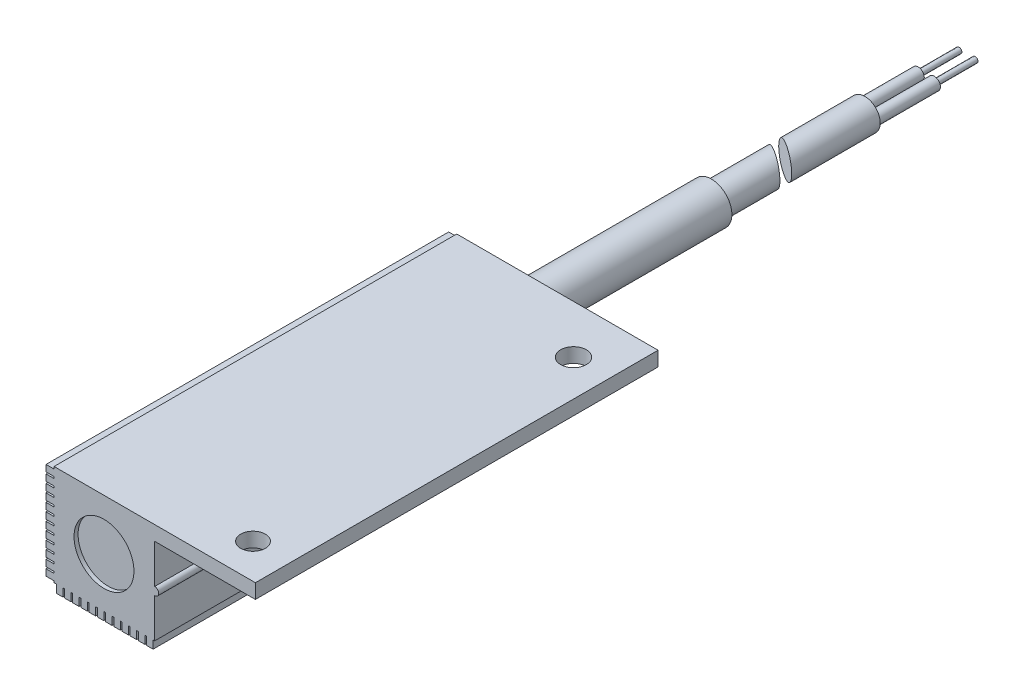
ISO-10303-21;
HEADER;
FILE_DESCRIPTION(('STEP AP214'),'2;1');
FILE_NAME('part.step','',(''),(''),'','','');
FILE_SCHEMA(('AUTOMOTIVE_DESIGN { 1 0 10303 214 1 1 1 1 }'));
ENDSEC;
DATA;
#1=APPLICATION_CONTEXT('core data for automotive mechanical design processes');
#2=APPLICATION_PROTOCOL_DEFINITION('international standard','automotive_design',2000,#1);
#3=PRODUCT_CONTEXT('',#1,'mechanical');
#4=PRODUCT('Part','Part','',(#3));
#5=PRODUCT_RELATED_PRODUCT_CATEGORY('part','',(#4));
#6=PRODUCT_DEFINITION_FORMATION('','',#4);
#7=PRODUCT_DEFINITION_CONTEXT('part definition',#1,'design');
#8=PRODUCT_DEFINITION('design','',#6,#7);
#9=PRODUCT_DEFINITION_SHAPE('','',#8);
#10=(LENGTH_UNIT() NAMED_UNIT(*) SI_UNIT(.MILLI.,.METRE.));
#11=(NAMED_UNIT(*) PLANE_ANGLE_UNIT() SI_UNIT($,.RADIAN.));
#12=(NAMED_UNIT(*) SI_UNIT($,.STERADIAN.) SOLID_ANGLE_UNIT());
#13=UNCERTAINTY_MEASURE_WITH_UNIT(LENGTH_MEASURE(1.E-05),#10,'distance_accuracy_value','');
#14=(GEOMETRIC_REPRESENTATION_CONTEXT(3) GLOBAL_UNCERTAINTY_ASSIGNED_CONTEXT((#13)) GLOBAL_UNIT_ASSIGNED_CONTEXT((#10,
#11,#12)) REPRESENTATION_CONTEXT('',''));
#15=CARTESIAN_POINT('',(0.,0.,0.));
#16=DIRECTION('',(0.,0.,1.));
#17=DIRECTION('',(1.,0.,0.));
#18=AXIS2_PLACEMENT_3D('',#15,#16,#17);
#19=CARTESIAN_POINT('',(-20.392,-6.25,-9.));
#20=DIRECTION('',(1.,0.,0.));
#21=DIRECTION('',(0.,0.,-1.));
#22=AXIS2_PLACEMENT_3D('',#19,#20,#21);
#23=PLANE('',#22);
#24=DIRECTION('',(0.,-1.,0.));
#25=VECTOR('',#24,1.);
#26=CARTESIAN_POINT('',(-20.392,-12.5,26.));
#27=LINE('',#26,#25);
#28=CARTESIAN_POINT('',(-20.392,-1.08,26.));
#29=VERTEX_POINT('',#28);
#30=CARTESIAN_POINT('',(-20.392,-1.3,26.));
#31=VERTEX_POINT('',#30);
#32=EDGE_CURVE('P0_E713',#29,#31,#27,.T.);
#33=ORIENTED_EDGE('',*,*,#32,.F.);
#34=DIRECTION('',(0.,0.,1.));
#35=VECTOR('',#34,1.);
#36=CARTESIAN_POINT('',(-20.392,-1.08,-25.4086996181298));
#37=LINE('',#36,#35);
#38=CARTESIAN_POINT('',(-20.392,-1.08,-24.));
#39=VERTEX_POINT('',#38);
#40=EDGE_CURVE('P0_E2597',#39,#29,#37,.T.);
#41=ORIENTED_EDGE('',*,*,#40,.F.);
#42=DIRECTION('',(0.,-1.,0.));
#43=VECTOR('',#42,1.);
#44=CARTESIAN_POINT('',(-20.392,-6.25,-24.));
#45=LINE('',#44,#43);
#46=CARTESIAN_POINT('',(-20.392,-1.3,-24.));
#47=VERTEX_POINT('',#46);
#48=EDGE_CURVE('P0_E44',#39,#47,#45,.T.);
#49=ORIENTED_EDGE('',*,*,#48,.T.);
#50=DIRECTION('',(0.,0.,1.));
#51=VECTOR('',#50,1.);
#52=CARTESIAN_POINT('',(-20.392,-1.3,-25.4086996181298));
#53=LINE('',#52,#51);
#54=EDGE_CURVE('P0_E2619',#47,#31,#53,.T.);
#55=ORIENTED_EDGE('',*,*,#54,.T.);
#56=EDGE_LOOP('',(#33,#41,#49,#55));
#57=FACE_BOUND('',#56,.T.);
#58=ADVANCED_FACE('P0_F40',(#57),#23,.F.);
#59=CARTESIAN_POINT('',(-20.392,-2.1,26.));
#60=VERTEX_POINT('',#59);
#61=CARTESIAN_POINT('',(-20.392,-2.32,26.));
#62=VERTEX_POINT('',#61);
#63=EDGE_CURVE('P0_E717',#60,#62,#27,.T.);
#64=ORIENTED_EDGE('',*,*,#63,.F.);
#65=DIRECTION('',(0.,0.,1.));
#66=VECTOR('',#65,1.);
#67=CARTESIAN_POINT('',(-20.392,-2.1,-25.4086996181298));
#68=LINE('',#67,#66);
#69=CARTESIAN_POINT('',(-20.392,-2.1,-24.));
#70=VERTEX_POINT('',#69);
#71=EDGE_CURVE('P0_E2611',#70,#60,#68,.T.);
#72=ORIENTED_EDGE('',*,*,#71,.F.);
#73=CARTESIAN_POINT('',(-20.392,-2.32,-24.));
#74=VERTEX_POINT('',#73);
#75=EDGE_CURVE('P0_E774',#70,#74,#45,.T.);
#76=ORIENTED_EDGE('',*,*,#75,.T.);
#77=DIRECTION('',(0.,0.,1.));
#78=VECTOR('',#77,1.);
#79=CARTESIAN_POINT('',(-20.392,-2.32,-25.4086996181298));
#80=LINE('',#79,#78);
#81=EDGE_CURVE('P0_E2640',#74,#62,#80,.T.);
#82=ORIENTED_EDGE('',*,*,#81,.T.);
#83=EDGE_LOOP('',(#64,#72,#76,#82));
#84=FACE_BOUND('',#83,.T.);
#85=ADVANCED_FACE('P0_F1537',(#84),#23,.F.);
#86=CARTESIAN_POINT('',(-20.392,-3.12,26.));
#87=VERTEX_POINT('',#86);
#88=CARTESIAN_POINT('',(-20.392,-3.34,26.));
#89=VERTEX_POINT('',#88);
#90=EDGE_CURVE('P0_E769',#87,#89,#27,.T.);
#91=ORIENTED_EDGE('',*,*,#90,.F.);
#92=DIRECTION('',(0.,0.,1.));
#93=VECTOR('',#92,1.);
#94=CARTESIAN_POINT('',(-20.392,-3.12,-25.4086996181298));
#95=LINE('',#94,#93);
#96=CARTESIAN_POINT('',(-20.392,-3.12,-24.));
#97=VERTEX_POINT('',#96);
#98=EDGE_CURVE('P0_E2633',#97,#87,#95,.T.);
#99=ORIENTED_EDGE('',*,*,#98,.F.);
#100=CARTESIAN_POINT('',(-20.392,-3.34,-24.));
#101=VERTEX_POINT('',#100);
#102=EDGE_CURVE('P0_E773',#97,#101,#45,.T.);
#103=ORIENTED_EDGE('',*,*,#102,.T.);
#104=DIRECTION('',(0.,0.,1.));
#105=VECTOR('',#104,1.);
#106=CARTESIAN_POINT('',(-20.392,-3.34,-25.4086996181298));
#107=LINE('',#106,#105);
#108=EDGE_CURVE('P0_E965',#101,#89,#107,.T.);
#109=ORIENTED_EDGE('',*,*,#108,.T.);
#110=EDGE_LOOP('',(#91,#99,#103,#109));
#111=FACE_BOUND('',#110,.T.);
#112=ADVANCED_FACE('P0_F972',(#111),#23,.F.);
#113=CARTESIAN_POINT('',(-20.392,-4.14,26.));
#114=VERTEX_POINT('',#113);
#115=CARTESIAN_POINT('',(-20.392,-4.36,26.));
#116=VERTEX_POINT('',#115);
#117=EDGE_CURVE('P0_E766',#114,#116,#27,.T.);
#118=ORIENTED_EDGE('',*,*,#117,.F.);
#119=DIRECTION('',(0.,0.,1.));
#120=VECTOR('',#119,1.);
#121=CARTESIAN_POINT('',(-20.392,-4.14,-25.4086996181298));
#122=LINE('',#121,#120);
#123=CARTESIAN_POINT('',(-20.392,-4.14,-24.));
#124=VERTEX_POINT('',#123);
#125=EDGE_CURVE('P0_E2652',#124,#114,#122,.T.);
#126=ORIENTED_EDGE('',*,*,#125,.F.);
#127=CARTESIAN_POINT('',(-20.392,-4.36,-24.));
#128=VERTEX_POINT('',#127);
#129=EDGE_CURVE('P0_E802',#124,#128,#45,.T.);
#130=ORIENTED_EDGE('',*,*,#129,.T.);
#131=DIRECTION('',(0.,0.,1.));
#132=VECTOR('',#131,1.);
#133=CARTESIAN_POINT('',(-20.392,-4.36,-25.4086996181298));
#134=LINE('',#133,#132);
#135=EDGE_CURVE('P0_E998',#128,#116,#134,.T.);
#136=ORIENTED_EDGE('',*,*,#135,.T.);
#137=EDGE_LOOP('',(#118,#126,#130,#136));
#138=FACE_BOUND('',#137,.T.);
#139=ADVANCED_FACE('P0_F2659',(#138),#23,.F.);
#140=CARTESIAN_POINT('',(-20.392,-5.16,26.));
#141=VERTEX_POINT('',#140);
#142=CARTESIAN_POINT('',(-20.392,-5.38,26.));
#143=VERTEX_POINT('',#142);
#144=EDGE_CURVE('P0_E762',#141,#143,#27,.T.);
#145=ORIENTED_EDGE('',*,*,#144,.F.);
#146=DIRECTION('',(0.,0.,1.));
#147=VECTOR('',#146,1.);
#148=CARTESIAN_POINT('',(-20.392,-5.16,-25.4086996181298));
#149=LINE('',#148,#147);
#150=CARTESIAN_POINT('',(-20.392,-5.16,-24.));
#151=VERTEX_POINT('',#150);
#152=EDGE_CURVE('P0_E989',#151,#141,#149,.T.);
#153=ORIENTED_EDGE('',*,*,#152,.F.);
#154=CARTESIAN_POINT('',(-20.392,-5.38,-24.));
#155=VERTEX_POINT('',#154);
#156=EDGE_CURVE('P0_E800',#151,#155,#45,.T.);
#157=ORIENTED_EDGE('',*,*,#156,.T.);
#158=DIRECTION('',(0.,0.,1.));
#159=VECTOR('',#158,1.);
#160=CARTESIAN_POINT('',(-20.392,-5.38,-25.4086996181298));
#161=LINE('',#160,#159);
#162=EDGE_CURVE('P0_E1020',#155,#143,#161,.T.);
#163=ORIENTED_EDGE('',*,*,#162,.T.);
#164=EDGE_LOOP('',(#145,#153,#157,#163));
#165=FACE_BOUND('',#164,.T.);
#166=ADVANCED_FACE('P0_F2666',(#165),#23,.F.);
#167=CARTESIAN_POINT('',(-20.392,-6.18,26.));
#168=VERTEX_POINT('',#167);
#169=CARTESIAN_POINT('',(-20.392,-6.4,26.));
#170=VERTEX_POINT('',#169);
#171=EDGE_CURVE('P0_E758',#168,#170,#27,.T.);
#172=ORIENTED_EDGE('',*,*,#171,.F.);
#173=DIRECTION('',(0.,0.,1.));
#174=VECTOR('',#173,1.);
#175=CARTESIAN_POINT('',(-20.392,-6.18,-25.4086996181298));
#176=LINE('',#175,#174);
#177=CARTESIAN_POINT('',(-20.392,-6.18,-24.));
#178=VERTEX_POINT('',#177);
#179=EDGE_CURVE('P0_E1011',#178,#168,#176,.T.);
#180=ORIENTED_EDGE('',*,*,#179,.F.);
#181=CARTESIAN_POINT('',(-20.392,-6.4,-24.));
#182=VERTEX_POINT('',#181);
#183=EDGE_CURVE('P0_E798',#178,#182,#45,.T.);
#184=ORIENTED_EDGE('',*,*,#183,.T.);
#185=DIRECTION('',(0.,0.,1.));
#186=VECTOR('',#185,1.);
#187=CARTESIAN_POINT('',(-20.392,-6.4,-25.4086996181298));
#188=LINE('',#187,#186);
#189=EDGE_CURVE('P0_E1042',#182,#170,#188,.T.);
#190=ORIENTED_EDGE('',*,*,#189,.T.);
#191=EDGE_LOOP('',(#172,#180,#184,#190));
#192=FACE_BOUND('',#191,.T.);
#193=ADVANCED_FACE('P0_F2673',(#192),#23,.F.);
#194=CARTESIAN_POINT('',(-20.392,-7.2,26.));
#195=VERTEX_POINT('',#194);
#196=CARTESIAN_POINT('',(-20.392,-7.42,26.));
#197=VERTEX_POINT('',#196);
#198=EDGE_CURVE('P0_E754',#195,#197,#27,.T.);
#199=ORIENTED_EDGE('',*,*,#198,.F.);
#200=DIRECTION('',(0.,0.,1.));
#201=VECTOR('',#200,1.);
#202=CARTESIAN_POINT('',(-20.392,-7.2,-25.4086996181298));
#203=LINE('',#202,#201);
#204=CARTESIAN_POINT('',(-20.392,-7.2,-24.));
#205=VERTEX_POINT('',#204);
#206=EDGE_CURVE('P0_E1033',#205,#195,#203,.T.);
#207=ORIENTED_EDGE('',*,*,#206,.F.);
#208=CARTESIAN_POINT('',(-20.392,-7.42,-24.));
#209=VERTEX_POINT('',#208);
#210=EDGE_CURVE('P0_E796',#205,#209,#45,.T.);
#211=ORIENTED_EDGE('',*,*,#210,.T.);
#212=DIRECTION('',(0.,0.,1.));
#213=VECTOR('',#212,1.);
#214=CARTESIAN_POINT('',(-20.392,-7.42,-25.4086996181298));
#215=LINE('',#214,#213);
#216=EDGE_CURVE('P0_E1064',#209,#197,#215,.T.);
#217=ORIENTED_EDGE('',*,*,#216,.T.);
#218=EDGE_LOOP('',(#199,#207,#211,#217));
#219=FACE_BOUND('',#218,.T.);
#220=ADVANCED_FACE('P0_F2680',(#219),#23,.F.);
#221=CARTESIAN_POINT('',(-20.392,-8.22,26.));
#222=VERTEX_POINT('',#221);
#223=CARTESIAN_POINT('',(-20.392,-8.44,26.));
#224=VERTEX_POINT('',#223);
#225=EDGE_CURVE('P0_E750',#222,#224,#27,.T.);
#226=ORIENTED_EDGE('',*,*,#225,.F.);
#227=DIRECTION('',(0.,0.,1.));
#228=VECTOR('',#227,1.);
#229=CARTESIAN_POINT('',(-20.392,-8.22,-25.4086996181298));
#230=LINE('',#229,#228);
#231=CARTESIAN_POINT('',(-20.392,-8.22,-24.));
#232=VERTEX_POINT('',#231);
#233=EDGE_CURVE('P0_E1055',#232,#222,#230,.T.);
#234=ORIENTED_EDGE('',*,*,#233,.F.);
#235=CARTESIAN_POINT('',(-20.392,-8.44,-24.));
#236=VERTEX_POINT('',#235);
#237=EDGE_CURVE('P0_E794',#232,#236,#45,.T.);
#238=ORIENTED_EDGE('',*,*,#237,.T.);
#239=DIRECTION('',(0.,0.,1.));
#240=VECTOR('',#239,1.);
#241=CARTESIAN_POINT('',(-20.392,-8.44,-25.4086996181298));
#242=LINE('',#241,#240);
#243=EDGE_CURVE('P0_E1086',#236,#224,#242,.T.);
#244=ORIENTED_EDGE('',*,*,#243,.T.);
#245=EDGE_LOOP('',(#226,#234,#238,#244));
#246=FACE_BOUND('',#245,.T.);
#247=ADVANCED_FACE('P0_F2687',(#246),#23,.F.);
#248=CARTESIAN_POINT('',(-20.392,-9.24,26.));
#249=VERTEX_POINT('',#248);
#250=CARTESIAN_POINT('',(-20.392,-9.46,26.));
#251=VERTEX_POINT('',#250);
#252=EDGE_CURVE('P0_E746',#249,#251,#27,.T.);
#253=ORIENTED_EDGE('',*,*,#252,.F.);
#254=DIRECTION('',(0.,0.,1.));
#255=VECTOR('',#254,1.);
#256=CARTESIAN_POINT('',(-20.392,-9.24,-25.4086996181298));
#257=LINE('',#256,#255);
#258=CARTESIAN_POINT('',(-20.392,-9.24,-24.));
#259=VERTEX_POINT('',#258);
#260=EDGE_CURVE('P0_E1077',#259,#249,#257,.T.);
#261=ORIENTED_EDGE('',*,*,#260,.F.);
#262=CARTESIAN_POINT('',(-20.392,-9.46,-24.));
#263=VERTEX_POINT('',#262);
#264=EDGE_CURVE('P0_E792',#259,#263,#45,.T.);
#265=ORIENTED_EDGE('',*,*,#264,.T.);
#266=DIRECTION('',(0.,0.,1.));
#267=VECTOR('',#266,1.);
#268=CARTESIAN_POINT('',(-20.392,-9.46,-25.4086996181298));
#269=LINE('',#268,#267);
#270=EDGE_CURVE('P0_E1108',#263,#251,#269,.T.);
#271=ORIENTED_EDGE('',*,*,#270,.T.);
#272=EDGE_LOOP('',(#253,#261,#265,#271));
#273=FACE_BOUND('',#272,.T.);
#274=ADVANCED_FACE('P0_F1570',(#273),#23,.F.);
#275=CARTESIAN_POINT('',(-20.392,-10.26,26.));
#276=VERTEX_POINT('',#275);
#277=CARTESIAN_POINT('',(-20.392,-10.48,26.));
#278=VERTEX_POINT('',#277);
#279=EDGE_CURVE('P0_E742',#276,#278,#27,.T.);
#280=ORIENTED_EDGE('',*,*,#279,.F.);
#281=DIRECTION('',(0.,0.,1.));
#282=VECTOR('',#281,1.);
#283=CARTESIAN_POINT('',(-20.392,-10.26,-25.4086996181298));
#284=LINE('',#283,#282);
#285=CARTESIAN_POINT('',(-20.392,-10.26,-24.));
#286=VERTEX_POINT('',#285);
#287=EDGE_CURVE('P0_E1099',#286,#276,#284,.T.);
#288=ORIENTED_EDGE('',*,*,#287,.F.);
#289=CARTESIAN_POINT('',(-20.392,-10.48,-24.));
#290=VERTEX_POINT('',#289);
#291=EDGE_CURVE('P0_E790',#286,#290,#45,.T.);
#292=ORIENTED_EDGE('',*,*,#291,.T.);
#293=DIRECTION('',(0.,0.,1.));
#294=VECTOR('',#293,1.);
#295=CARTESIAN_POINT('',(-20.392,-10.48,-25.4086996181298));
#296=LINE('',#295,#294);
#297=EDGE_CURVE('P0_E1130',#290,#278,#296,.T.);
#298=ORIENTED_EDGE('',*,*,#297,.T.);
#299=EDGE_LOOP('',(#280,#288,#292,#298));
#300=FACE_BOUND('',#299,.T.);
#301=ADVANCED_FACE('P0_F1563',(#300),#23,.F.);
#302=CARTESIAN_POINT('',(-20.392,-11.28,26.));
#303=VERTEX_POINT('',#302);
#304=CARTESIAN_POINT('',(-20.392,-11.5,26.));
#305=VERTEX_POINT('',#304);
#306=EDGE_CURVE('P0_E737',#303,#305,#27,.T.);
#307=ORIENTED_EDGE('',*,*,#306,.F.);
#308=DIRECTION('',(0.,0.,1.));
#309=VECTOR('',#308,1.);
#310=CARTESIAN_POINT('',(-20.392,-11.28,-25.4086996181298));
#311=LINE('',#310,#309);
#312=CARTESIAN_POINT('',(-20.392,-11.28,-24.));
#313=VERTEX_POINT('',#312);
#314=EDGE_CURVE('P0_E1121',#313,#303,#311,.T.);
#315=ORIENTED_EDGE('',*,*,#314,.F.);
#316=CARTESIAN_POINT('',(-20.392,-11.5,-24.));
#317=VERTEX_POINT('',#316);
#318=EDGE_CURVE('P0_E788',#313,#317,#45,.T.);
#319=ORIENTED_EDGE('',*,*,#318,.T.);
#320=DIRECTION('',(0.,0.,1.));
#321=VECTOR('',#320,1.);
#322=CARTESIAN_POINT('',(-20.392,-11.5,-25.4086996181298));
#323=LINE('',#322,#321);
#324=EDGE_CURVE('P0_E1441',#317,#305,#323,.T.);
#325=ORIENTED_EDGE('',*,*,#324,.T.);
#326=EDGE_LOOP('',(#307,#315,#319,#325));
#327=FACE_BOUND('',#326,.T.);
#328=ADVANCED_FACE('P0_F1554',(#327),#23,.F.);
#329=CARTESIAN_POINT('',(-7.892,-8.05,-9.));
#330=DIRECTION('',(1.,0.,0.));
#331=DIRECTION('',(0.,0.,-1.));
#332=AXIS2_PLACEMENT_3D('',#329,#330,#331);
#333=PLANE('',#332);
#334=DIRECTION('',(0.,0.,1.));
#335=VECTOR('',#334,1.);
#336=CARTESIAN_POINT('',(-7.892,-6.65194947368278,-25.4086996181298));
#337=LINE('',#336,#335);
#338=CARTESIAN_POINT('',(-7.892,-6.65194947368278,-24.));
#339=VERTEX_POINT('',#338);
#340=CARTESIAN_POINT('',(-7.892,-6.65194947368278,26.));
#341=VERTEX_POINT('',#340);
#342=EDGE_CURVE('P0_E1148',#339,#341,#337,.T.);
#343=ORIENTED_EDGE('',*,*,#342,.F.);
#344=DIRECTION('',(0.,-1.,0.));
#345=VECTOR('',#344,1.);
#346=CARTESIAN_POINT('',(-7.892,-6.25,-24.));
#347=LINE('',#346,#345);
#348=CARTESIAN_POINT('',(-7.892,-1.8,-24.));
#349=VERTEX_POINT('',#348);
#350=EDGE_CURVE('P0_E898',#339,#349,#347,.F.);
#351=ORIENTED_EDGE('',*,*,#350,.T.);
#352=DIRECTION('',(0.,0.,-1.));
#353=VECTOR('',#352,1.);
#354=CARTESIAN_POINT('',(-7.892,-1.8,-9.));
#355=LINE('',#354,#353);
#356=CARTESIAN_POINT('',(-7.892,-1.8,26.));
#357=VERTEX_POINT('',#356);
#358=EDGE_CURVE('P0_E861',#349,#357,#355,.F.);
#359=ORIENTED_EDGE('',*,*,#358,.T.);
#360=DIRECTION('',(0.,1.,0.));
#361=VECTOR('',#360,1.);
#362=CARTESIAN_POINT('',(-7.892,-1.8,26.));
#363=LINE('',#362,#361);
#364=EDGE_CURVE('P0_E892',#341,#357,#363,.T.);
#365=ORIENTED_EDGE('',*,*,#364,.F.);
#366=EDGE_LOOP('',(#343,#351,#359,#365));
#367=FACE_BOUND('',#366,.T.);
#368=ADVANCED_FACE('P0_F1509',(#367),#333,.T.);
#369=CARTESIAN_POINT('',(-7.892,-12.5,-9.));
#370=DIRECTION('',(0.,1.,0.));
#371=DIRECTION('',(0.,0.,1.));
#372=AXIS2_PLACEMENT_3D('',#369,#370,#371);
#373=PLANE('',#372);
#374=DIRECTION('',(1.,0.,0.));
#375=VECTOR('',#374,1.);
#376=CARTESIAN_POINT('',(-7.892,-12.5,26.));
#377=LINE('',#376,#375);
#378=CARTESIAN_POINT('',(-19.312,-12.5,26.));
#379=VERTEX_POINT('',#378);
#380=CARTESIAN_POINT('',(-19.092,-12.5,26.));
#381=VERTEX_POINT('',#380);
#382=EDGE_CURVE('P0_E893',#379,#381,#377,.T.);
#383=ORIENTED_EDGE('',*,*,#382,.F.);
#384=DIRECTION('',(0.,0.,1.));
#385=VECTOR('',#384,1.);
#386=CARTESIAN_POINT('',(-19.312,-12.5,-25.4086996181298));
#387=LINE('',#386,#385);
#388=CARTESIAN_POINT('',(-19.312,-12.5,-24.));
#389=VERTEX_POINT('',#388);
#390=EDGE_CURVE('P0_E1167',#389,#379,#387,.T.);
#391=ORIENTED_EDGE('',*,*,#390,.F.);
#392=DIRECTION('',(1.,0.,0.));
#393=VECTOR('',#392,1.);
#394=CARTESIAN_POINT('',(-7.892,-12.5,-24.));
#395=LINE('',#394,#393);
#396=CARTESIAN_POINT('',(-19.092,-12.5,-24.));
#397=VERTEX_POINT('',#396);
#398=EDGE_CURVE('P0_E899',#389,#397,#395,.T.);
#399=ORIENTED_EDGE('',*,*,#398,.T.);
#400=DIRECTION('',(0.,0.,1.));
#401=VECTOR('',#400,1.);
#402=CARTESIAN_POINT('',(-19.092,-12.5,-25.4086996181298));
#403=LINE('',#402,#401);
#404=EDGE_CURVE('P0_E1196',#397,#381,#403,.T.);
#405=ORIENTED_EDGE('',*,*,#404,.T.);
#406=EDGE_LOOP('',(#383,#391,#399,#405));
#407=FACE_BOUND('',#406,.T.);
#408=ADVANCED_FACE('P0_F1568',(#407),#373,.F.);
#409=CARTESIAN_POINT('',(-18.292,-12.5,26.));
#410=VERTEX_POINT('',#409);
#411=CARTESIAN_POINT('',(-18.072,-12.5,26.));
#412=VERTEX_POINT('',#411);
#413=EDGE_CURVE('P0_E1605',#410,#412,#377,.T.);
#414=ORIENTED_EDGE('',*,*,#413,.F.);
#415=DIRECTION('',(0.,0.,1.));
#416=VECTOR('',#415,1.);
#417=CARTESIAN_POINT('',(-18.292,-12.5,-25.4086996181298));
#418=LINE('',#417,#416);
#419=CARTESIAN_POINT('',(-18.292,-12.5,-24.));
#420=VERTEX_POINT('',#419);
#421=EDGE_CURVE('P0_E1192',#420,#410,#418,.T.);
#422=ORIENTED_EDGE('',*,*,#421,.F.);
#423=CARTESIAN_POINT('',(-18.072,-12.5,-24.));
#424=VERTEX_POINT('',#423);
#425=EDGE_CURVE('P0_E1613',#420,#424,#395,.T.);
#426=ORIENTED_EDGE('',*,*,#425,.T.);
#427=DIRECTION('',(0.,0.,1.));
#428=VECTOR('',#427,1.);
#429=CARTESIAN_POINT('',(-18.072,-12.5,-25.4086996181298));
#430=LINE('',#429,#428);
#431=EDGE_CURVE('P0_E1221',#424,#412,#430,.T.);
#432=ORIENTED_EDGE('',*,*,#431,.T.);
#433=EDGE_LOOP('',(#414,#422,#426,#432));
#434=FACE_BOUND('',#433,.T.);
#435=ADVANCED_FACE('P0_F1626',(#434),#373,.F.);
#436=CARTESIAN_POINT('',(-17.272,-12.5,26.));
#437=VERTEX_POINT('',#436);
#438=CARTESIAN_POINT('',(-17.052,-12.5,26.));
#439=VERTEX_POINT('',#438);
#440=EDGE_CURVE('P0_E1628',#437,#439,#377,.T.);
#441=ORIENTED_EDGE('',*,*,#440,.F.);
#442=DIRECTION('',(0.,0.,1.));
#443=VECTOR('',#442,1.);
#444=CARTESIAN_POINT('',(-17.272,-12.5,-25.4086996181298));
#445=LINE('',#444,#443);
#446=CARTESIAN_POINT('',(-17.272,-12.5,-24.));
#447=VERTEX_POINT('',#446);
#448=EDGE_CURVE('P0_E1217',#447,#437,#445,.T.);
#449=ORIENTED_EDGE('',*,*,#448,.F.);
#450=CARTESIAN_POINT('',(-17.052,-12.5,-24.));
#451=VERTEX_POINT('',#450);
#452=EDGE_CURVE('P0_E1634',#447,#451,#395,.T.);
#453=ORIENTED_EDGE('',*,*,#452,.T.);
#454=DIRECTION('',(0.,0.,1.));
#455=VECTOR('',#454,1.);
#456=CARTESIAN_POINT('',(-17.052,-12.5,-25.4086996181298));
#457=LINE('',#456,#455);
#458=EDGE_CURVE('P0_E1246',#451,#439,#457,.T.);
#459=ORIENTED_EDGE('',*,*,#458,.T.);
#460=EDGE_LOOP('',(#441,#449,#453,#459));
#461=FACE_BOUND('',#460,.T.);
#462=ADVANCED_FACE('P0_F1763',(#461),#373,.F.);
#463=CARTESIAN_POINT('',(-16.252,-12.5,26.));
#464=VERTEX_POINT('',#463);
#465=CARTESIAN_POINT('',(-16.032,-12.5,26.));
#466=VERTEX_POINT('',#465);
#467=EDGE_CURVE('P0_E1630',#464,#466,#377,.T.);
#468=ORIENTED_EDGE('',*,*,#467,.F.);
#469=DIRECTION('',(0.,0.,1.));
#470=VECTOR('',#469,1.);
#471=CARTESIAN_POINT('',(-16.252,-12.5,-25.4086996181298));
#472=LINE('',#471,#470);
#473=CARTESIAN_POINT('',(-16.252,-12.5,-24.));
#474=VERTEX_POINT('',#473);
#475=EDGE_CURVE('P0_E1242',#474,#464,#472,.T.);
#476=ORIENTED_EDGE('',*,*,#475,.F.);
#477=CARTESIAN_POINT('',(-16.032,-12.5,-24.));
#478=VERTEX_POINT('',#477);
#479=EDGE_CURVE('P0_E1635',#474,#478,#395,.T.);
#480=ORIENTED_EDGE('',*,*,#479,.T.);
#481=DIRECTION('',(0.,0.,1.));
#482=VECTOR('',#481,1.);
#483=CARTESIAN_POINT('',(-16.032,-12.5,-25.4086996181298));
#484=LINE('',#483,#482);
#485=EDGE_CURVE('P0_E1271',#478,#466,#484,.T.);
#486=ORIENTED_EDGE('',*,*,#485,.T.);
#487=EDGE_LOOP('',(#468,#476,#480,#486));
#488=FACE_BOUND('',#487,.T.);
#489=ADVANCED_FACE('P0_F1769',(#488),#373,.F.);
#490=CARTESIAN_POINT('',(-15.232,-12.5,26.));
#491=VERTEX_POINT('',#490);
#492=CARTESIAN_POINT('',(-15.012,-12.5,26.));
#493=VERTEX_POINT('',#492);
#494=EDGE_CURVE('P0_E1647',#491,#493,#377,.T.);
#495=ORIENTED_EDGE('',*,*,#494,.F.);
#496=DIRECTION('',(0.,0.,1.));
#497=VECTOR('',#496,1.);
#498=CARTESIAN_POINT('',(-15.232,-12.5,-25.4086996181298));
#499=LINE('',#498,#497);
#500=CARTESIAN_POINT('',(-15.232,-12.5,-24.));
#501=VERTEX_POINT('',#500);
#502=EDGE_CURVE('P0_E1267',#501,#491,#499,.T.);
#503=ORIENTED_EDGE('',*,*,#502,.F.);
#504=CARTESIAN_POINT('',(-15.012,-12.5,-24.));
#505=VERTEX_POINT('',#504);
#506=EDGE_CURVE('P0_E1639',#501,#505,#395,.T.);
#507=ORIENTED_EDGE('',*,*,#506,.T.);
#508=DIRECTION('',(0.,0.,1.));
#509=VECTOR('',#508,1.);
#510=CARTESIAN_POINT('',(-15.012,-12.5,-25.4086996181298));
#511=LINE('',#510,#509);
#512=EDGE_CURVE('P0_E1296',#505,#493,#511,.T.);
#513=ORIENTED_EDGE('',*,*,#512,.T.);
#514=EDGE_LOOP('',(#495,#503,#507,#513));
#515=FACE_BOUND('',#514,.T.);
#516=ADVANCED_FACE('P0_F1775',(#515),#373,.F.);
#517=CARTESIAN_POINT('',(-14.212,-12.5,26.));
#518=VERTEX_POINT('',#517);
#519=CARTESIAN_POINT('',(-13.992,-12.5,26.));
#520=VERTEX_POINT('',#519);
#521=EDGE_CURVE('P0_E1650',#518,#520,#377,.T.);
#522=ORIENTED_EDGE('',*,*,#521,.F.);
#523=DIRECTION('',(0.,0.,1.));
#524=VECTOR('',#523,1.);
#525=CARTESIAN_POINT('',(-14.212,-12.5,-25.4086996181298));
#526=LINE('',#525,#524);
#527=CARTESIAN_POINT('',(-14.212,-12.5,-24.));
#528=VERTEX_POINT('',#527);
#529=EDGE_CURVE('P0_E1292',#528,#518,#526,.T.);
#530=ORIENTED_EDGE('',*,*,#529,.F.);
#531=CARTESIAN_POINT('',(-13.992,-12.5,-24.));
#532=VERTEX_POINT('',#531);
#533=EDGE_CURVE('P0_E1644',#528,#532,#395,.T.);
#534=ORIENTED_EDGE('',*,*,#533,.T.);
#535=DIRECTION('',(0.,0.,1.));
#536=VECTOR('',#535,1.);
#537=CARTESIAN_POINT('',(-13.992,-12.5,-25.4086996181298));
#538=LINE('',#537,#536);
#539=EDGE_CURVE('P0_E1321',#532,#520,#538,.T.);
#540=ORIENTED_EDGE('',*,*,#539,.T.);
#541=EDGE_LOOP('',(#522,#530,#534,#540));
#542=FACE_BOUND('',#541,.T.);
#543=ADVANCED_FACE('P0_F1781',(#542),#373,.F.);
#544=CARTESIAN_POINT('',(-13.192,-12.5,26.));
#545=VERTEX_POINT('',#544);
#546=CARTESIAN_POINT('',(-12.972,-12.5,26.));
#547=VERTEX_POINT('',#546);
#548=EDGE_CURVE('P0_E1654',#545,#547,#377,.T.);
#549=ORIENTED_EDGE('',*,*,#548,.F.);
#550=DIRECTION('',(0.,0.,1.));
#551=VECTOR('',#550,1.);
#552=CARTESIAN_POINT('',(-13.192,-12.5,-25.4086996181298));
#553=LINE('',#552,#551);
#554=CARTESIAN_POINT('',(-13.192,-12.5,-24.));
#555=VERTEX_POINT('',#554);
#556=EDGE_CURVE('P0_E1317',#555,#545,#553,.T.);
#557=ORIENTED_EDGE('',*,*,#556,.F.);
#558=CARTESIAN_POINT('',(-12.972,-12.5,-24.));
#559=VERTEX_POINT('',#558);
#560=EDGE_CURVE('P0_E1652',#555,#559,#395,.T.);
#561=ORIENTED_EDGE('',*,*,#560,.T.);
#562=DIRECTION('',(0.,0.,1.));
#563=VECTOR('',#562,1.);
#564=CARTESIAN_POINT('',(-12.972,-12.5,-25.4086996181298));
#565=LINE('',#564,#563);
#566=EDGE_CURVE('P0_E1346',#559,#547,#565,.T.);
#567=ORIENTED_EDGE('',*,*,#566,.T.);
#568=EDGE_LOOP('',(#549,#557,#561,#567));
#569=FACE_BOUND('',#568,.T.);
#570=ADVANCED_FACE('P0_F1788',(#569),#373,.F.);
#571=CARTESIAN_POINT('',(-12.172,-12.5,26.));
#572=VERTEX_POINT('',#571);
#573=CARTESIAN_POINT('',(-11.952,-12.5,26.));
#574=VERTEX_POINT('',#573);
#575=EDGE_CURVE('P0_E1658',#572,#574,#377,.T.);
#576=ORIENTED_EDGE('',*,*,#575,.F.);
#577=DIRECTION('',(0.,0.,1.));
#578=VECTOR('',#577,1.);
#579=CARTESIAN_POINT('',(-12.172,-12.5,-25.4086996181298));
#580=LINE('',#579,#578);
#581=CARTESIAN_POINT('',(-12.172,-12.5,-24.));
#582=VERTEX_POINT('',#581);
#583=EDGE_CURVE('P0_E1342',#582,#572,#580,.T.);
#584=ORIENTED_EDGE('',*,*,#583,.F.);
#585=CARTESIAN_POINT('',(-11.952,-12.5,-24.));
#586=VERTEX_POINT('',#585);
#587=EDGE_CURVE('P0_E1656',#582,#586,#395,.T.);
#588=ORIENTED_EDGE('',*,*,#587,.T.);
#589=DIRECTION('',(0.,0.,1.));
#590=VECTOR('',#589,1.);
#591=CARTESIAN_POINT('',(-11.952,-12.5,-25.4086996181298));
#592=LINE('',#591,#590);
#593=EDGE_CURVE('P0_E1371',#586,#574,#592,.T.);
#594=ORIENTED_EDGE('',*,*,#593,.T.);
#595=EDGE_LOOP('',(#576,#584,#588,#594));
#596=FACE_BOUND('',#595,.T.);
#597=ADVANCED_FACE('P0_F1795',(#596),#373,.F.);
#598=CARTESIAN_POINT('',(-11.152,-12.5,26.));
#599=VERTEX_POINT('',#598);
#600=CARTESIAN_POINT('',(-10.932,-12.5,26.));
#601=VERTEX_POINT('',#600);
#602=EDGE_CURVE('P0_E1662',#599,#601,#377,.T.);
#603=ORIENTED_EDGE('',*,*,#602,.F.);
#604=DIRECTION('',(0.,0.,1.));
#605=VECTOR('',#604,1.);
#606=CARTESIAN_POINT('',(-11.152,-12.5,-25.4086996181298));
#607=LINE('',#606,#605);
#608=CARTESIAN_POINT('',(-11.152,-12.5,-24.));
#609=VERTEX_POINT('',#608);
#610=EDGE_CURVE('P0_E1367',#609,#599,#607,.T.);
#611=ORIENTED_EDGE('',*,*,#610,.F.);
#612=CARTESIAN_POINT('',(-10.932,-12.5,-24.));
#613=VERTEX_POINT('',#612);
#614=EDGE_CURVE('P0_E1660',#609,#613,#395,.T.);
#615=ORIENTED_EDGE('',*,*,#614,.T.);
#616=DIRECTION('',(0.,0.,1.));
#617=VECTOR('',#616,1.);
#618=CARTESIAN_POINT('',(-10.932,-12.5,-25.4086996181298));
#619=LINE('',#618,#617);
#620=EDGE_CURVE('P0_E1396',#613,#601,#619,.T.);
#621=ORIENTED_EDGE('',*,*,#620,.T.);
#622=EDGE_LOOP('',(#603,#611,#615,#621));
#623=FACE_BOUND('',#622,.T.);
#624=ADVANCED_FACE('P0_F1802',(#623),#373,.F.);
#625=CARTESIAN_POINT('',(-10.132,-12.5,26.));
#626=VERTEX_POINT('',#625);
#627=CARTESIAN_POINT('',(-9.912,-12.5,26.));
#628=VERTEX_POINT('',#627);
#629=EDGE_CURVE('P0_E1666',#626,#628,#377,.T.);
#630=ORIENTED_EDGE('',*,*,#629,.F.);
#631=DIRECTION('',(0.,0.,1.));
#632=VECTOR('',#631,1.);
#633=CARTESIAN_POINT('',(-10.132,-12.5,-25.4086996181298));
#634=LINE('',#633,#632);
#635=CARTESIAN_POINT('',(-10.132,-12.5,-24.));
#636=VERTEX_POINT('',#635);
#637=EDGE_CURVE('P0_E1392',#636,#626,#634,.T.);
#638=ORIENTED_EDGE('',*,*,#637,.F.);
#639=CARTESIAN_POINT('',(-9.912,-12.5,-24.));
#640=VERTEX_POINT('',#639);
#641=EDGE_CURVE('P0_E1664',#636,#640,#395,.T.);
#642=ORIENTED_EDGE('',*,*,#641,.T.);
#643=DIRECTION('',(0.,0.,1.));
#644=VECTOR('',#643,1.);
#645=CARTESIAN_POINT('',(-9.912,-12.5,-25.4086996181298));
#646=LINE('',#645,#644);
#647=EDGE_CURVE('P0_E1421',#640,#628,#646,.T.);
#648=ORIENTED_EDGE('',*,*,#647,.T.);
#649=EDGE_LOOP('',(#630,#638,#642,#648));
#650=FACE_BOUND('',#649,.T.);
#651=ADVANCED_FACE('P0_F1561',(#650),#373,.F.);
#652=CARTESIAN_POINT('',(-9.112,-12.5,26.));
#653=VERTEX_POINT('',#652);
#654=CARTESIAN_POINT('',(-8.892,-12.5,26.));
#655=VERTEX_POINT('',#654);
#656=EDGE_CURVE('P0_E715',#653,#655,#377,.T.);
#657=ORIENTED_EDGE('',*,*,#656,.F.);
#658=DIRECTION('',(0.,0.,1.));
#659=VECTOR('',#658,1.);
#660=CARTESIAN_POINT('',(-9.112,-12.5,-25.4086996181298));
#661=LINE('',#660,#659);
#662=CARTESIAN_POINT('',(-9.112,-12.5,-24.));
#663=VERTEX_POINT('',#662);
#664=EDGE_CURVE('P0_E1417',#663,#653,#661,.T.);
#665=ORIENTED_EDGE('',*,*,#664,.F.);
#666=CARTESIAN_POINT('',(-8.892,-12.5,-24.));
#667=VERTEX_POINT('',#666);
#668=EDGE_CURVE('P0_E902',#663,#667,#395,.T.);
#669=ORIENTED_EDGE('',*,*,#668,.T.);
#670=DIRECTION('',(0.,0.,1.));
#671=VECTOR('',#670,1.);
#672=CARTESIAN_POINT('',(-8.892,-12.5,-25.4086996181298));
#673=LINE('',#672,#671);
#674=EDGE_CURVE('P0_E907',#667,#655,#673,.T.);
#675=ORIENTED_EDGE('',*,*,#674,.T.);
#676=EDGE_LOOP('',(#657,#665,#669,#675));
#677=FACE_BOUND('',#676,.T.);
#678=ADVANCED_FACE('P0_F1553',(#677),#373,.F.);
#679=DIRECTION('',(0.,0.,1.));
#680=VECTOR('',#679,1.);
#681=CARTESIAN_POINT('',(-20.392,-12.3,-25.4086996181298));
#682=LINE('',#681,#680);
#683=CARTESIAN_POINT('',(-20.392,-12.3,-24.));
#684=VERTEX_POINT('',#683);
#685=CARTESIAN_POINT('',(-20.392,-12.3,26.));
#686=VERTEX_POINT('',#685);
#687=EDGE_CURVE('P0_E1429',#684,#686,#682,.T.);
#688=ORIENTED_EDGE('',*,*,#687,.F.);
#689=CARTESIAN_POINT('',(-20.392,-12.5,-24.));
#690=VERTEX_POINT('',#689);
#691=EDGE_CURVE('P0_E721',#684,#690,#45,.T.);
#692=ORIENTED_EDGE('',*,*,#691,.T.);
#693=DIRECTION('',(0.,0.,-1.));
#694=VECTOR('',#693,1.);
#695=CARTESIAN_POINT('',(-20.392,-12.5,-9.));
#696=LINE('',#695,#694);
#697=CARTESIAN_POINT('',(-20.392,-12.5,26.));
#698=VERTEX_POINT('',#697);
#699=EDGE_CURVE('P0_E852',#698,#690,#696,.T.);
#700=ORIENTED_EDGE('',*,*,#699,.F.);
#701=EDGE_CURVE('P0_E723',#686,#698,#27,.T.);
#702=ORIENTED_EDGE('',*,*,#701,.F.);
#703=EDGE_LOOP('',(#688,#692,#700,#702));
#704=FACE_BOUND('',#703,.T.);
#705=ADVANCED_FACE('P0_F1547',(#704),#23,.F.);
#706=DIRECTION('',(0.,0.,1.));
#707=VECTOR('',#706,1.);
#708=CARTESIAN_POINT('',(-8.092,-12.5,-25.4086996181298));
#709=LINE('',#708,#707);
#710=CARTESIAN_POINT('',(-8.092,-12.5,-24.));
#711=VERTEX_POINT('',#710);
#712=CARTESIAN_POINT('',(-8.092,-12.5,26.));
#713=VERTEX_POINT('',#712);
#714=EDGE_CURVE('P0_E903',#711,#713,#709,.T.);
#715=ORIENTED_EDGE('',*,*,#714,.F.);
#716=CARTESIAN_POINT('',(-7.892,-12.5,-24.));
#717=VERTEX_POINT('',#716);
#718=EDGE_CURVE('P0_E900',#711,#717,#395,.T.);
#719=ORIENTED_EDGE('',*,*,#718,.T.);
#720=DIRECTION('',(0.,0.,-1.));
#721=VECTOR('',#720,1.);
#722=CARTESIAN_POINT('',(-7.892,-12.5,-9.));
#723=LINE('',#722,#721);
#724=CARTESIAN_POINT('',(-7.892,-12.5,26.));
#725=VERTEX_POINT('',#724);
#726=EDGE_CURVE('P0_E865',#725,#717,#723,.T.);
#727=ORIENTED_EDGE('',*,*,#726,.F.);
#728=EDGE_CURVE('P0_E712',#713,#725,#377,.T.);
#729=ORIENTED_EDGE('',*,*,#728,.F.);
#730=EDGE_LOOP('',(#715,#719,#727,#729));
#731=FACE_BOUND('',#730,.T.);
#732=ADVANCED_FACE('P0_F1490',(#731),#373,.F.);
#733=CARTESIAN_POINT('',(-13.488409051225,-6.22300000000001,-56.7025));
#734=DIRECTION('',(0.499999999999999,0.,-0.866025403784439));
#735=DIRECTION('',(-0.866025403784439,0.,-0.499999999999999));
#736=AXIS2_PLACEMENT_3D('',#733,#734,#735);
#737=PLANE('',#736);
#738=CARTESIAN_POINT('',(-14.169,-6.223,-57.0954393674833));
#739=DIRECTION('',(0.499999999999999,0.,-0.866025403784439));
#740=DIRECTION('',(0.866025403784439,0.,0.499999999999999));
#741=AXIS2_PLACEMENT_3D('',#738,#739,#740);
#742=ELLIPSE('',#741,2.19970452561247,1.905);
#743=CARTESIAN_POINT('',(-12.264,-6.223,-55.995587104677));
#744=VERTEX_POINT('',#743);
#745=EDGE_CURVE('P0_E886',#744,#744,#742,.F.);
#746=ORIENTED_EDGE('',*,*,#745,.F.);
#747=EDGE_LOOP('',(#746));
#748=FACE_BOUND('',#747,.T.);
#749=ADVANCED_FACE('P0_F42',(#748),#737,.T.);
#750=CARTESIAN_POINT('',(-14.169,-6.223,-58.925));
#751=DIRECTION('',(0.,0.,1.));
#752=DIRECTION('',(1.,0.,0.));
#753=AXIS2_PLACEMENT_3D('',#750,#751,#752);
#754=CYLINDRICAL_SURFACE('',#753,1.905);
#755=CARTESIAN_POINT('',(-14.169,-6.223,-49.4));
#756=DIRECTION('',(0.,0.,1.));
#757=DIRECTION('',(1.,0.,0.));
#758=AXIS2_PLACEMENT_3D('',#755,#756,#757);
#759=CIRCLE('',#758,1.905);
#760=CARTESIAN_POINT('',(-12.264,-6.223,-49.4));
#761=VERTEX_POINT('',#760);
#762=EDGE_CURVE('P0_E883',#761,#761,#759,.T.);
#763=ORIENTED_EDGE('',*,*,#762,.F.);
#764=EDGE_LOOP('',(#763));
#765=FACE_BOUND('',#764,.T.);
#766=ORIENTED_EDGE('',*,*,#745,.T.);
#767=EDGE_LOOP('',(#766));
#768=FACE_BOUND('',#767,.T.);
#769=ADVANCED_FACE('P0_F1721',(#765,#768),#754,.T.);
#770=CARTESIAN_POINT('',(-14.169,-4.953,-49.4));
#771=DIRECTION('',(0.,0.,-1.));
#772=DIRECTION('',(-1.,0.,0.));
#773=AXIS2_PLACEMENT_3D('',#770,#771,#772);
#774=PLANE('',#773);
#775=CARTESIAN_POINT('',(-14.169,-6.223,-49.4));
#776=DIRECTION('',(0.,0.,1.));
#777=DIRECTION('',(1.,0.,0.));
#778=AXIS2_PLACEMENT_3D('',#775,#776,#777);
#779=CIRCLE('',#778,2.54);
#780=CARTESIAN_POINT('',(-11.629,-6.223,-49.4));
#781=VERTEX_POINT('',#780);
#782=EDGE_CURVE('P0_E864',#781,#781,#779,.T.);
#783=ORIENTED_EDGE('',*,*,#782,.F.);
#784=EDGE_LOOP('',(#783));
#785=FACE_BOUND('',#784,.T.);
#786=ORIENTED_EDGE('',*,*,#762,.T.);
#787=EDGE_LOOP('',(#786));
#788=FACE_BOUND('',#787,.T.);
#789=ADVANCED_FACE('P0_F1720',(#785,#788),#774,.T.);
#790=CARTESIAN_POINT('',(4.608,-1.8,-9.));
#791=DIRECTION('',(0.,-1.,0.));
#792=DIRECTION('',(0.,0.,-1.));
#793=AXIS2_PLACEMENT_3D('',#790,#791,#792);
#794=PLANE('',#793);
#795=CARTESIAN_POINT('',(0.,-1.8,21.6872607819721));
#796=DIRECTION('',(0.,-1.,0.));
#797=DIRECTION('',(0.,0.,-1.));
#798=AXIS2_PLACEMENT_3D('',#795,#796,#797);
#799=CIRCLE('',#798,1.53153173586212);
#800=CARTESIAN_POINT('',(0.,-1.8,20.15572904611));
#801=VERTEX_POINT('',#800);
#802=EDGE_CURVE('P0_E916',#801,#801,#799,.T.);
#803=ORIENTED_EDGE('',*,*,#802,.F.);
#804=EDGE_LOOP('',(#803));
#805=FACE_BOUND('',#804,.T.);
#806=ORIENTED_EDGE('',*,*,#358,.F.);
#807=DIRECTION('',(1.,0.,0.));
#808=VECTOR('',#807,1.);
#809=CARTESIAN_POINT('',(-7.892,-1.8,-24.));
#810=LINE('',#809,#808);
#811=CARTESIAN_POINT('',(4.608,-1.8,-24.));
#812=VERTEX_POINT('',#811);
#813=EDGE_CURVE('P0_E848',#349,#812,#810,.T.);
#814=ORIENTED_EDGE('',*,*,#813,.T.);
#815=DIRECTION('',(0.,0.,-1.));
#816=VECTOR('',#815,1.);
#817=CARTESIAN_POINT('',(4.608,-1.8,-9.));
#818=LINE('',#817,#816);
#819=CARTESIAN_POINT('',(4.608,-1.8,26.));
#820=VERTEX_POINT('',#819);
#821=EDGE_CURVE('P0_E856',#820,#812,#818,.T.);
#822=ORIENTED_EDGE('',*,*,#821,.F.);
#823=DIRECTION('',(1.,0.,0.));
#824=VECTOR('',#823,1.);
#825=CARTESIAN_POINT('',(4.608,-1.8,26.));
#826=LINE('',#825,#824);
#827=EDGE_CURVE('P0_E1502',#357,#820,#826,.T.);
#828=ORIENTED_EDGE('',*,*,#827,.F.);
#829=EDGE_LOOP('',(#806,#814,#822,#828));
#830=FACE_BOUND('',#829,.T.);
#831=CARTESIAN_POINT('',(0.108,-1.8,-18.));
#832=DIRECTION('',(0.,1.,0.));
#833=DIRECTION('',(-1.,0.,0.));
#834=AXIS2_PLACEMENT_3D('',#831,#832,#833);
#835=CIRCLE('',#834,1.6);
#836=CARTESIAN_POINT('',(-1.492,-1.8,-18.));
#837=VERTEX_POINT('',#836);
#838=EDGE_CURVE('P0_E860',#837,#837,#835,.T.);
#839=ORIENTED_EDGE('',*,*,#838,.T.);
#840=EDGE_LOOP('',(#839));
#841=FACE_BOUND('',#840,.T.);
#842=ADVANCED_FACE('P0_F1510',(#805,#830,#841),#794,.T.);
#843=CARTESIAN_POINT('',(-20.112,-12.5,-24.));
#844=VERTEX_POINT('',#843);
#845=EDGE_CURVE('P0_E895',#690,#844,#395,.T.);
#846=ORIENTED_EDGE('',*,*,#845,.T.);
#847=DIRECTION('',(0.,0.,1.));
#848=VECTOR('',#847,1.);
#849=CARTESIAN_POINT('',(-20.112,-12.5,-25.4086996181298));
#850=LINE('',#849,#848);
#851=CARTESIAN_POINT('',(-20.112,-12.5,26.));
#852=VERTEX_POINT('',#851);
#853=EDGE_CURVE('P0_E1171',#844,#852,#850,.T.);
#854=ORIENTED_EDGE('',*,*,#853,.T.);
#855=EDGE_CURVE('P0_E890',#698,#852,#377,.T.);
#856=ORIENTED_EDGE('',*,*,#855,.F.);
#857=ORIENTED_EDGE('',*,*,#699,.T.);
#858=EDGE_LOOP('',(#846,#854,#856,#857));
#859=FACE_BOUND('',#858,.T.);
#860=ADVANCED_FACE('P0_F1560',(#859),#373,.F.);
#861=DIRECTION('',(0.,0.,1.));
#862=VECTOR('',#861,1.);
#863=CARTESIAN_POINT('',(-7.892,-7.64805052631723,-25.4086996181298));
#864=LINE('',#863,#862);
#865=CARTESIAN_POINT('',(-7.892,-7.64805052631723,26.));
#866=VERTEX_POINT('',#865);
#867=CARTESIAN_POINT('',(-7.892,-7.64805052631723,-24.));
#868=VERTEX_POINT('',#867);
#869=EDGE_CURVE('P0_E1145',#866,#868,#864,.F.);
#870=ORIENTED_EDGE('',*,*,#869,.F.);
#871=EDGE_CURVE('P0_E1503',#725,#866,#363,.T.);
#872=ORIENTED_EDGE('',*,*,#871,.F.);
#873=ORIENTED_EDGE('',*,*,#726,.T.);
#874=EDGE_CURVE('P0_E876',#717,#868,#347,.F.);
#875=ORIENTED_EDGE('',*,*,#874,.T.);
#876=EDGE_LOOP('',(#870,#872,#873,#875));
#877=FACE_BOUND('',#876,.T.);
#878=ADVANCED_FACE('P0_F1532',(#877),#333,.T.);
#879=CARTESIAN_POINT('',(-14.169,-6.223,-36.7));
#880=DIRECTION('',(0.,0.,1.));
#881=DIRECTION('',(1.,0.,0.));
#882=AXIS2_PLACEMENT_3D('',#879,#880,#881);
#883=CYLINDRICAL_SURFACE('',#882,2.54);
#884=ORIENTED_EDGE('',*,*,#782,.T.);
#885=EDGE_LOOP('',(#884));
#886=FACE_BOUND('',#885,.T.);
#887=CARTESIAN_POINT('',(-14.169,-6.223,-24.));
#888=DIRECTION('',(0.,0.,1.));
#889=DIRECTION('',(1.,0.,0.));
#890=AXIS2_PLACEMENT_3D('',#887,#888,#889);
#891=CIRCLE('',#890,2.54);
#892=CARTESIAN_POINT('',(-11.629,-6.223,-24.));
#893=VERTEX_POINT('',#892);
#894=EDGE_CURVE('P0_E873',#893,#893,#891,.F.);
#895=ORIENTED_EDGE('',*,*,#894,.T.);
#896=EDGE_LOOP('',(#895));
#897=FACE_BOUND('',#896,.T.);
#898=ADVANCED_FACE('P0_F1524',(#886,#897),#883,.T.);
#899=CARTESIAN_POINT('',(0.108,-0.899999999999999,-18.));
#900=DIRECTION('',(0.,1.,0.));
#901=DIRECTION('',(-1.,0.,0.));
#902=AXIS2_PLACEMENT_3D('',#899,#900,#901);
#903=CYLINDRICAL_SURFACE('',#902,1.6);
#904=ORIENTED_EDGE('',*,*,#838,.F.);
#905=EDGE_LOOP('',(#904));
#906=FACE_BOUND('',#905,.T.);
#907=CARTESIAN_POINT('',(0.108,0.,-18.));
#908=DIRECTION('',(0.,1.,0.));
#909=DIRECTION('',(-1.,0.,0.));
#910=AXIS2_PLACEMENT_3D('',#907,#908,#909);
#911=CIRCLE('',#910,1.6);
#912=CARTESIAN_POINT('',(-1.492,0.,-18.));
#913=VERTEX_POINT('',#912);
#914=EDGE_CURVE('P0_E869',#913,#913,#911,.T.);
#915=ORIENTED_EDGE('',*,*,#914,.T.);
#916=EDGE_LOOP('',(#915));
#917=FACE_BOUND('',#916,.T.);
#918=ADVANCED_FACE('P0_F1522',(#906,#917),#903,.F.);
#919=CARTESIAN_POINT('',(4.608,-6.25,-9.));
#920=DIRECTION('',(1.,0.,0.));
#921=DIRECTION('',(0.,0.,-1.));
#922=AXIS2_PLACEMENT_3D('',#919,#920,#921);
#923=PLANE('',#922);
#924=DIRECTION('',(0.,0.,-1.));
#925=VECTOR('',#924,1.);
#926=CARTESIAN_POINT('',(4.608,0.,-9.));
#927=LINE('',#926,#925);
#928=CARTESIAN_POINT('',(4.608,0.,-24.));
#929=VERTEX_POINT('',#928);
#930=CARTESIAN_POINT('',(4.608,0.,26.));
#931=VERTEX_POINT('',#930);
#932=EDGE_CURVE('P0_E872',#929,#931,#927,.F.);
#933=ORIENTED_EDGE('',*,*,#932,.T.);
#934=DIRECTION('',(0.,1.,0.));
#935=VECTOR('',#934,1.);
#936=CARTESIAN_POINT('',(4.608,0.,26.));
#937=LINE('',#936,#935);
#938=EDGE_CURVE('P0_E922',#820,#931,#937,.T.);
#939=ORIENTED_EDGE('',*,*,#938,.F.);
#940=ORIENTED_EDGE('',*,*,#821,.T.);
#941=DIRECTION('',(0.,-1.,0.));
#942=VECTOR('',#941,1.);
#943=CARTESIAN_POINT('',(4.608,-6.25,-24.));
#944=LINE('',#943,#942);
#945=EDGE_CURVE('P0_E780',#812,#929,#944,.F.);
#946=ORIENTED_EDGE('',*,*,#945,.T.);
#947=EDGE_LOOP('',(#933,#939,#940,#946));
#948=FACE_BOUND('',#947,.T.);
#949=ADVANCED_FACE('P0_F1512',(#948),#923,.T.);
#950=CARTESIAN_POINT('',(-20.392,0.,-24.));
#951=VERTEX_POINT('',#950);
#952=CARTESIAN_POINT('',(-20.392,-0.279999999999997,-24.));
#953=VERTEX_POINT('',#952);
#954=EDGE_CURVE('P0_E704',#951,#953,#45,.T.);
#955=ORIENTED_EDGE('',*,*,#954,.T.);
#956=DIRECTION('',(0.,0.,1.));
#957=VECTOR('',#956,1.);
#958=CARTESIAN_POINT('',(-20.392,-0.279999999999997,-25.4086996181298));
#959=LINE('',#958,#957);
#960=CARTESIAN_POINT('',(-20.392,-0.279999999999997,26.));
#961=VERTEX_POINT('',#960);
#962=EDGE_CURVE('P0_E690',#953,#961,#959,.T.);
#963=ORIENTED_EDGE('',*,*,#962,.T.);
#964=CARTESIAN_POINT('',(-20.392,0.,26.));
#965=VERTEX_POINT('',#964);
#966=EDGE_CURVE('P0_E703',#965,#961,#27,.T.);
#967=ORIENTED_EDGE('',*,*,#966,.F.);
#968=DIRECTION('',(0.,0.,-1.));
#969=VECTOR('',#968,1.);
#970=CARTESIAN_POINT('',(-20.392,0.,-9.));
#971=LINE('',#970,#969);
#972=EDGE_CURVE('P0_E51',#965,#951,#971,.T.);
#973=ORIENTED_EDGE('',*,*,#972,.T.);
#974=EDGE_LOOP('',(#955,#963,#967,#973));
#975=FACE_BOUND('',#974,.T.);
#976=ADVANCED_FACE('P0_F701',(#975),#23,.F.);
#977=CARTESIAN_POINT('',(-7.892,-6.25,-24.));
#978=DIRECTION('',(0.,0.,1.));
#979=DIRECTION('',(0.,-1.,0.));
#980=AXIS2_PLACEMENT_3D('',#977,#978,#979);
#981=PLANE('',#980);
#982=ORIENTED_EDGE('',*,*,#894,.F.);
#983=EDGE_LOOP('',(#982));
#984=FACE_BOUND('',#983,.T.);
#985=ORIENTED_EDGE('',*,*,#350,.F.);
#986=CARTESIAN_POINT('',(-7.892,-7.15,-24.));
#987=DIRECTION('',(0.,0.,1.));
#988=DIRECTION('',(0.,-1.,0.));
#989=AXIS2_PLACEMENT_3D('',#986,#987,#988);
#990=CIRCLE('',#989,0.498050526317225);
#991=EDGE_CURVE('P0_E1142',#339,#868,#990,.F.);
#992=ORIENTED_EDGE('',*,*,#991,.T.);
#993=ORIENTED_EDGE('',*,*,#874,.F.);
#994=ORIENTED_EDGE('',*,*,#718,.F.);
#995=DIRECTION('',(0.,-1.,0.));
#996=VECTOR('',#995,1.);
#997=CARTESIAN_POINT('',(-8.092,-13.5,-24.));
#998=LINE('',#997,#996);
#999=CARTESIAN_POINT('',(-8.092,-13.5,-24.));
#1000=VERTEX_POINT('',#999);
#1001=EDGE_CURVE('P0_E920',#711,#1000,#998,.T.);
#1002=ORIENTED_EDGE('',*,*,#1001,.T.);
#1003=DIRECTION('',(-1.,0.,0.));
#1004=VECTOR('',#1003,1.);
#1005=CARTESIAN_POINT('',(-8.092,-13.5,-24.));
#1006=LINE('',#1005,#1004);
#1007=CARTESIAN_POINT('',(-8.892,-13.5,-24.));
#1008=VERTEX_POINT('',#1007);
#1009=EDGE_CURVE('P0_E1457',#1000,#1008,#1006,.T.);
#1010=ORIENTED_EDGE('',*,*,#1009,.T.);
#1011=DIRECTION('',(0.,1.,0.));
#1012=VECTOR('',#1011,1.);
#1013=CARTESIAN_POINT('',(-8.892,-13.5,-24.));
#1014=LINE('',#1013,#1012);
#1015=EDGE_CURVE('P0_E1459',#1008,#667,#1014,.T.);
#1016=ORIENTED_EDGE('',*,*,#1015,.T.);
#1017=ORIENTED_EDGE('',*,*,#668,.F.);
#1018=DIRECTION('',(0.,-1.,0.));
#1019=VECTOR('',#1018,1.);
#1020=CARTESIAN_POINT('',(-9.112,-13.5,-24.));
#1021=LINE('',#1020,#1019);
#1022=CARTESIAN_POINT('',(-9.112,-13.5,-24.));
#1023=VERTEX_POINT('',#1022);
#1024=EDGE_CURVE('P0_E1407',#663,#1023,#1021,.T.);
#1025=ORIENTED_EDGE('',*,*,#1024,.T.);
#1026=DIRECTION('',(-1.,0.,0.));
#1027=VECTOR('',#1026,1.);
#1028=CARTESIAN_POINT('',(-9.112,-13.5,-24.));
#1029=LINE('',#1028,#1027);
#1030=CARTESIAN_POINT('',(-9.912,-13.5,-24.));
#1031=VERTEX_POINT('',#1030);
#1032=EDGE_CURVE('P0_E1404',#1023,#1031,#1029,.T.);
#1033=ORIENTED_EDGE('',*,*,#1032,.T.);
#1034=DIRECTION('',(0.,1.,0.));
#1035=VECTOR('',#1034,1.);
#1036=CARTESIAN_POINT('',(-9.912,-13.5,-24.));
#1037=LINE('',#1036,#1035);
#1038=EDGE_CURVE('P0_E1401',#1031,#640,#1037,.T.);
#1039=ORIENTED_EDGE('',*,*,#1038,.T.);
#1040=ORIENTED_EDGE('',*,*,#641,.F.);
#1041=DIRECTION('',(0.,-1.,0.));
#1042=VECTOR('',#1041,1.);
#1043=CARTESIAN_POINT('',(-10.132,-13.5,-24.));
#1044=LINE('',#1043,#1042);
#1045=CARTESIAN_POINT('',(-10.132,-13.5,-24.));
#1046=VERTEX_POINT('',#1045);
#1047=EDGE_CURVE('P0_E1382',#636,#1046,#1044,.T.);
#1048=ORIENTED_EDGE('',*,*,#1047,.T.);
#1049=DIRECTION('',(-1.,0.,0.));
#1050=VECTOR('',#1049,1.);
#1051=CARTESIAN_POINT('',(-10.132,-13.5,-24.));
#1052=LINE('',#1051,#1050);
#1053=CARTESIAN_POINT('',(-10.932,-13.5,-24.));
#1054=VERTEX_POINT('',#1053);
#1055=EDGE_CURVE('P0_E1379',#1046,#1054,#1052,.T.);
#1056=ORIENTED_EDGE('',*,*,#1055,.T.);
#1057=DIRECTION('',(0.,1.,0.));
#1058=VECTOR('',#1057,1.);
#1059=CARTESIAN_POINT('',(-10.932,-13.5,-24.));
#1060=LINE('',#1059,#1058);
#1061=EDGE_CURVE('P0_E1376',#1054,#613,#1060,.T.);
#1062=ORIENTED_EDGE('',*,*,#1061,.T.);
#1063=ORIENTED_EDGE('',*,*,#614,.F.);
#1064=DIRECTION('',(0.,-1.,0.));
#1065=VECTOR('',#1064,1.);
#1066=CARTESIAN_POINT('',(-11.152,-13.5,-24.));
#1067=LINE('',#1066,#1065);
#1068=CARTESIAN_POINT('',(-11.152,-13.5,-24.));
#1069=VERTEX_POINT('',#1068);
#1070=EDGE_CURVE('P0_E1357',#609,#1069,#1067,.T.);
#1071=ORIENTED_EDGE('',*,*,#1070,.T.);
#1072=DIRECTION('',(-1.,0.,0.));
#1073=VECTOR('',#1072,1.);
#1074=CARTESIAN_POINT('',(-11.152,-13.5,-24.));
#1075=LINE('',#1074,#1073);
#1076=CARTESIAN_POINT('',(-11.952,-13.5,-24.));
#1077=VERTEX_POINT('',#1076);
#1078=EDGE_CURVE('P0_E1354',#1069,#1077,#1075,.T.);
#1079=ORIENTED_EDGE('',*,*,#1078,.T.);
#1080=DIRECTION('',(0.,1.,0.));
#1081=VECTOR('',#1080,1.);
#1082=CARTESIAN_POINT('',(-11.952,-13.5,-24.));
#1083=LINE('',#1082,#1081);
#1084=EDGE_CURVE('P0_E1351',#1077,#586,#1083,.T.);
#1085=ORIENTED_EDGE('',*,*,#1084,.T.);
#1086=ORIENTED_EDGE('',*,*,#587,.F.);
#1087=DIRECTION('',(0.,-1.,0.));
#1088=VECTOR('',#1087,1.);
#1089=CARTESIAN_POINT('',(-12.172,-13.5,-24.));
#1090=LINE('',#1089,#1088);
#1091=CARTESIAN_POINT('',(-12.172,-13.5,-24.));
#1092=VERTEX_POINT('',#1091);
#1093=EDGE_CURVE('P0_E1332',#582,#1092,#1090,.T.);
#1094=ORIENTED_EDGE('',*,*,#1093,.T.);
#1095=DIRECTION('',(-1.,0.,0.));
#1096=VECTOR('',#1095,1.);
#1097=CARTESIAN_POINT('',(-12.172,-13.5,-24.));
#1098=LINE('',#1097,#1096);
#1099=CARTESIAN_POINT('',(-12.972,-13.5,-24.));
#1100=VERTEX_POINT('',#1099);
#1101=EDGE_CURVE('P0_E1329',#1092,#1100,#1098,.T.);
#1102=ORIENTED_EDGE('',*,*,#1101,.T.);
#1103=DIRECTION('',(0.,1.,0.));
#1104=VECTOR('',#1103,1.);
#1105=CARTESIAN_POINT('',(-12.972,-13.5,-24.));
#1106=LINE('',#1105,#1104);
#1107=EDGE_CURVE('P0_E1326',#1100,#559,#1106,.T.);
#1108=ORIENTED_EDGE('',*,*,#1107,.T.);
#1109=ORIENTED_EDGE('',*,*,#560,.F.);
#1110=DIRECTION('',(0.,-1.,0.));
#1111=VECTOR('',#1110,1.);
#1112=CARTESIAN_POINT('',(-13.192,-13.5,-24.));
#1113=LINE('',#1112,#1111);
#1114=CARTESIAN_POINT('',(-13.192,-13.5,-24.));
#1115=VERTEX_POINT('',#1114);
#1116=EDGE_CURVE('P0_E1307',#555,#1115,#1113,.T.);
#1117=ORIENTED_EDGE('',*,*,#1116,.T.);
#1118=DIRECTION('',(-1.,0.,0.));
#1119=VECTOR('',#1118,1.);
#1120=CARTESIAN_POINT('',(-13.192,-13.5,-24.));
#1121=LINE('',#1120,#1119);
#1122=CARTESIAN_POINT('',(-13.992,-13.5,-24.));
#1123=VERTEX_POINT('',#1122);
#1124=EDGE_CURVE('P0_E1304',#1115,#1123,#1121,.T.);
#1125=ORIENTED_EDGE('',*,*,#1124,.T.);
#1126=DIRECTION('',(0.,1.,0.));
#1127=VECTOR('',#1126,1.);
#1128=CARTESIAN_POINT('',(-13.992,-13.5,-24.));
#1129=LINE('',#1128,#1127);
#1130=EDGE_CURVE('P0_E1301',#1123,#532,#1129,.T.);
#1131=ORIENTED_EDGE('',*,*,#1130,.T.);
#1132=ORIENTED_EDGE('',*,*,#533,.F.);
#1133=DIRECTION('',(0.,-1.,0.));
#1134=VECTOR('',#1133,1.);
#1135=CARTESIAN_POINT('',(-14.212,-13.5,-24.));
#1136=LINE('',#1135,#1134);
#1137=CARTESIAN_POINT('',(-14.212,-13.5,-24.));
#1138=VERTEX_POINT('',#1137);
#1139=EDGE_CURVE('P0_E1282',#528,#1138,#1136,.T.);
#1140=ORIENTED_EDGE('',*,*,#1139,.T.);
#1141=DIRECTION('',(-1.,0.,0.));
#1142=VECTOR('',#1141,1.);
#1143=CARTESIAN_POINT('',(-14.212,-13.5,-24.));
#1144=LINE('',#1143,#1142);
#1145=CARTESIAN_POINT('',(-15.012,-13.5,-24.));
#1146=VERTEX_POINT('',#1145);
#1147=EDGE_CURVE('P0_E1279',#1138,#1146,#1144,.T.);
#1148=ORIENTED_EDGE('',*,*,#1147,.T.);
#1149=DIRECTION('',(0.,1.,0.));
#1150=VECTOR('',#1149,1.);
#1151=CARTESIAN_POINT('',(-15.012,-13.5,-24.));
#1152=LINE('',#1151,#1150);
#1153=EDGE_CURVE('P0_E1276',#1146,#505,#1152,.T.);
#1154=ORIENTED_EDGE('',*,*,#1153,.T.);
#1155=ORIENTED_EDGE('',*,*,#506,.F.);
#1156=DIRECTION('',(0.,-1.,0.));
#1157=VECTOR('',#1156,1.);
#1158=CARTESIAN_POINT('',(-15.232,-13.5,-24.));
#1159=LINE('',#1158,#1157);
#1160=CARTESIAN_POINT('',(-15.232,-13.5,-24.));
#1161=VERTEX_POINT('',#1160);
#1162=EDGE_CURVE('P0_E1257',#501,#1161,#1159,.T.);
#1163=ORIENTED_EDGE('',*,*,#1162,.T.);
#1164=DIRECTION('',(-1.,0.,0.));
#1165=VECTOR('',#1164,1.);
#1166=CARTESIAN_POINT('',(-15.232,-13.5,-24.));
#1167=LINE('',#1166,#1165);
#1168=CARTESIAN_POINT('',(-16.032,-13.5,-24.));
#1169=VERTEX_POINT('',#1168);
#1170=EDGE_CURVE('P0_E1254',#1161,#1169,#1167,.T.);
#1171=ORIENTED_EDGE('',*,*,#1170,.T.);
#1172=DIRECTION('',(0.,1.,0.));
#1173=VECTOR('',#1172,1.);
#1174=CARTESIAN_POINT('',(-16.032,-13.5,-24.));
#1175=LINE('',#1174,#1173);
#1176=EDGE_CURVE('P0_E1251',#1169,#478,#1175,.T.);
#1177=ORIENTED_EDGE('',*,*,#1176,.T.);
#1178=ORIENTED_EDGE('',*,*,#479,.F.);
#1179=DIRECTION('',(0.,-1.,0.));
#1180=VECTOR('',#1179,1.);
#1181=CARTESIAN_POINT('',(-16.252,-13.5,-24.));
#1182=LINE('',#1181,#1180);
#1183=CARTESIAN_POINT('',(-16.252,-13.5,-24.));
#1184=VERTEX_POINT('',#1183);
#1185=EDGE_CURVE('P0_E1232',#474,#1184,#1182,.T.);
#1186=ORIENTED_EDGE('',*,*,#1185,.T.);
#1187=DIRECTION('',(-1.,0.,0.));
#1188=VECTOR('',#1187,1.);
#1189=CARTESIAN_POINT('',(-16.252,-13.5,-24.));
#1190=LINE('',#1189,#1188);
#1191=CARTESIAN_POINT('',(-17.052,-13.5,-24.));
#1192=VERTEX_POINT('',#1191);
#1193=EDGE_CURVE('P0_E1229',#1184,#1192,#1190,.T.);
#1194=ORIENTED_EDGE('',*,*,#1193,.T.);
#1195=DIRECTION('',(0.,1.,0.));
#1196=VECTOR('',#1195,1.);
#1197=CARTESIAN_POINT('',(-17.052,-13.5,-24.));
#1198=LINE('',#1197,#1196);
#1199=EDGE_CURVE('P0_E1226',#1192,#451,#1198,.T.);
#1200=ORIENTED_EDGE('',*,*,#1199,.T.);
#1201=ORIENTED_EDGE('',*,*,#452,.F.);
#1202=DIRECTION('',(0.,-1.,0.));
#1203=VECTOR('',#1202,1.);
#1204=CARTESIAN_POINT('',(-17.272,-13.5,-24.));
#1205=LINE('',#1204,#1203);
#1206=CARTESIAN_POINT('',(-17.272,-13.5,-24.));
#1207=VERTEX_POINT('',#1206);
#1208=EDGE_CURVE('P0_E1207',#447,#1207,#1205,.T.);
#1209=ORIENTED_EDGE('',*,*,#1208,.T.);
#1210=DIRECTION('',(-1.,0.,0.));
#1211=VECTOR('',#1210,1.);
#1212=CARTESIAN_POINT('',(-17.272,-13.5,-24.));
#1213=LINE('',#1212,#1211);
#1214=CARTESIAN_POINT('',(-18.072,-13.5,-24.));
#1215=VERTEX_POINT('',#1214);
#1216=EDGE_CURVE('P0_E1204',#1207,#1215,#1213,.T.);
#1217=ORIENTED_EDGE('',*,*,#1216,.T.);
#1218=DIRECTION('',(0.,1.,0.));
#1219=VECTOR('',#1218,1.);
#1220=CARTESIAN_POINT('',(-18.072,-13.5,-24.));
#1221=LINE('',#1220,#1219);
#1222=EDGE_CURVE('P0_E1201',#1215,#424,#1221,.T.);
#1223=ORIENTED_EDGE('',*,*,#1222,.T.);
#1224=ORIENTED_EDGE('',*,*,#425,.F.);
#1225=DIRECTION('',(0.,-1.,0.));
#1226=VECTOR('',#1225,1.);
#1227=CARTESIAN_POINT('',(-18.292,-13.5,-24.));
#1228=LINE('',#1227,#1226);
#1229=CARTESIAN_POINT('',(-18.292,-13.5,-24.));
#1230=VERTEX_POINT('',#1229);
#1231=EDGE_CURVE('P0_E1182',#420,#1230,#1228,.T.);
#1232=ORIENTED_EDGE('',*,*,#1231,.T.);
#1233=DIRECTION('',(-1.,0.,0.));
#1234=VECTOR('',#1233,1.);
#1235=CARTESIAN_POINT('',(-18.292,-13.5,-24.));
#1236=LINE('',#1235,#1234);
#1237=CARTESIAN_POINT('',(-19.092,-13.5,-24.));
#1238=VERTEX_POINT('',#1237);
#1239=EDGE_CURVE('P0_E1179',#1230,#1238,#1236,.T.);
#1240=ORIENTED_EDGE('',*,*,#1239,.T.);
#1241=DIRECTION('',(0.,1.,0.));
#1242=VECTOR('',#1241,1.);
#1243=CARTESIAN_POINT('',(-19.092,-13.5,-24.));
#1244=LINE('',#1243,#1242);
#1245=EDGE_CURVE('P0_E1176',#1238,#397,#1244,.T.);
#1246=ORIENTED_EDGE('',*,*,#1245,.T.);
#1247=ORIENTED_EDGE('',*,*,#398,.F.);
#1248=DIRECTION('',(0.,-1.,0.));
#1249=VECTOR('',#1248,1.);
#1250=CARTESIAN_POINT('',(-19.312,-13.5,-24.));
#1251=LINE('',#1250,#1249);
#1252=CARTESIAN_POINT('',(-19.312,-13.5,-24.));
#1253=VERTEX_POINT('',#1252);
#1254=EDGE_CURVE('P0_E1157',#389,#1253,#1251,.T.);
#1255=ORIENTED_EDGE('',*,*,#1254,.T.);
#1256=DIRECTION('',(-1.,0.,0.));
#1257=VECTOR('',#1256,1.);
#1258=CARTESIAN_POINT('',(-19.312,-13.5,-24.));
#1259=LINE('',#1258,#1257);
#1260=CARTESIAN_POINT('',(-20.112,-13.5,-24.));
#1261=VERTEX_POINT('',#1260);
#1262=EDGE_CURVE('P0_E1154',#1253,#1261,#1259,.T.);
#1263=ORIENTED_EDGE('',*,*,#1262,.T.);
#1264=DIRECTION('',(0.,1.,0.));
#1265=VECTOR('',#1264,1.);
#1266=CARTESIAN_POINT('',(-20.112,-13.5,-24.));
#1267=LINE('',#1266,#1265);
#1268=EDGE_CURVE('P0_E1152',#1261,#844,#1267,.T.);
#1269=ORIENTED_EDGE('',*,*,#1268,.T.);
#1270=ORIENTED_EDGE('',*,*,#845,.F.);
#1271=ORIENTED_EDGE('',*,*,#691,.F.);
#1272=DIRECTION('',(-1.,0.,0.));
#1273=VECTOR('',#1272,1.);
#1274=CARTESIAN_POINT('',(-20.392,-12.3,-24.));
#1275=LINE('',#1274,#1273);
#1276=CARTESIAN_POINT('',(-21.392,-12.3,-24.));
#1277=VERTEX_POINT('',#1276);
#1278=EDGE_CURVE('P0_E1428',#684,#1277,#1275,.T.);
#1279=ORIENTED_EDGE('',*,*,#1278,.T.);
#1280=DIRECTION('',(0.,1.,0.));
#1281=VECTOR('',#1280,1.);
#1282=CARTESIAN_POINT('',(-21.392,-12.3,-24.));
#1283=LINE('',#1282,#1281);
#1284=CARTESIAN_POINT('',(-21.392,-11.5,-24.));
#1285=VERTEX_POINT('',#1284);
#1286=EDGE_CURVE('P0_E1426',#1277,#1285,#1283,.T.);
#1287=ORIENTED_EDGE('',*,*,#1286,.T.);
#1288=DIRECTION('',(1.,0.,0.));
#1289=VECTOR('',#1288,1.);
#1290=CARTESIAN_POINT('',(-20.392,-11.5,-24.));
#1291=LINE('',#1290,#1289);
#1292=EDGE_CURVE('P0_E1445',#1285,#317,#1291,.T.);
#1293=ORIENTED_EDGE('',*,*,#1292,.T.);
#1294=ORIENTED_EDGE('',*,*,#318,.F.);
#1295=DIRECTION('',(-1.,0.,0.));
#1296=VECTOR('',#1295,1.);
#1297=CARTESIAN_POINT('',(-20.392,-11.28,-24.));
#1298=LINE('',#1297,#1296);
#1299=CARTESIAN_POINT('',(-21.392,-11.28,-24.));
#1300=VERTEX_POINT('',#1299);
#1301=EDGE_CURVE('P0_E1120',#313,#1300,#1298,.T.);
#1302=ORIENTED_EDGE('',*,*,#1301,.T.);
#1303=DIRECTION('',(0.,1.,0.));
#1304=VECTOR('',#1303,1.);
#1305=CARTESIAN_POINT('',(-21.392,-11.28,-24.));
#1306=LINE('',#1305,#1304);
#1307=CARTESIAN_POINT('',(-21.392,-10.48,-24.));
#1308=VERTEX_POINT('',#1307);
#1309=EDGE_CURVE('P0_E1118',#1300,#1308,#1306,.T.);
#1310=ORIENTED_EDGE('',*,*,#1309,.T.);
#1311=DIRECTION('',(1.,0.,0.));
#1312=VECTOR('',#1311,1.);
#1313=CARTESIAN_POINT('',(-20.392,-10.48,-24.));
#1314=LINE('',#1313,#1312);
#1315=EDGE_CURVE('P0_E1123',#1308,#290,#1314,.T.);
#1316=ORIENTED_EDGE('',*,*,#1315,.T.);
#1317=ORIENTED_EDGE('',*,*,#291,.F.);
#1318=DIRECTION('',(-1.,0.,0.));
#1319=VECTOR('',#1318,1.);
#1320=CARTESIAN_POINT('',(-20.392,-10.26,-24.));
#1321=LINE('',#1320,#1319);
#1322=CARTESIAN_POINT('',(-21.392,-10.26,-24.));
#1323=VERTEX_POINT('',#1322);
#1324=EDGE_CURVE('P0_E1098',#286,#1323,#1321,.T.);
#1325=ORIENTED_EDGE('',*,*,#1324,.T.);
#1326=DIRECTION('',(0.,1.,0.));
#1327=VECTOR('',#1326,1.);
#1328=CARTESIAN_POINT('',(-21.392,-10.26,-24.));
#1329=LINE('',#1328,#1327);
#1330=CARTESIAN_POINT('',(-21.392,-9.46,-24.));
#1331=VERTEX_POINT('',#1330);
#1332=EDGE_CURVE('P0_E1096',#1323,#1331,#1329,.T.);
#1333=ORIENTED_EDGE('',*,*,#1332,.T.);
#1334=DIRECTION('',(1.,0.,0.));
#1335=VECTOR('',#1334,1.);
#1336=CARTESIAN_POINT('',(-20.392,-9.46,-24.));
#1337=LINE('',#1336,#1335);
#1338=EDGE_CURVE('P0_E1101',#1331,#263,#1337,.T.);
#1339=ORIENTED_EDGE('',*,*,#1338,.T.);
#1340=ORIENTED_EDGE('',*,*,#264,.F.);
#1341=DIRECTION('',(-1.,0.,0.));
#1342=VECTOR('',#1341,1.);
#1343=CARTESIAN_POINT('',(-20.392,-9.24,-24.));
#1344=LINE('',#1343,#1342);
#1345=CARTESIAN_POINT('',(-21.392,-9.24,-24.));
#1346=VERTEX_POINT('',#1345);
#1347=EDGE_CURVE('P0_E1076',#259,#1346,#1344,.T.);
#1348=ORIENTED_EDGE('',*,*,#1347,.T.);
#1349=DIRECTION('',(0.,1.,0.));
#1350=VECTOR('',#1349,1.);
#1351=CARTESIAN_POINT('',(-21.392,-9.24,-24.));
#1352=LINE('',#1351,#1350);
#1353=CARTESIAN_POINT('',(-21.392,-8.44,-24.));
#1354=VERTEX_POINT('',#1353);
#1355=EDGE_CURVE('P0_E1074',#1346,#1354,#1352,.T.);
#1356=ORIENTED_EDGE('',*,*,#1355,.T.);
#1357=DIRECTION('',(1.,0.,0.));
#1358=VECTOR('',#1357,1.);
#1359=CARTESIAN_POINT('',(-20.392,-8.44,-24.));
#1360=LINE('',#1359,#1358);
#1361=EDGE_CURVE('P0_E1079',#1354,#236,#1360,.T.);
#1362=ORIENTED_EDGE('',*,*,#1361,.T.);
#1363=ORIENTED_EDGE('',*,*,#237,.F.);
#1364=DIRECTION('',(-1.,0.,0.));
#1365=VECTOR('',#1364,1.);
#1366=CARTESIAN_POINT('',(-20.392,-8.22,-24.));
#1367=LINE('',#1366,#1365);
#1368=CARTESIAN_POINT('',(-21.392,-8.22,-24.));
#1369=VERTEX_POINT('',#1368);
#1370=EDGE_CURVE('P0_E1054',#232,#1369,#1367,.T.);
#1371=ORIENTED_EDGE('',*,*,#1370,.T.);
#1372=DIRECTION('',(0.,1.,0.));
#1373=VECTOR('',#1372,1.);
#1374=CARTESIAN_POINT('',(-21.392,-8.22,-24.));
#1375=LINE('',#1374,#1373);
#1376=CARTESIAN_POINT('',(-21.392,-7.42,-24.));
#1377=VERTEX_POINT('',#1376);
#1378=EDGE_CURVE('P0_E1052',#1369,#1377,#1375,.T.);
#1379=ORIENTED_EDGE('',*,*,#1378,.T.);
#1380=DIRECTION('',(1.,0.,0.));
#1381=VECTOR('',#1380,1.);
#1382=CARTESIAN_POINT('',(-20.392,-7.42,-24.));
#1383=LINE('',#1382,#1381);
#1384=EDGE_CURVE('P0_E1057',#1377,#209,#1383,.T.);
#1385=ORIENTED_EDGE('',*,*,#1384,.T.);
#1386=ORIENTED_EDGE('',*,*,#210,.F.);
#1387=DIRECTION('',(-1.,0.,0.));
#1388=VECTOR('',#1387,1.);
#1389=CARTESIAN_POINT('',(-20.392,-7.2,-24.));
#1390=LINE('',#1389,#1388);
#1391=CARTESIAN_POINT('',(-21.392,-7.2,-24.));
#1392=VERTEX_POINT('',#1391);
#1393=EDGE_CURVE('P0_E1032',#205,#1392,#1390,.T.);
#1394=ORIENTED_EDGE('',*,*,#1393,.T.);
#1395=DIRECTION('',(0.,1.,0.));
#1396=VECTOR('',#1395,1.);
#1397=CARTESIAN_POINT('',(-21.392,-7.2,-24.));
#1398=LINE('',#1397,#1396);
#1399=CARTESIAN_POINT('',(-21.392,-6.4,-24.));
#1400=VERTEX_POINT('',#1399);
#1401=EDGE_CURVE('P0_E1030',#1392,#1400,#1398,.T.);
#1402=ORIENTED_EDGE('',*,*,#1401,.T.);
#1403=DIRECTION('',(1.,0.,0.));
#1404=VECTOR('',#1403,1.);
#1405=CARTESIAN_POINT('',(-20.392,-6.4,-24.));
#1406=LINE('',#1405,#1404);
#1407=EDGE_CURVE('P0_E1035',#1400,#182,#1406,.T.);
#1408=ORIENTED_EDGE('',*,*,#1407,.T.);
#1409=ORIENTED_EDGE('',*,*,#183,.F.);
#1410=DIRECTION('',(-1.,0.,0.));
#1411=VECTOR('',#1410,1.);
#1412=CARTESIAN_POINT('',(-20.392,-6.18,-24.));
#1413=LINE('',#1412,#1411);
#1414=CARTESIAN_POINT('',(-21.392,-6.18,-24.));
#1415=VERTEX_POINT('',#1414);
#1416=EDGE_CURVE('P0_E1010',#178,#1415,#1413,.T.);
#1417=ORIENTED_EDGE('',*,*,#1416,.T.);
#1418=DIRECTION('',(0.,1.,0.));
#1419=VECTOR('',#1418,1.);
#1420=CARTESIAN_POINT('',(-21.392,-6.18,-24.));
#1421=LINE('',#1420,#1419);
#1422=CARTESIAN_POINT('',(-21.392,-5.38,-24.));
#1423=VERTEX_POINT('',#1422);
#1424=EDGE_CURVE('P0_E1008',#1415,#1423,#1421,.T.);
#1425=ORIENTED_EDGE('',*,*,#1424,.T.);
#1426=DIRECTION('',(1.,0.,0.));
#1427=VECTOR('',#1426,1.);
#1428=CARTESIAN_POINT('',(-20.392,-5.38,-24.));
#1429=LINE('',#1428,#1427);
#1430=EDGE_CURVE('P0_E1013',#1423,#155,#1429,.T.);
#1431=ORIENTED_EDGE('',*,*,#1430,.T.);
#1432=ORIENTED_EDGE('',*,*,#156,.F.);
#1433=DIRECTION('',(-1.,0.,0.));
#1434=VECTOR('',#1433,1.);
#1435=CARTESIAN_POINT('',(-20.392,-5.16,-24.));
#1436=LINE('',#1435,#1434);
#1437=CARTESIAN_POINT('',(-21.392,-5.16,-24.));
#1438=VERTEX_POINT('',#1437);
#1439=EDGE_CURVE('P0_E988',#151,#1438,#1436,.T.);
#1440=ORIENTED_EDGE('',*,*,#1439,.T.);
#1441=DIRECTION('',(0.,1.,0.));
#1442=VECTOR('',#1441,1.);
#1443=CARTESIAN_POINT('',(-21.392,-5.16,-24.));
#1444=LINE('',#1443,#1442);
#1445=CARTESIAN_POINT('',(-21.392,-4.36,-24.));
#1446=VERTEX_POINT('',#1445);
#1447=EDGE_CURVE('P0_E986',#1438,#1446,#1444,.T.);
#1448=ORIENTED_EDGE('',*,*,#1447,.T.);
#1449=DIRECTION('',(1.,0.,0.));
#1450=VECTOR('',#1449,1.);
#1451=CARTESIAN_POINT('',(-20.392,-4.36,-24.));
#1452=LINE('',#1451,#1450);
#1453=EDGE_CURVE('P0_E991',#1446,#128,#1452,.T.);
#1454=ORIENTED_EDGE('',*,*,#1453,.T.);
#1455=ORIENTED_EDGE('',*,*,#129,.F.);
#1456=DIRECTION('',(-1.,0.,0.));
#1457=VECTOR('',#1456,1.);
#1458=CARTESIAN_POINT('',(-20.392,-4.14,-24.));
#1459=LINE('',#1458,#1457);
#1460=CARTESIAN_POINT('',(-21.392,-4.14,-24.));
#1461=VERTEX_POINT('',#1460);
#1462=EDGE_CURVE('P0_E985',#124,#1461,#1459,.T.);
#1463=ORIENTED_EDGE('',*,*,#1462,.T.);
#1464=DIRECTION('',(0.,1.,0.));
#1465=VECTOR('',#1464,1.);
#1466=CARTESIAN_POINT('',(-21.392,-4.14,-24.));
#1467=LINE('',#1466,#1465);
#1468=CARTESIAN_POINT('',(-21.392,-3.34,-24.));
#1469=VERTEX_POINT('',#1468);
#1470=EDGE_CURVE('P0_E2650',#1461,#1469,#1467,.T.);
#1471=ORIENTED_EDGE('',*,*,#1470,.T.);
#1472=DIRECTION('',(1.,0.,0.));
#1473=VECTOR('',#1472,1.);
#1474=CARTESIAN_POINT('',(-20.392,-3.34,-24.));
#1475=LINE('',#1474,#1473);
#1476=EDGE_CURVE('P0_E982',#1469,#101,#1475,.T.);
#1477=ORIENTED_EDGE('',*,*,#1476,.T.);
#1478=ORIENTED_EDGE('',*,*,#102,.F.);
#1479=DIRECTION('',(-1.,0.,0.));
#1480=VECTOR('',#1479,1.);
#1481=CARTESIAN_POINT('',(-20.392,-3.12,-24.));
#1482=LINE('',#1481,#1480);
#1483=CARTESIAN_POINT('',(-21.392,-3.12,-24.));
#1484=VERTEX_POINT('',#1483);
#1485=EDGE_CURVE('P0_E2632',#97,#1484,#1482,.T.);
#1486=ORIENTED_EDGE('',*,*,#1485,.T.);
#1487=DIRECTION('',(0.,1.,0.));
#1488=VECTOR('',#1487,1.);
#1489=CARTESIAN_POINT('',(-21.392,-3.12,-24.));
#1490=LINE('',#1489,#1488);
#1491=CARTESIAN_POINT('',(-21.392,-2.32,-24.));
#1492=VERTEX_POINT('',#1491);
#1493=EDGE_CURVE('P0_E2630',#1484,#1492,#1490,.T.);
#1494=ORIENTED_EDGE('',*,*,#1493,.T.);
#1495=DIRECTION('',(1.,0.,0.));
#1496=VECTOR('',#1495,1.);
#1497=CARTESIAN_POINT('',(-20.392,-2.32,-24.));
#1498=LINE('',#1497,#1496);
#1499=EDGE_CURVE('P0_E970',#1492,#74,#1498,.T.);
#1500=ORIENTED_EDGE('',*,*,#1499,.T.);
#1501=ORIENTED_EDGE('',*,*,#75,.F.);
#1502=DIRECTION('',(-1.,0.,0.));
#1503=VECTOR('',#1502,1.);
#1504=CARTESIAN_POINT('',(-20.392,-2.1,-24.));
#1505=LINE('',#1504,#1503);
#1506=CARTESIAN_POINT('',(-21.392,-2.1,-24.));
#1507=VERTEX_POINT('',#1506);
#1508=EDGE_CURVE('P0_E2610',#70,#1507,#1505,.T.);
#1509=ORIENTED_EDGE('',*,*,#1508,.T.);
#1510=DIRECTION('',(0.,1.,0.));
#1511=VECTOR('',#1510,1.);
#1512=CARTESIAN_POINT('',(-21.392,-2.1,-24.));
#1513=LINE('',#1512,#1511);
#1514=CARTESIAN_POINT('',(-21.392,-1.3,-24.));
#1515=VERTEX_POINT('',#1514);
#1516=EDGE_CURVE('P0_E2608',#1507,#1515,#1513,.T.);
#1517=ORIENTED_EDGE('',*,*,#1516,.T.);
#1518=DIRECTION('',(1.,0.,0.));
#1519=VECTOR('',#1518,1.);
#1520=CARTESIAN_POINT('',(-20.392,-1.3,-24.));
#1521=LINE('',#1520,#1519);
#1522=EDGE_CURVE('P0_E2613',#1515,#47,#1521,.T.);
#1523=ORIENTED_EDGE('',*,*,#1522,.T.);
#1524=ORIENTED_EDGE('',*,*,#48,.F.);
#1525=DIRECTION('',(-1.,0.,0.));
#1526=VECTOR('',#1525,1.);
#1527=CARTESIAN_POINT('',(-20.392,-1.08,-24.));
#1528=LINE('',#1527,#1526);
#1529=CARTESIAN_POINT('',(-21.392,-1.08,-24.));
#1530=VERTEX_POINT('',#1529);
#1531=EDGE_CURVE('P0_E2596',#39,#1530,#1528,.T.);
#1532=ORIENTED_EDGE('',*,*,#1531,.T.);
#1533=DIRECTION('',(0.,1.,0.));
#1534=VECTOR('',#1533,1.);
#1535=CARTESIAN_POINT('',(-21.392,-1.08,-24.));
#1536=LINE('',#1535,#1534);
#1537=CARTESIAN_POINT('',(-21.392,-0.279999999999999,-24.));
#1538=VERTEX_POINT('',#1537);
#1539=EDGE_CURVE('P0_E2594',#1530,#1538,#1536,.T.);
#1540=ORIENTED_EDGE('',*,*,#1539,.T.);
#1541=DIRECTION('',(1.,0.,0.));
#1542=VECTOR('',#1541,1.);
#1543=CARTESIAN_POINT('',(-20.392,-0.279999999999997,-24.));
#1544=LINE('',#1543,#1542);
#1545=EDGE_CURVE('P0_E2598',#1538,#953,#1544,.T.);
#1546=ORIENTED_EDGE('',*,*,#1545,.T.);
#1547=ORIENTED_EDGE('',*,*,#954,.F.);
#1548=DIRECTION('',(1.,0.,0.));
#1549=VECTOR('',#1548,1.);
#1550=CARTESIAN_POINT('',(-7.892,0.,-24.));
#1551=LINE('',#1550,#1549);
#1552=EDGE_CURVE('P0_E11',#951,#929,#1551,.T.);
#1553=ORIENTED_EDGE('',*,*,#1552,.T.);
#1554=ORIENTED_EDGE('',*,*,#945,.F.);
#1555=ORIENTED_EDGE('',*,*,#813,.F.);
#1556=EDGE_LOOP('',(#985,#992,#993,#994,#1002,#1010,#1016,#1017,#1025,#1033,#1039,#1040,#1048,
#1056,#1062,#1063,#1071,#1079,#1085,#1086,#1094,#1102,#1108,#1109,#1117,#1125,#1131,#1132,#1140,
#1148,#1154,#1155,#1163,#1171,#1177,#1178,#1186,#1194,#1200,#1201,#1209,#1217,#1223,#1224,#1232,
#1240,#1246,#1247,#1255,#1263,#1269,#1270,#1271,#1279,#1287,#1293,#1294,#1302,#1310,#1316,#1317,
#1325,#1333,#1339,#1340,#1348,#1356,#1362,#1363,#1371,#1379,#1385,#1386,#1394,#1402,#1408,#1409,
#1417,#1425,#1431,#1432,#1440,#1448,#1454,#1455,#1463,#1471,#1477,#1478,#1486,#1494,#1500,#1501,
#1509,#1517,#1523,#1524,#1532,#1540,#1546,#1547,#1553,#1554,#1555));
#1557=FACE_BOUND('',#1556,.T.);
#1558=ADVANCED_FACE('P0_F1493',(#984,#1557),#981,.F.);
#1559=CARTESIAN_POINT('',(-7.892,0.,-9.));
#1560=DIRECTION('',(0.,-1.,0.));
#1561=DIRECTION('',(0.,0.,-1.));
#1562=AXIS2_PLACEMENT_3D('',#1559,#1560,#1561);
#1563=PLANE('',#1562);
#1564=CARTESIAN_POINT('',(0.,0.,21.6872607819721));
#1565=DIRECTION('',(0.,-1.,0.));
#1566=DIRECTION('',(0.,0.,-1.));
#1567=AXIS2_PLACEMENT_3D('',#1564,#1565,#1566);
#1568=CIRCLE('',#1567,1.53153173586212);
#1569=CARTESIAN_POINT('',(0.,0.,20.15572904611));
#1570=VERTEX_POINT('',#1569);
#1571=EDGE_CURVE('P0_E919',#1570,#1570,#1568,.F.);
#1572=ORIENTED_EDGE('',*,*,#1571,.F.);
#1573=EDGE_LOOP('',(#1572));
#1574=FACE_BOUND('',#1573,.T.);
#1575=ORIENTED_EDGE('',*,*,#972,.F.);
#1576=DIRECTION('',(-1.,0.,0.));
#1577=VECTOR('',#1576,1.);
#1578=CARTESIAN_POINT('',(-20.392,0.,26.));
#1579=LINE('',#1578,#1577);
#1580=EDGE_CURVE('P0_E711',#931,#965,#1579,.T.);
#1581=ORIENTED_EDGE('',*,*,#1580,.F.);
#1582=ORIENTED_EDGE('',*,*,#932,.F.);
#1583=ORIENTED_EDGE('',*,*,#1552,.F.);
#1584=EDGE_LOOP('',(#1575,#1581,#1582,#1583));
#1585=FACE_BOUND('',#1584,.T.);
#1586=ORIENTED_EDGE('',*,*,#914,.F.);
#1587=EDGE_LOOP('',(#1586));
#1588=FACE_BOUND('',#1587,.T.);
#1589=ADVANCED_FACE('P0_F1515',(#1574,#1585,#1588),#1563,.F.);
#1590=CARTESIAN_POINT('',(0.,0.,26.));
#1591=DIRECTION('',(0.,0.,-1.));
#1592=DIRECTION('',(-1.,0.,0.));
#1593=AXIS2_PLACEMENT_3D('',#1590,#1591,#1592);
#1594=PLANE('',#1593);
#1595=CARTESIAN_POINT('',(-14.192,-6.3,26.));
#1596=DIRECTION('',(0.,0.,1.));
#1597=DIRECTION('',(1.,0.,0.));
#1598=AXIS2_PLACEMENT_3D('',#1595,#1596,#1597);
#1599=CIRCLE('',#1598,3.71925144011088);
#1600=CARTESIAN_POINT('',(-10.4727485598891,-6.3,26.));
#1601=VERTEX_POINT('',#1600);
#1602=EDGE_CURVE('P0_E2589',#1601,#1601,#1599,.T.);
#1603=ORIENTED_EDGE('',*,*,#1602,.F.);
#1604=EDGE_LOOP('',(#1603));
#1605=FACE_BOUND('',#1604,.T.);
#1606=ORIENTED_EDGE('',*,*,#871,.T.);
#1607=CARTESIAN_POINT('',(-7.892,-7.15,26.));
#1608=DIRECTION('',(0.,0.,1.));
#1609=DIRECTION('',(1.,0.,0.));
#1610=AXIS2_PLACEMENT_3D('',#1607,#1608,#1609);
#1611=CIRCLE('',#1610,0.498050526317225);
#1612=EDGE_CURVE('P0_E1139',#866,#341,#1611,.T.);
#1613=ORIENTED_EDGE('',*,*,#1612,.T.);
#1614=ORIENTED_EDGE('',*,*,#364,.T.);
#1615=ORIENTED_EDGE('',*,*,#827,.T.);
#1616=ORIENTED_EDGE('',*,*,#938,.T.);
#1617=ORIENTED_EDGE('',*,*,#1580,.T.);
#1618=ORIENTED_EDGE('',*,*,#966,.T.);
#1619=DIRECTION('',(-1.,0.,0.));
#1620=VECTOR('',#1619,1.);
#1621=CARTESIAN_POINT('',(-20.392,-0.279999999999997,26.));
#1622=LINE('',#1621,#1620);
#1623=CARTESIAN_POINT('',(-21.392,-0.279999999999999,26.));
#1624=VERTEX_POINT('',#1623);
#1625=EDGE_CURVE('P0_E686',#961,#1624,#1622,.T.);
#1626=ORIENTED_EDGE('',*,*,#1625,.T.);
#1627=DIRECTION('',(0.,-1.,0.));
#1628=VECTOR('',#1627,1.);
#1629=CARTESIAN_POINT('',(-21.392,-1.08,26.));
#1630=LINE('',#1629,#1628);
#1631=CARTESIAN_POINT('',(-21.392,-1.08,26.));
#1632=VERTEX_POINT('',#1631);
#1633=EDGE_CURVE('P0_E696',#1624,#1632,#1630,.T.);
#1634=ORIENTED_EDGE('',*,*,#1633,.T.);
#1635=DIRECTION('',(1.,0.,0.));
#1636=VECTOR('',#1635,1.);
#1637=CARTESIAN_POINT('',(-20.392,-1.08,26.));
#1638=LINE('',#1637,#1636);
#1639=EDGE_CURVE('P0_E59',#1632,#29,#1638,.T.);
#1640=ORIENTED_EDGE('',*,*,#1639,.T.);
#1641=ORIENTED_EDGE('',*,*,#32,.T.);
#1642=DIRECTION('',(-1.,0.,0.));
#1643=VECTOR('',#1642,1.);
#1644=CARTESIAN_POINT('',(-20.392,-1.3,26.));
#1645=LINE('',#1644,#1643);
#1646=CARTESIAN_POINT('',(-21.392,-1.3,26.));
#1647=VERTEX_POINT('',#1646);
#1648=EDGE_CURVE('P0_E2607',#31,#1647,#1645,.T.);
#1649=ORIENTED_EDGE('',*,*,#1648,.T.);
#1650=DIRECTION('',(0.,-1.,0.));
#1651=VECTOR('',#1650,1.);
#1652=CARTESIAN_POINT('',(-21.392,-2.1,26.));
#1653=LINE('',#1652,#1651);
#1654=CARTESIAN_POINT('',(-21.392,-2.1,26.));
#1655=VERTEX_POINT('',#1654);
#1656=EDGE_CURVE('P0_E2616',#1647,#1655,#1653,.T.);
#1657=ORIENTED_EDGE('',*,*,#1656,.T.);
#1658=DIRECTION('',(1.,0.,0.));
#1659=VECTOR('',#1658,1.);
#1660=CARTESIAN_POINT('',(-20.392,-2.1,26.));
#1661=LINE('',#1660,#1659);
#1662=EDGE_CURVE('P0_E66',#1655,#60,#1661,.T.);
#1663=ORIENTED_EDGE('',*,*,#1662,.T.);
#1664=ORIENTED_EDGE('',*,*,#63,.T.);
#1665=DIRECTION('',(-1.,0.,0.));
#1666=VECTOR('',#1665,1.);
#1667=CARTESIAN_POINT('',(-20.392,-2.32,26.));
#1668=LINE('',#1667,#1666);
#1669=CARTESIAN_POINT('',(-21.392,-2.32,26.));
#1670=VERTEX_POINT('',#1669);
#1671=EDGE_CURVE('P0_E2629',#62,#1670,#1668,.T.);
#1672=ORIENTED_EDGE('',*,*,#1671,.T.);
#1673=DIRECTION('',(0.,-1.,0.));
#1674=VECTOR('',#1673,1.);
#1675=CARTESIAN_POINT('',(-21.392,-3.12,26.));
#1676=LINE('',#1675,#1674);
#1677=CARTESIAN_POINT('',(-21.392,-3.12,26.));
#1678=VERTEX_POINT('',#1677);
#1679=EDGE_CURVE('P0_E2637',#1670,#1678,#1676,.T.);
#1680=ORIENTED_EDGE('',*,*,#1679,.T.);
#1681=DIRECTION('',(1.,0.,0.));
#1682=VECTOR('',#1681,1.);
#1683=CARTESIAN_POINT('',(-20.392,-3.12,26.));
#1684=LINE('',#1683,#1682);
#1685=EDGE_CURVE('P0_E956',#1678,#87,#1684,.T.);
#1686=ORIENTED_EDGE('',*,*,#1685,.T.);
#1687=ORIENTED_EDGE('',*,*,#90,.T.);
#1688=DIRECTION('',(-1.,0.,0.));
#1689=VECTOR('',#1688,1.);
#1690=CARTESIAN_POINT('',(-20.392,-3.34,26.));
#1691=LINE('',#1690,#1689);
#1692=CARTESIAN_POINT('',(-21.392,-3.34,26.));
#1693=VERTEX_POINT('',#1692);
#1694=EDGE_CURVE('P0_E953',#89,#1693,#1691,.T.);
#1695=ORIENTED_EDGE('',*,*,#1694,.T.);
#1696=DIRECTION('',(0.,-1.,0.));
#1697=VECTOR('',#1696,1.);
#1698=CARTESIAN_POINT('',(-21.392,-4.14,26.));
#1699=LINE('',#1698,#1697);
#1700=CARTESIAN_POINT('',(-21.392,-4.14,26.));
#1701=VERTEX_POINT('',#1700);
#1702=EDGE_CURVE('P0_E969',#1693,#1701,#1699,.T.);
#1703=ORIENTED_EDGE('',*,*,#1702,.T.);
#1704=DIRECTION('',(1.,0.,0.));
#1705=VECTOR('',#1704,1.);
#1706=CARTESIAN_POINT('',(-20.392,-4.14,26.));
#1707=LINE('',#1706,#1705);
#1708=EDGE_CURVE('P0_E975',#1701,#114,#1707,.T.);
#1709=ORIENTED_EDGE('',*,*,#1708,.T.);
#1710=ORIENTED_EDGE('',*,*,#117,.T.);
#1711=DIRECTION('',(-1.,0.,0.));
#1712=VECTOR('',#1711,1.);
#1713=CARTESIAN_POINT('',(-20.392,-4.36,26.));
#1714=LINE('',#1713,#1712);
#1715=CARTESIAN_POINT('',(-21.392,-4.36,26.));
#1716=VERTEX_POINT('',#1715);
#1717=EDGE_CURVE('P0_E984',#116,#1716,#1714,.T.);
#1718=ORIENTED_EDGE('',*,*,#1717,.T.);
#1719=DIRECTION('',(0.,-1.,0.));
#1720=VECTOR('',#1719,1.);
#1721=CARTESIAN_POINT('',(-21.392,-5.16,26.));
#1722=LINE('',#1721,#1720);
#1723=CARTESIAN_POINT('',(-21.392,-5.16,26.));
#1724=VERTEX_POINT('',#1723);
#1725=EDGE_CURVE('P0_E993',#1716,#1724,#1722,.T.);
#1726=ORIENTED_EDGE('',*,*,#1725,.T.);
#1727=DIRECTION('',(1.,0.,0.));
#1728=VECTOR('',#1727,1.);
#1729=CARTESIAN_POINT('',(-20.392,-5.16,26.));
#1730=LINE('',#1729,#1728);
#1731=EDGE_CURVE('P0_E996',#1724,#141,#1730,.T.);
#1732=ORIENTED_EDGE('',*,*,#1731,.T.);
#1733=ORIENTED_EDGE('',*,*,#144,.T.);
#1734=DIRECTION('',(-1.,0.,0.));
#1735=VECTOR('',#1734,1.);
#1736=CARTESIAN_POINT('',(-20.392,-5.38,26.));
#1737=LINE('',#1736,#1735);
#1738=CARTESIAN_POINT('',(-21.392,-5.38,26.));
#1739=VERTEX_POINT('',#1738);
#1740=EDGE_CURVE('P0_E1007',#143,#1739,#1737,.T.);
#1741=ORIENTED_EDGE('',*,*,#1740,.T.);
#1742=DIRECTION('',(0.,-1.,0.));
#1743=VECTOR('',#1742,1.);
#1744=CARTESIAN_POINT('',(-21.392,-6.18,26.));
#1745=LINE('',#1744,#1743);
#1746=CARTESIAN_POINT('',(-21.392,-6.18,26.));
#1747=VERTEX_POINT('',#1746);
#1748=EDGE_CURVE('P0_E1015',#1739,#1747,#1745,.T.);
#1749=ORIENTED_EDGE('',*,*,#1748,.T.);
#1750=DIRECTION('',(1.,0.,0.));
#1751=VECTOR('',#1750,1.);
#1752=CARTESIAN_POINT('',(-20.392,-6.18,26.));
#1753=LINE('',#1752,#1751);
#1754=EDGE_CURVE('P0_E1018',#1747,#168,#1753,.T.);
#1755=ORIENTED_EDGE('',*,*,#1754,.T.);
#1756=ORIENTED_EDGE('',*,*,#171,.T.);
#1757=DIRECTION('',(-1.,0.,0.));
#1758=VECTOR('',#1757,1.);
#1759=CARTESIAN_POINT('',(-20.392,-6.4,26.));
#1760=LINE('',#1759,#1758);
#1761=CARTESIAN_POINT('',(-21.392,-6.4,26.));
#1762=VERTEX_POINT('',#1761);
#1763=EDGE_CURVE('P0_E1029',#170,#1762,#1760,.T.);
#1764=ORIENTED_EDGE('',*,*,#1763,.T.);
#1765=DIRECTION('',(0.,-1.,0.));
#1766=VECTOR('',#1765,1.);
#1767=CARTESIAN_POINT('',(-21.392,-7.2,26.));
#1768=LINE('',#1767,#1766);
#1769=CARTESIAN_POINT('',(-21.392,-7.2,26.));
#1770=VERTEX_POINT('',#1769);
#1771=EDGE_CURVE('P0_E1037',#1762,#1770,#1768,.T.);
#1772=ORIENTED_EDGE('',*,*,#1771,.T.);
#1773=DIRECTION('',(1.,0.,0.));
#1774=VECTOR('',#1773,1.);
#1775=CARTESIAN_POINT('',(-20.392,-7.2,26.));
#1776=LINE('',#1775,#1774);
#1777=EDGE_CURVE('P0_E1040',#1770,#195,#1776,.T.);
#1778=ORIENTED_EDGE('',*,*,#1777,.T.);
#1779=ORIENTED_EDGE('',*,*,#198,.T.);
#1780=DIRECTION('',(-1.,0.,0.));
#1781=VECTOR('',#1780,1.);
#1782=CARTESIAN_POINT('',(-20.392,-7.42,26.));
#1783=LINE('',#1782,#1781);
#1784=CARTESIAN_POINT('',(-21.392,-7.42,26.));
#1785=VERTEX_POINT('',#1784);
#1786=EDGE_CURVE('P0_E1051',#197,#1785,#1783,.T.);
#1787=ORIENTED_EDGE('',*,*,#1786,.T.);
#1788=DIRECTION('',(0.,-1.,0.));
#1789=VECTOR('',#1788,1.);
#1790=CARTESIAN_POINT('',(-21.392,-8.22,26.));
#1791=LINE('',#1790,#1789);
#1792=CARTESIAN_POINT('',(-21.392,-8.22,26.));
#1793=VERTEX_POINT('',#1792);
#1794=EDGE_CURVE('P0_E1059',#1785,#1793,#1791,.T.);
#1795=ORIENTED_EDGE('',*,*,#1794,.T.);
#1796=DIRECTION('',(1.,0.,0.));
#1797=VECTOR('',#1796,1.);
#1798=CARTESIAN_POINT('',(-20.392,-8.22,26.));
#1799=LINE('',#1798,#1797);
#1800=EDGE_CURVE('P0_E1062',#1793,#222,#1799,.T.);
#1801=ORIENTED_EDGE('',*,*,#1800,.T.);
#1802=ORIENTED_EDGE('',*,*,#225,.T.);
#1803=DIRECTION('',(-1.,0.,0.));
#1804=VECTOR('',#1803,1.);
#1805=CARTESIAN_POINT('',(-20.392,-8.44,26.));
#1806=LINE('',#1805,#1804);
#1807=CARTESIAN_POINT('',(-21.392,-8.44,26.));
#1808=VERTEX_POINT('',#1807);
#1809=EDGE_CURVE('P0_E1073',#224,#1808,#1806,.T.);
#1810=ORIENTED_EDGE('',*,*,#1809,.T.);
#1811=DIRECTION('',(0.,-1.,0.));
#1812=VECTOR('',#1811,1.);
#1813=CARTESIAN_POINT('',(-21.392,-9.24,26.));
#1814=LINE('',#1813,#1812);
#1815=CARTESIAN_POINT('',(-21.392,-9.24,26.));
#1816=VERTEX_POINT('',#1815);
#1817=EDGE_CURVE('P0_E1081',#1808,#1816,#1814,.T.);
#1818=ORIENTED_EDGE('',*,*,#1817,.T.);
#1819=DIRECTION('',(1.,0.,0.));
#1820=VECTOR('',#1819,1.);
#1821=CARTESIAN_POINT('',(-20.392,-9.24,26.));
#1822=LINE('',#1821,#1820);
#1823=EDGE_CURVE('P0_E1084',#1816,#249,#1822,.T.);
#1824=ORIENTED_EDGE('',*,*,#1823,.T.);
#1825=ORIENTED_EDGE('',*,*,#252,.T.);
#1826=DIRECTION('',(-1.,0.,0.));
#1827=VECTOR('',#1826,1.);
#1828=CARTESIAN_POINT('',(-20.392,-9.46,26.));
#1829=LINE('',#1828,#1827);
#1830=CARTESIAN_POINT('',(-21.392,-9.46,26.));
#1831=VERTEX_POINT('',#1830);
#1832=EDGE_CURVE('P0_E1095',#251,#1831,#1829,.T.);
#1833=ORIENTED_EDGE('',*,*,#1832,.T.);
#1834=DIRECTION('',(0.,-1.,0.));
#1835=VECTOR('',#1834,1.);
#1836=CARTESIAN_POINT('',(-21.392,-10.26,26.));
#1837=LINE('',#1836,#1835);
#1838=CARTESIAN_POINT('',(-21.392,-10.26,26.));
#1839=VERTEX_POINT('',#1838);
#1840=EDGE_CURVE('P0_E1103',#1831,#1839,#1837,.T.);
#1841=ORIENTED_EDGE('',*,*,#1840,.T.);
#1842=DIRECTION('',(1.,0.,0.));
#1843=VECTOR('',#1842,1.);
#1844=CARTESIAN_POINT('',(-20.392,-10.26,26.));
#1845=LINE('',#1844,#1843);
#1846=EDGE_CURVE('P0_E1106',#1839,#276,#1845,.T.);
#1847=ORIENTED_EDGE('',*,*,#1846,.T.);
#1848=ORIENTED_EDGE('',*,*,#279,.T.);
#1849=DIRECTION('',(-1.,0.,0.));
#1850=VECTOR('',#1849,1.);
#1851=CARTESIAN_POINT('',(-20.392,-10.48,26.));
#1852=LINE('',#1851,#1850);
#1853=CARTESIAN_POINT('',(-21.392,-10.48,26.));
#1854=VERTEX_POINT('',#1853);
#1855=EDGE_CURVE('P0_E1117',#278,#1854,#1852,.T.);
#1856=ORIENTED_EDGE('',*,*,#1855,.T.);
#1857=DIRECTION('',(0.,-1.,0.));
#1858=VECTOR('',#1857,1.);
#1859=CARTESIAN_POINT('',(-21.392,-11.28,26.));
#1860=LINE('',#1859,#1858);
#1861=CARTESIAN_POINT('',(-21.392,-11.28,26.));
#1862=VERTEX_POINT('',#1861);
#1863=EDGE_CURVE('P0_E1125',#1854,#1862,#1860,.T.);
#1864=ORIENTED_EDGE('',*,*,#1863,.T.);
#1865=DIRECTION('',(1.,0.,0.));
#1866=VECTOR('',#1865,1.);
#1867=CARTESIAN_POINT('',(-20.392,-11.28,26.));
#1868=LINE('',#1867,#1866);
#1869=EDGE_CURVE('P0_E1128',#1862,#303,#1868,.T.);
#1870=ORIENTED_EDGE('',*,*,#1869,.T.);
#1871=ORIENTED_EDGE('',*,*,#306,.T.);
#1872=DIRECTION('',(-1.,0.,0.));
#1873=VECTOR('',#1872,1.);
#1874=CARTESIAN_POINT('',(-20.392,-11.5,26.));
#1875=LINE('',#1874,#1873);
#1876=CARTESIAN_POINT('',(-21.392,-11.5,26.));
#1877=VERTEX_POINT('',#1876);
#1878=EDGE_CURVE('P0_E1409',#305,#1877,#1875,.T.);
#1879=ORIENTED_EDGE('',*,*,#1878,.T.);
#1880=DIRECTION('',(0.,-1.,0.));
#1881=VECTOR('',#1880,1.);
#1882=CARTESIAN_POINT('',(-21.392,-12.3,26.));
#1883=LINE('',#1882,#1881);
#1884=CARTESIAN_POINT('',(-21.392,-12.3,26.));
#1885=VERTEX_POINT('',#1884);
#1886=EDGE_CURVE('P0_E1430',#1877,#1885,#1883,.T.);
#1887=ORIENTED_EDGE('',*,*,#1886,.T.);
#1888=DIRECTION('',(1.,0.,0.));
#1889=VECTOR('',#1888,1.);
#1890=CARTESIAN_POINT('',(-20.392,-12.3,26.));
#1891=LINE('',#1890,#1889);
#1892=EDGE_CURVE('P0_E1433',#1885,#686,#1891,.T.);
#1893=ORIENTED_EDGE('',*,*,#1892,.T.);
#1894=ORIENTED_EDGE('',*,*,#701,.T.);
#1895=ORIENTED_EDGE('',*,*,#855,.T.);
#1896=DIRECTION('',(0.,-1.,0.));
#1897=VECTOR('',#1896,1.);
#1898=CARTESIAN_POINT('',(-20.112,-13.5,26.));
#1899=LINE('',#1898,#1897);
#1900=CARTESIAN_POINT('',(-20.112,-13.5,26.));
#1901=VERTEX_POINT('',#1900);
#1902=EDGE_CURVE('P0_E1161',#852,#1901,#1899,.T.);
#1903=ORIENTED_EDGE('',*,*,#1902,.T.);
#1904=DIRECTION('',(1.,0.,0.));
#1905=VECTOR('',#1904,1.);
#1906=CARTESIAN_POINT('',(-19.312,-13.5,26.));
#1907=LINE('',#1906,#1905);
#1908=CARTESIAN_POINT('',(-19.312,-13.5,26.));
#1909=VERTEX_POINT('',#1908);
#1910=EDGE_CURVE('P0_E1164',#1901,#1909,#1907,.T.);
#1911=ORIENTED_EDGE('',*,*,#1910,.T.);
#1912=DIRECTION('',(0.,1.,0.));
#1913=VECTOR('',#1912,1.);
#1914=CARTESIAN_POINT('',(-19.312,-13.5,26.));
#1915=LINE('',#1914,#1913);
#1916=EDGE_CURVE('P0_E1151',#1909,#379,#1915,.T.);
#1917=ORIENTED_EDGE('',*,*,#1916,.T.);
#1918=ORIENTED_EDGE('',*,*,#382,.T.);
#1919=DIRECTION('',(0.,-1.,0.));
#1920=VECTOR('',#1919,1.);
#1921=CARTESIAN_POINT('',(-19.092,-13.5,26.));
#1922=LINE('',#1921,#1920);
#1923=CARTESIAN_POINT('',(-19.092,-13.5,26.));
#1924=VERTEX_POINT('',#1923);
#1925=EDGE_CURVE('P0_E1186',#381,#1924,#1922,.T.);
#1926=ORIENTED_EDGE('',*,*,#1925,.T.);
#1927=DIRECTION('',(1.,0.,0.));
#1928=VECTOR('',#1927,1.);
#1929=CARTESIAN_POINT('',(-18.292,-13.5,26.));
#1930=LINE('',#1929,#1928);
#1931=CARTESIAN_POINT('',(-18.292,-13.5,26.));
#1932=VERTEX_POINT('',#1931);
#1933=EDGE_CURVE('P0_E1189',#1924,#1932,#1930,.T.);
#1934=ORIENTED_EDGE('',*,*,#1933,.T.);
#1935=DIRECTION('',(0.,1.,0.));
#1936=VECTOR('',#1935,1.);
#1937=CARTESIAN_POINT('',(-18.292,-13.5,26.));
#1938=LINE('',#1937,#1936);
#1939=EDGE_CURVE('P0_E1159',#1932,#410,#1938,.T.);
#1940=ORIENTED_EDGE('',*,*,#1939,.T.);
#1941=ORIENTED_EDGE('',*,*,#413,.T.);
#1942=DIRECTION('',(0.,-1.,0.));
#1943=VECTOR('',#1942,1.);
#1944=CARTESIAN_POINT('',(-18.072,-13.5,26.));
#1945=LINE('',#1944,#1943);
#1946=CARTESIAN_POINT('',(-18.072,-13.5,26.));
#1947=VERTEX_POINT('',#1946);
#1948=EDGE_CURVE('P0_E1211',#412,#1947,#1945,.T.);
#1949=ORIENTED_EDGE('',*,*,#1948,.T.);
#1950=DIRECTION('',(1.,0.,0.));
#1951=VECTOR('',#1950,1.);
#1952=CARTESIAN_POINT('',(-17.272,-13.5,26.));
#1953=LINE('',#1952,#1951);
#1954=CARTESIAN_POINT('',(-17.272,-13.5,26.));
#1955=VERTEX_POINT('',#1954);
#1956=EDGE_CURVE('P0_E1214',#1947,#1955,#1953,.T.);
#1957=ORIENTED_EDGE('',*,*,#1956,.T.);
#1958=DIRECTION('',(0.,1.,0.));
#1959=VECTOR('',#1958,1.);
#1960=CARTESIAN_POINT('',(-17.272,-13.5,26.));
#1961=LINE('',#1960,#1959);
#1962=EDGE_CURVE('P0_E1184',#1955,#437,#1961,.T.);
#1963=ORIENTED_EDGE('',*,*,#1962,.T.);
#1964=ORIENTED_EDGE('',*,*,#440,.T.);
#1965=DIRECTION('',(0.,-1.,0.));
#1966=VECTOR('',#1965,1.);
#1967=CARTESIAN_POINT('',(-17.052,-13.5,26.));
#1968=LINE('',#1967,#1966);
#1969=CARTESIAN_POINT('',(-17.052,-13.5,26.));
#1970=VERTEX_POINT('',#1969);
#1971=EDGE_CURVE('P0_E1236',#439,#1970,#1968,.T.);
#1972=ORIENTED_EDGE('',*,*,#1971,.T.);
#1973=DIRECTION('',(1.,0.,0.));
#1974=VECTOR('',#1973,1.);
#1975=CARTESIAN_POINT('',(-16.252,-13.5,26.));
#1976=LINE('',#1975,#1974);
#1977=CARTESIAN_POINT('',(-16.252,-13.5,26.));
#1978=VERTEX_POINT('',#1977);
#1979=EDGE_CURVE('P0_E1239',#1970,#1978,#1976,.T.);
#1980=ORIENTED_EDGE('',*,*,#1979,.T.);
#1981=DIRECTION('',(0.,1.,0.));
#1982=VECTOR('',#1981,1.);
#1983=CARTESIAN_POINT('',(-16.252,-13.5,26.));
#1984=LINE('',#1983,#1982);
#1985=EDGE_CURVE('P0_E1209',#1978,#464,#1984,.T.);
#1986=ORIENTED_EDGE('',*,*,#1985,.T.);
#1987=ORIENTED_EDGE('',*,*,#467,.T.);
#1988=DIRECTION('',(0.,-1.,0.));
#1989=VECTOR('',#1988,1.);
#1990=CARTESIAN_POINT('',(-16.032,-13.5,26.));
#1991=LINE('',#1990,#1989);
#1992=CARTESIAN_POINT('',(-16.032,-13.5,26.));
#1993=VERTEX_POINT('',#1992);
#1994=EDGE_CURVE('P0_E1261',#466,#1993,#1991,.T.);
#1995=ORIENTED_EDGE('',*,*,#1994,.T.);
#1996=DIRECTION('',(1.,0.,0.));
#1997=VECTOR('',#1996,1.);
#1998=CARTESIAN_POINT('',(-15.232,-13.5,26.));
#1999=LINE('',#1998,#1997);
#2000=CARTESIAN_POINT('',(-15.232,-13.5,26.));
#2001=VERTEX_POINT('',#2000);
#2002=EDGE_CURVE('P0_E1264',#1993,#2001,#1999,.T.);
#2003=ORIENTED_EDGE('',*,*,#2002,.T.);
#2004=DIRECTION('',(0.,1.,0.));
#2005=VECTOR('',#2004,1.);
#2006=CARTESIAN_POINT('',(-15.232,-13.5,26.));
#2007=LINE('',#2006,#2005);
#2008=EDGE_CURVE('P0_E1234',#2001,#491,#2007,.T.);
#2009=ORIENTED_EDGE('',*,*,#2008,.T.);
#2010=ORIENTED_EDGE('',*,*,#494,.T.);
#2011=DIRECTION('',(0.,-1.,0.));
#2012=VECTOR('',#2011,1.);
#2013=CARTESIAN_POINT('',(-15.012,-13.5,26.));
#2014=LINE('',#2013,#2012);
#2015=CARTESIAN_POINT('',(-15.012,-13.5,26.));
#2016=VERTEX_POINT('',#2015);
#2017=EDGE_CURVE('P0_E1286',#493,#2016,#2014,.T.);
#2018=ORIENTED_EDGE('',*,*,#2017,.T.);
#2019=DIRECTION('',(1.,0.,0.));
#2020=VECTOR('',#2019,1.);
#2021=CARTESIAN_POINT('',(-14.212,-13.5,26.));
#2022=LINE('',#2021,#2020);
#2023=CARTESIAN_POINT('',(-14.212,-13.5,26.));
#2024=VERTEX_POINT('',#2023);
#2025=EDGE_CURVE('P0_E1289',#2016,#2024,#2022,.T.);
#2026=ORIENTED_EDGE('',*,*,#2025,.T.);
#2027=DIRECTION('',(0.,1.,0.));
#2028=VECTOR('',#2027,1.);
#2029=CARTESIAN_POINT('',(-14.212,-13.5,26.));
#2030=LINE('',#2029,#2028);
#2031=EDGE_CURVE('P0_E1259',#2024,#518,#2030,.T.);
#2032=ORIENTED_EDGE('',*,*,#2031,.T.);
#2033=ORIENTED_EDGE('',*,*,#521,.T.);
#2034=DIRECTION('',(0.,-1.,0.));
#2035=VECTOR('',#2034,1.);
#2036=CARTESIAN_POINT('',(-13.992,-13.5,26.));
#2037=LINE('',#2036,#2035);
#2038=CARTESIAN_POINT('',(-13.992,-13.5,26.));
#2039=VERTEX_POINT('',#2038);
#2040=EDGE_CURVE('P0_E1311',#520,#2039,#2037,.T.);
#2041=ORIENTED_EDGE('',*,*,#2040,.T.);
#2042=DIRECTION('',(1.,0.,0.));
#2043=VECTOR('',#2042,1.);
#2044=CARTESIAN_POINT('',(-13.192,-13.5,26.));
#2045=LINE('',#2044,#2043);
#2046=CARTESIAN_POINT('',(-13.192,-13.5,26.));
#2047=VERTEX_POINT('',#2046);
#2048=EDGE_CURVE('P0_E1314',#2039,#2047,#2045,.T.);
#2049=ORIENTED_EDGE('',*,*,#2048,.T.);
#2050=DIRECTION('',(0.,1.,0.));
#2051=VECTOR('',#2050,1.);
#2052=CARTESIAN_POINT('',(-13.192,-13.5,26.));
#2053=LINE('',#2052,#2051);
#2054=EDGE_CURVE('P0_E1284',#2047,#545,#2053,.T.);
#2055=ORIENTED_EDGE('',*,*,#2054,.T.);
#2056=ORIENTED_EDGE('',*,*,#548,.T.);
#2057=DIRECTION('',(0.,-1.,0.));
#2058=VECTOR('',#2057,1.);
#2059=CARTESIAN_POINT('',(-12.972,-13.5,26.));
#2060=LINE('',#2059,#2058);
#2061=CARTESIAN_POINT('',(-12.972,-13.5,26.));
#2062=VERTEX_POINT('',#2061);
#2063=EDGE_CURVE('P0_E1336',#547,#2062,#2060,.T.);
#2064=ORIENTED_EDGE('',*,*,#2063,.T.);
#2065=DIRECTION('',(1.,0.,0.));
#2066=VECTOR('',#2065,1.);
#2067=CARTESIAN_POINT('',(-12.172,-13.5,26.));
#2068=LINE('',#2067,#2066);
#2069=CARTESIAN_POINT('',(-12.172,-13.5,26.));
#2070=VERTEX_POINT('',#2069);
#2071=EDGE_CURVE('P0_E1339',#2062,#2070,#2068,.T.);
#2072=ORIENTED_EDGE('',*,*,#2071,.T.);
#2073=DIRECTION('',(0.,1.,0.));
#2074=VECTOR('',#2073,1.);
#2075=CARTESIAN_POINT('',(-12.172,-13.5,26.));
#2076=LINE('',#2075,#2074);
#2077=EDGE_CURVE('P0_E1309',#2070,#572,#2076,.T.);
#2078=ORIENTED_EDGE('',*,*,#2077,.T.);
#2079=ORIENTED_EDGE('',*,*,#575,.T.);
#2080=DIRECTION('',(0.,-1.,0.));
#2081=VECTOR('',#2080,1.);
#2082=CARTESIAN_POINT('',(-11.952,-13.5,26.));
#2083=LINE('',#2082,#2081);
#2084=CARTESIAN_POINT('',(-11.952,-13.5,26.));
#2085=VERTEX_POINT('',#2084);
#2086=EDGE_CURVE('P0_E1361',#574,#2085,#2083,.T.);
#2087=ORIENTED_EDGE('',*,*,#2086,.T.);
#2088=DIRECTION('',(1.,0.,0.));
#2089=VECTOR('',#2088,1.);
#2090=CARTESIAN_POINT('',(-11.152,-13.5,26.));
#2091=LINE('',#2090,#2089);
#2092=CARTESIAN_POINT('',(-11.152,-13.5,26.));
#2093=VERTEX_POINT('',#2092);
#2094=EDGE_CURVE('P0_E1364',#2085,#2093,#2091,.T.);
#2095=ORIENTED_EDGE('',*,*,#2094,.T.);
#2096=DIRECTION('',(0.,1.,0.));
#2097=VECTOR('',#2096,1.);
#2098=CARTESIAN_POINT('',(-11.152,-13.5,26.));
#2099=LINE('',#2098,#2097);
#2100=EDGE_CURVE('P0_E1334',#2093,#599,#2099,.T.);
#2101=ORIENTED_EDGE('',*,*,#2100,.T.);
#2102=ORIENTED_EDGE('',*,*,#602,.T.);
#2103=DIRECTION('',(0.,-1.,0.));
#2104=VECTOR('',#2103,1.);
#2105=CARTESIAN_POINT('',(-10.932,-13.5,26.));
#2106=LINE('',#2105,#2104);
#2107=CARTESIAN_POINT('',(-10.932,-13.5,26.));
#2108=VERTEX_POINT('',#2107);
#2109=EDGE_CURVE('P0_E1386',#601,#2108,#2106,.T.);
#2110=ORIENTED_EDGE('',*,*,#2109,.T.);
#2111=DIRECTION('',(1.,0.,0.));
#2112=VECTOR('',#2111,1.);
#2113=CARTESIAN_POINT('',(-10.132,-13.5,26.));
#2114=LINE('',#2113,#2112);
#2115=CARTESIAN_POINT('',(-10.132,-13.5,26.));
#2116=VERTEX_POINT('',#2115);
#2117=EDGE_CURVE('P0_E1389',#2108,#2116,#2114,.T.);
#2118=ORIENTED_EDGE('',*,*,#2117,.T.);
#2119=DIRECTION('',(0.,1.,0.));
#2120=VECTOR('',#2119,1.);
#2121=CARTESIAN_POINT('',(-10.132,-13.5,26.));
#2122=LINE('',#2121,#2120);
#2123=EDGE_CURVE('P0_E1359',#2116,#626,#2122,.T.);
#2124=ORIENTED_EDGE('',*,*,#2123,.T.);
#2125=ORIENTED_EDGE('',*,*,#629,.T.);
#2126=DIRECTION('',(0.,-1.,0.));
#2127=VECTOR('',#2126,1.);
#2128=CARTESIAN_POINT('',(-9.912,-13.5,26.));
#2129=LINE('',#2128,#2127);
#2130=CARTESIAN_POINT('',(-9.912,-13.5,26.));
#2131=VERTEX_POINT('',#2130);
#2132=EDGE_CURVE('P0_E1411',#628,#2131,#2129,.T.);
#2133=ORIENTED_EDGE('',*,*,#2132,.T.);
#2134=DIRECTION('',(1.,0.,0.));
#2135=VECTOR('',#2134,1.);
#2136=CARTESIAN_POINT('',(-9.112,-13.5,26.));
#2137=LINE('',#2136,#2135);
#2138=CARTESIAN_POINT('',(-9.112,-13.5,26.));
#2139=VERTEX_POINT('',#2138);
#2140=EDGE_CURVE('P0_E1414',#2131,#2139,#2137,.T.);
#2141=ORIENTED_EDGE('',*,*,#2140,.T.);
#2142=DIRECTION('',(0.,1.,0.));
#2143=VECTOR('',#2142,1.);
#2144=CARTESIAN_POINT('',(-9.112,-13.5,26.));
#2145=LINE('',#2144,#2143);
#2146=EDGE_CURVE('P0_E1384',#2139,#653,#2145,.T.);
#2147=ORIENTED_EDGE('',*,*,#2146,.T.);
#2148=ORIENTED_EDGE('',*,*,#656,.T.);
#2149=DIRECTION('',(0.,-1.,0.));
#2150=VECTOR('',#2149,1.);
#2151=CARTESIAN_POINT('',(-8.892,-13.5,26.));
#2152=LINE('',#2151,#2150);
#2153=CARTESIAN_POINT('',(-8.892,-13.5,26.));
#2154=VERTEX_POINT('',#2153);
#2155=EDGE_CURVE('P0_E1462',#655,#2154,#2152,.T.);
#2156=ORIENTED_EDGE('',*,*,#2155,.T.);
#2157=DIRECTION('',(1.,0.,0.));
#2158=VECTOR('',#2157,1.);
#2159=CARTESIAN_POINT('',(-8.092,-13.5,26.));
#2160=LINE('',#2159,#2158);
#2161=CARTESIAN_POINT('',(-8.092,-13.5,26.));
#2162=VERTEX_POINT('',#2161);
#2163=EDGE_CURVE('P0_E908',#2154,#2162,#2160,.T.);
#2164=ORIENTED_EDGE('',*,*,#2163,.T.);
#2165=DIRECTION('',(0.,1.,0.));
#2166=VECTOR('',#2165,1.);
#2167=CARTESIAN_POINT('',(-8.092,-13.5,26.));
#2168=LINE('',#2167,#2166);
#2169=EDGE_CURVE('P0_E909',#2162,#713,#2168,.T.);
#2170=ORIENTED_EDGE('',*,*,#2169,.T.);
#2171=ORIENTED_EDGE('',*,*,#728,.T.);
#2172=EDGE_LOOP('',(#1606,#1613,#1614,#1615,#1616,#1617,#1618,#1626,#1634,#1640,#1641,#1649,
#1657,#1663,#1664,#1672,#1680,#1686,#1687,#1695,#1703,#1709,#1710,#1718,#1726,#1732,#1733,#1741,
#1749,#1755,#1756,#1764,#1772,#1778,#1779,#1787,#1795,#1801,#1802,#1810,#1818,#1824,#1825,#1833,
#1841,#1847,#1848,#1856,#1864,#1870,#1871,#1879,#1887,#1893,#1894,#1895,#1903,#1911,#1917,#1918,
#1926,#1934,#1940,#1941,#1949,#1957,#1963,#1964,#1972,#1980,#1986,#1987,#1995,#2003,#2009,#2010,
#2018,#2026,#2032,#2033,#2041,#2049,#2055,#2056,#2064,#2072,#2078,#2079,#2087,#2095,#2101,#2102,
#2110,#2118,#2124,#2125,#2133,#2141,#2147,#2148,#2156,#2164,#2170,#2171));
#2173=FACE_BOUND('',#2172,.T.);
#2174=ADVANCED_FACE('P0_F708',(#1605,#2173),#1594,.F.);
#2175=CARTESIAN_POINT('',(0.,4.33182590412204,21.6872607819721));
#2176=DIRECTION('',(0.,-1.,0.));
#2177=DIRECTION('',(0.,0.,-1.));
#2178=AXIS2_PLACEMENT_3D('',#2175,#2176,#2177);
#2179=CYLINDRICAL_SURFACE('',#2178,1.53153173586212);
#2180=CARTESIAN_POINT('',(0.,0.,20.15572904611));
#2181=CARTESIAN_POINT('',(0.,-0.0187499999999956,20.15572904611));
#2182=CARTESIAN_POINT('',(0.,-0.0374999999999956,20.15572904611));
#2183=CARTESIAN_POINT('',(0.,-0.0749999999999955,20.15572904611));
#2184=CARTESIAN_POINT('',(0.,-0.0937499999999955,20.15572904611));
#2185=CARTESIAN_POINT('',(0.,-0.131249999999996,20.15572904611));
#2186=CARTESIAN_POINT('',(0.,-0.149999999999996,20.15572904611));
#2187=CARTESIAN_POINT('',(0.,-0.187499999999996,20.15572904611));
#2188=CARTESIAN_POINT('',(0.,-0.206249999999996,20.15572904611));
#2189=CARTESIAN_POINT('',(0.,-0.243749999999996,20.15572904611));
#2190=CARTESIAN_POINT('',(0.,-0.262499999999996,20.15572904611));
#2191=CARTESIAN_POINT('',(0.,-0.299999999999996,20.15572904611));
#2192=CARTESIAN_POINT('',(0.,-0.318749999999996,20.15572904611));
#2193=CARTESIAN_POINT('',(0.,-0.356249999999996,20.15572904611));
#2194=CARTESIAN_POINT('',(0.,-0.374999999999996,20.15572904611));
#2195=CARTESIAN_POINT('',(0.,-0.412499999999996,20.15572904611));
#2196=CARTESIAN_POINT('',(0.,-0.431249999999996,20.15572904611));
#2197=CARTESIAN_POINT('',(0.,-0.468749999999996,20.15572904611));
#2198=CARTESIAN_POINT('',(0.,-0.487499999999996,20.15572904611));
#2199=CARTESIAN_POINT('',(0.,-0.524999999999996,20.15572904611));
#2200=CARTESIAN_POINT('',(0.,-0.543749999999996,20.15572904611));
#2201=CARTESIAN_POINT('',(0.,-0.581249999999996,20.15572904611));
#2202=CARTESIAN_POINT('',(0.,-0.599999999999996,20.15572904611));
#2203=CARTESIAN_POINT('',(0.,-0.637499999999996,20.15572904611));
#2204=CARTESIAN_POINT('',(0.,-0.656249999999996,20.15572904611));
#2205=CARTESIAN_POINT('',(0.,-0.693749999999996,20.15572904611));
#2206=CARTESIAN_POINT('',(0.,-0.712499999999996,20.15572904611));
#2207=CARTESIAN_POINT('',(0.,-0.749999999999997,20.15572904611));
#2208=CARTESIAN_POINT('',(0.,-0.768749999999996,20.15572904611));
#2209=CARTESIAN_POINT('',(0.,-0.806249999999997,20.15572904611));
#2210=CARTESIAN_POINT('',(0.,-0.824999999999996,20.15572904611));
#2211=CARTESIAN_POINT('',(0.,-0.862499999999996,20.15572904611));
#2212=CARTESIAN_POINT('',(0.,-0.881249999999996,20.15572904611));
#2213=CARTESIAN_POINT('',(0.,-0.918749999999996,20.15572904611));
#2214=CARTESIAN_POINT('',(0.,-0.937499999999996,20.15572904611));
#2215=CARTESIAN_POINT('',(0.,-0.974999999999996,20.15572904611));
#2216=CARTESIAN_POINT('',(0.,-0.993749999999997,20.15572904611));
#2217=CARTESIAN_POINT('',(0.,-1.03125,20.15572904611));
#2218=CARTESIAN_POINT('',(0.,-1.05,20.15572904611));
#2219=CARTESIAN_POINT('',(0.,-1.0875,20.15572904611));
#2220=CARTESIAN_POINT('',(0.,-1.10625,20.15572904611));
#2221=CARTESIAN_POINT('',(0.,-1.14375,20.15572904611));
#2222=CARTESIAN_POINT('',(0.,-1.1625,20.15572904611));
#2223=CARTESIAN_POINT('',(0.,-1.2,20.15572904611));
#2224=CARTESIAN_POINT('',(0.,-1.21875,20.15572904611));
#2225=CARTESIAN_POINT('',(0.,-1.25625,20.15572904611));
#2226=CARTESIAN_POINT('',(0.,-1.275,20.15572904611));
#2227=CARTESIAN_POINT('',(0.,-1.3125,20.15572904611));
#2228=CARTESIAN_POINT('',(0.,-1.33125,20.15572904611));
#2229=CARTESIAN_POINT('',(0.,-1.36875,20.15572904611));
#2230=CARTESIAN_POINT('',(0.,-1.3875,20.15572904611));
#2231=CARTESIAN_POINT('',(0.,-1.425,20.15572904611));
#2232=CARTESIAN_POINT('',(0.,-1.44375,20.15572904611));
#2233=CARTESIAN_POINT('',(0.,-1.48125,20.15572904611));
#2234=CARTESIAN_POINT('',(0.,-1.5,20.15572904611));
#2235=CARTESIAN_POINT('',(0.,-1.5375,20.15572904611));
#2236=CARTESIAN_POINT('',(0.,-1.55625,20.15572904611));
#2237=CARTESIAN_POINT('',(0.,-1.59375,20.15572904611));
#2238=CARTESIAN_POINT('',(0.,-1.6125,20.15572904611));
#2239=CARTESIAN_POINT('',(0.,-1.65,20.15572904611));
#2240=CARTESIAN_POINT('',(0.,-1.66875,20.15572904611));
#2241=CARTESIAN_POINT('',(0.,-1.70625,20.15572904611));
#2242=CARTESIAN_POINT('',(0.,-1.725,20.15572904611));
#2243=CARTESIAN_POINT('',(0.,-1.7625,20.15572904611));
#2244=CARTESIAN_POINT('',(0.,-1.78125,20.15572904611));
#2245=CARTESIAN_POINT('',(0.,-1.8,20.15572904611));
#2246=B_SPLINE_CURVE_WITH_KNOTS('',3,(#2180,#2181,#2182,#2183,#2184,#2185,#2186,#2187,#2188,
#2189,#2190,#2191,#2192,#2193,#2194,#2195,#2196,#2197,#2198,#2199,#2200,#2201,#2202,#2203,#2204,
#2205,#2206,#2207,#2208,#2209,#2210,#2211,#2212,#2213,#2214,#2215,#2216,#2217,#2218,#2219,#2220,
#2221,#2222,#2223,#2224,#2225,#2226,#2227,#2228,#2229,#2230,#2231,#2232,#2233,#2234,#2235,#2236,
#2237,#2238,#2239,#2240,#2241,#2242,#2243,#2244,#2245),.UNSPECIFIED.,.F.,.F.,(4,2,2,2,2,2,2,2,2,
2,2,2,2,2,2,2,2,2,2,2,2,2,2,2,2,2,2,2,2,2,2,2,4),(0.,0.0562499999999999,0.1125,
0.168750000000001,0.225,0.28125,0.3375,0.39375,0.450000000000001,0.506250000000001,0.5625,
0.61875,0.675,0.731250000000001,0.787500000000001,0.843750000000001,0.900000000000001,0.95625,
1.0125,1.06875,1.125,1.18125,1.2375,1.29375,1.35,1.40625,1.4625,1.51875,1.575,1.63125,1.6875,
1.74375,1.8),.UNSPECIFIED.);
#2247=EDGE_CURVE('P0_BSEAM1693',#1570,#801,#2246,.T.);
#2248=ORIENTED_EDGE('',*,*,#1571,.T.);
#2249=ORIENTED_EDGE('',*,*,#802,.T.);
#2250=ORIENTED_EDGE('',*,*,#2247,.T.);
#2251=ORIENTED_EDGE('',*,*,#2247,.F.);
#2252=EDGE_LOOP('',(#2248,#2250,#2249,#2251));
#2253=FACE_BOUND('',#2252,.T.);
#2254=ADVANCED_FACE('P0_F1693',(#2253),#2179,.F.);
#2255=CARTESIAN_POINT('',(-8.092,-13.5,-25.4086996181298));
#2256=DIRECTION('',(1.,0.,0.));
#2257=DIRECTION('',(0.,0.,-1.));
#2258=AXIS2_PLACEMENT_3D('',#2255,#2256,#2257);
#2259=PLANE('',#2258);
#2260=ORIENTED_EDGE('',*,*,#1001,.F.);
#2261=ORIENTED_EDGE('',*,*,#714,.T.);
#2262=ORIENTED_EDGE('',*,*,#2169,.F.);
#2263=DIRECTION('',(0.,0.,1.));
#2264=VECTOR('',#2263,1.);
#2265=CARTESIAN_POINT('',(-8.092,-13.5,-25.4086996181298));
#2266=LINE('',#2265,#2264);
#2267=EDGE_CURVE('P0_E1463',#1000,#2162,#2266,.T.);
#2268=ORIENTED_EDGE('',*,*,#2267,.F.);
#2269=EDGE_LOOP('',(#2260,#2261,#2262,#2268));
#2270=FACE_BOUND('',#2269,.T.);
#2271=ADVANCED_FACE('P0_F1487',(#2270),#2259,.T.);
#2272=CARTESIAN_POINT('',(-8.092,-13.5,-25.4086996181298));
#2273=DIRECTION('',(0.,-1.,0.));
#2274=DIRECTION('',(0.,0.,-1.));
#2275=AXIS2_PLACEMENT_3D('',#2272,#2273,#2274);
#2276=PLANE('',#2275);
#2277=ORIENTED_EDGE('',*,*,#1009,.F.);
#2278=ORIENTED_EDGE('',*,*,#2267,.T.);
#2279=ORIENTED_EDGE('',*,*,#2163,.F.);
#2280=DIRECTION('',(0.,0.,1.));
#2281=VECTOR('',#2280,1.);
#2282=CARTESIAN_POINT('',(-8.892,-13.5,-25.4086996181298));
#2283=LINE('',#2282,#2281);
#2284=EDGE_CURVE('P0_E1464',#1008,#2154,#2283,.T.);
#2285=ORIENTED_EDGE('',*,*,#2284,.F.);
#2286=EDGE_LOOP('',(#2277,#2278,#2279,#2285));
#2287=FACE_BOUND('',#2286,.T.);
#2288=ADVANCED_FACE('P0_F1679',(#2287),#2276,.T.);
#2289=CARTESIAN_POINT('',(-8.892,-13.5,-25.4086996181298));
#2290=DIRECTION('',(-1.,0.,0.));
#2291=DIRECTION('',(0.,0.,1.));
#2292=AXIS2_PLACEMENT_3D('',#2289,#2290,#2291);
#2293=PLANE('',#2292);
#2294=ORIENTED_EDGE('',*,*,#1015,.F.);
#2295=ORIENTED_EDGE('',*,*,#2284,.T.);
#2296=ORIENTED_EDGE('',*,*,#2155,.F.);
#2297=ORIENTED_EDGE('',*,*,#674,.F.);
#2298=EDGE_LOOP('',(#2294,#2295,#2296,#2297));
#2299=FACE_BOUND('',#2298,.T.);
#2300=ADVANCED_FACE('P0_F1677',(#2299),#2293,.T.);
#2301=CARTESIAN_POINT('',(-20.392,-12.3,-25.4086996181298));
#2302=DIRECTION('',(0.,-1.,0.));
#2303=DIRECTION('',(0.,0.,-1.));
#2304=AXIS2_PLACEMENT_3D('',#2301,#2302,#2303);
#2305=PLANE('',#2304);
#2306=ORIENTED_EDGE('',*,*,#1278,.F.);
#2307=ORIENTED_EDGE('',*,*,#687,.T.);
#2308=ORIENTED_EDGE('',*,*,#1892,.F.);
#2309=DIRECTION('',(0.,0.,1.));
#2310=VECTOR('',#2309,1.);
#2311=CARTESIAN_POINT('',(-21.392,-12.3,-25.4086996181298));
#2312=LINE('',#2311,#2310);
#2313=EDGE_CURVE('P0_E1436',#1277,#1885,#2312,.T.);
#2314=ORIENTED_EDGE('',*,*,#2313,.F.);
#2315=EDGE_LOOP('',(#2306,#2307,#2308,#2314));
#2316=FACE_BOUND('',#2315,.T.);
#2317=ADVANCED_FACE('P0_F1583',(#2316),#2305,.T.);
#2318=CARTESIAN_POINT('',(-21.392,-12.3,-25.4086996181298));
#2319=DIRECTION('',(-1.,0.,0.));
#2320=DIRECTION('',(0.,0.,1.));
#2321=AXIS2_PLACEMENT_3D('',#2318,#2319,#2320);
#2322=PLANE('',#2321);
#2323=ORIENTED_EDGE('',*,*,#1286,.F.);
#2324=ORIENTED_EDGE('',*,*,#2313,.T.);
#2325=ORIENTED_EDGE('',*,*,#1886,.F.);
#2326=DIRECTION('',(0.,0.,1.));
#2327=VECTOR('',#2326,1.);
#2328=CARTESIAN_POINT('',(-21.392,-11.5,-25.4086996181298));
#2329=LINE('',#2328,#2327);
#2330=EDGE_CURVE('P0_E1453',#1285,#1877,#2329,.T.);
#2331=ORIENTED_EDGE('',*,*,#2330,.F.);
#2332=EDGE_LOOP('',(#2323,#2324,#2325,#2331));
#2333=FACE_BOUND('',#2332,.T.);
#2334=ADVANCED_FACE('P0_F1685',(#2333),#2322,.T.);
#2335=CARTESIAN_POINT('',(-20.392,-11.5,-25.4086996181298));
#2336=DIRECTION('',(0.,1.,0.));
#2337=DIRECTION('',(-1.,0.,0.));
#2338=AXIS2_PLACEMENT_3D('',#2335,#2336,#2337);
#2339=PLANE('',#2338);
#2340=ORIENTED_EDGE('',*,*,#1292,.F.);
#2341=ORIENTED_EDGE('',*,*,#2330,.T.);
#2342=ORIENTED_EDGE('',*,*,#1878,.F.);
#2343=ORIENTED_EDGE('',*,*,#324,.F.);
#2344=EDGE_LOOP('',(#2340,#2341,#2342,#2343));
#2345=FACE_BOUND('',#2344,.T.);
#2346=ADVANCED_FACE('P0_F1575',(#2345),#2339,.T.);
#2347=CARTESIAN_POINT('',(-9.112,-13.5,-25.4086996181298));
#2348=DIRECTION('',(1.,0.,0.));
#2349=DIRECTION('',(0.,0.,-1.));
#2350=AXIS2_PLACEMENT_3D('',#2347,#2348,#2349);
#2351=PLANE('',#2350);
#2352=ORIENTED_EDGE('',*,*,#1024,.F.);
#2353=ORIENTED_EDGE('',*,*,#664,.T.);
#2354=ORIENTED_EDGE('',*,*,#2146,.F.);
#2355=DIRECTION('',(0.,0.,1.));
#2356=VECTOR('',#2355,1.);
#2357=CARTESIAN_POINT('',(-9.112,-13.5,-25.4086996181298));
#2358=LINE('',#2357,#2356);
#2359=EDGE_CURVE('P0_E1405',#1023,#2139,#2358,.T.);
#2360=ORIENTED_EDGE('',*,*,#2359,.F.);
#2361=EDGE_LOOP('',(#2352,#2353,#2354,#2360));
#2362=FACE_BOUND('',#2361,.T.);
#2363=ADVANCED_FACE('P0_F1910',(#2362),#2351,.T.);
#2364=CARTESIAN_POINT('',(-9.112,-13.5,-25.4086996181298));
#2365=DIRECTION('',(0.,-1.,0.));
#2366=DIRECTION('',(0.,0.,-1.));
#2367=AXIS2_PLACEMENT_3D('',#2364,#2365,#2366);
#2368=PLANE('',#2367);
#2369=ORIENTED_EDGE('',*,*,#1032,.F.);
#2370=ORIENTED_EDGE('',*,*,#2359,.T.);
#2371=ORIENTED_EDGE('',*,*,#2140,.F.);
#2372=DIRECTION('',(0.,0.,1.));
#2373=VECTOR('',#2372,1.);
#2374=CARTESIAN_POINT('',(-9.912,-13.5,-25.4086996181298));
#2375=LINE('',#2374,#2373);
#2376=EDGE_CURVE('P0_E1419',#1031,#2131,#2375,.T.);
#2377=ORIENTED_EDGE('',*,*,#2376,.F.);
#2378=EDGE_LOOP('',(#2369,#2370,#2371,#2377));
#2379=FACE_BOUND('',#2378,.T.);
#2380=ADVANCED_FACE('P0_F1918',(#2379),#2368,.T.);
#2381=CARTESIAN_POINT('',(-9.912,-13.5,-25.4086996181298));
#2382=DIRECTION('',(-1.,0.,0.));
#2383=DIRECTION('',(0.,0.,1.));
#2384=AXIS2_PLACEMENT_3D('',#2381,#2382,#2383);
#2385=PLANE('',#2384);
#2386=ORIENTED_EDGE('',*,*,#1038,.F.);
#2387=ORIENTED_EDGE('',*,*,#2376,.T.);
#2388=ORIENTED_EDGE('',*,*,#2132,.F.);
#2389=ORIENTED_EDGE('',*,*,#647,.F.);
#2390=EDGE_LOOP('',(#2386,#2387,#2388,#2389));
#2391=FACE_BOUND('',#2390,.T.);
#2392=ADVANCED_FACE('P0_F1927',(#2391),#2385,.T.);
#2393=CARTESIAN_POINT('',(-10.132,-13.5,-25.4086996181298));
#2394=DIRECTION('',(1.,0.,0.));
#2395=DIRECTION('',(0.,0.,-1.));
#2396=AXIS2_PLACEMENT_3D('',#2393,#2394,#2395);
#2397=PLANE('',#2396);
#2398=ORIENTED_EDGE('',*,*,#1047,.F.);
#2399=ORIENTED_EDGE('',*,*,#637,.T.);
#2400=ORIENTED_EDGE('',*,*,#2123,.F.);
#2401=DIRECTION('',(0.,0.,1.));
#2402=VECTOR('',#2401,1.);
#2403=CARTESIAN_POINT('',(-10.132,-13.5,-25.4086996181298));
#2404=LINE('',#2403,#2402);
#2405=EDGE_CURVE('P0_E1380',#1046,#2116,#2404,.T.);
#2406=ORIENTED_EDGE('',*,*,#2405,.F.);
#2407=EDGE_LOOP('',(#2398,#2399,#2400,#2406));
#2408=FACE_BOUND('',#2407,.T.);
#2409=ADVANCED_FACE('P0_F1937',(#2408),#2397,.T.);
#2410=CARTESIAN_POINT('',(-10.132,-13.5,-25.4086996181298));
#2411=DIRECTION('',(0.,-1.,0.));
#2412=DIRECTION('',(0.,0.,-1.));
#2413=AXIS2_PLACEMENT_3D('',#2410,#2411,#2412);
#2414=PLANE('',#2413);
#2415=ORIENTED_EDGE('',*,*,#1055,.F.);
#2416=ORIENTED_EDGE('',*,*,#2405,.T.);
#2417=ORIENTED_EDGE('',*,*,#2117,.F.);
#2418=DIRECTION('',(0.,0.,1.));
#2419=VECTOR('',#2418,1.);
#2420=CARTESIAN_POINT('',(-10.932,-13.5,-25.4086996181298));
#2421=LINE('',#2420,#2419);
#2422=EDGE_CURVE('P0_E1394',#1054,#2108,#2421,.T.);
#2423=ORIENTED_EDGE('',*,*,#2422,.F.);
#2424=EDGE_LOOP('',(#2415,#2416,#2417,#2423));
#2425=FACE_BOUND('',#2424,.T.);
#2426=ADVANCED_FACE('P0_F1947',(#2425),#2414,.T.);
#2427=CARTESIAN_POINT('',(-10.932,-13.5,-25.4086996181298));
#2428=DIRECTION('',(-1.,0.,0.));
#2429=DIRECTION('',(0.,0.,1.));
#2430=AXIS2_PLACEMENT_3D('',#2427,#2428,#2429);
#2431=PLANE('',#2430);
#2432=ORIENTED_EDGE('',*,*,#1061,.F.);
#2433=ORIENTED_EDGE('',*,*,#2422,.T.);
#2434=ORIENTED_EDGE('',*,*,#2109,.F.);
#2435=ORIENTED_EDGE('',*,*,#620,.F.);
#2436=EDGE_LOOP('',(#2432,#2433,#2434,#2435));
#2437=FACE_BOUND('',#2436,.T.);
#2438=ADVANCED_FACE('P0_F1957',(#2437),#2431,.T.);
#2439=CARTESIAN_POINT('',(-11.152,-13.5,-25.4086996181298));
#2440=DIRECTION('',(1.,0.,0.));
#2441=DIRECTION('',(0.,0.,-1.));
#2442=AXIS2_PLACEMENT_3D('',#2439,#2440,#2441);
#2443=PLANE('',#2442);
#2444=ORIENTED_EDGE('',*,*,#1070,.F.);
#2445=ORIENTED_EDGE('',*,*,#610,.T.);
#2446=ORIENTED_EDGE('',*,*,#2100,.F.);
#2447=DIRECTION('',(0.,0.,1.));
#2448=VECTOR('',#2447,1.);
#2449=CARTESIAN_POINT('',(-11.152,-13.5,-25.4086996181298));
#2450=LINE('',#2449,#2448);
#2451=EDGE_CURVE('P0_E1355',#1069,#2093,#2450,.T.);
#2452=ORIENTED_EDGE('',*,*,#2451,.F.);
#2453=EDGE_LOOP('',(#2444,#2445,#2446,#2452));
#2454=FACE_BOUND('',#2453,.T.);
#2455=ADVANCED_FACE('P0_F1967',(#2454),#2443,.T.);
#2456=CARTESIAN_POINT('',(-11.152,-13.5,-25.4086996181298));
#2457=DIRECTION('',(0.,-1.,0.));
#2458=DIRECTION('',(0.,0.,-1.));
#2459=AXIS2_PLACEMENT_3D('',#2456,#2457,#2458);
#2460=PLANE('',#2459);
#2461=ORIENTED_EDGE('',*,*,#1078,.F.);
#2462=ORIENTED_EDGE('',*,*,#2451,.T.);
#2463=ORIENTED_EDGE('',*,*,#2094,.F.);
#2464=DIRECTION('',(0.,0.,1.));
#2465=VECTOR('',#2464,1.);
#2466=CARTESIAN_POINT('',(-11.952,-13.5,-25.4086996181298));
#2467=LINE('',#2466,#2465);
#2468=EDGE_CURVE('P0_E1369',#1077,#2085,#2467,.T.);
#2469=ORIENTED_EDGE('',*,*,#2468,.F.);
#2470=EDGE_LOOP('',(#2461,#2462,#2463,#2469));
#2471=FACE_BOUND('',#2470,.T.);
#2472=ADVANCED_FACE('P0_F1977',(#2471),#2460,.T.);
#2473=CARTESIAN_POINT('',(-11.952,-13.5,-25.4086996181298));
#2474=DIRECTION('',(-1.,0.,0.));
#2475=DIRECTION('',(0.,0.,1.));
#2476=AXIS2_PLACEMENT_3D('',#2473,#2474,#2475);
#2477=PLANE('',#2476);
#2478=ORIENTED_EDGE('',*,*,#1084,.F.);
#2479=ORIENTED_EDGE('',*,*,#2468,.T.);
#2480=ORIENTED_EDGE('',*,*,#2086,.F.);
#2481=ORIENTED_EDGE('',*,*,#593,.F.);
#2482=EDGE_LOOP('',(#2478,#2479,#2480,#2481));
#2483=FACE_BOUND('',#2482,.T.);
#2484=ADVANCED_FACE('P0_F1987',(#2483),#2477,.T.);
#2485=CARTESIAN_POINT('',(-12.172,-13.5,-25.4086996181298));
#2486=DIRECTION('',(1.,0.,0.));
#2487=DIRECTION('',(0.,0.,-1.));
#2488=AXIS2_PLACEMENT_3D('',#2485,#2486,#2487);
#2489=PLANE('',#2488);
#2490=ORIENTED_EDGE('',*,*,#1093,.F.);
#2491=ORIENTED_EDGE('',*,*,#583,.T.);
#2492=ORIENTED_EDGE('',*,*,#2077,.F.);
#2493=DIRECTION('',(0.,0.,1.));
#2494=VECTOR('',#2493,1.);
#2495=CARTESIAN_POINT('',(-12.172,-13.5,-25.4086996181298));
#2496=LINE('',#2495,#2494);
#2497=EDGE_CURVE('P0_E1330',#1092,#2070,#2496,.T.);
#2498=ORIENTED_EDGE('',*,*,#2497,.F.);
#2499=EDGE_LOOP('',(#2490,#2491,#2492,#2498));
#2500=FACE_BOUND('',#2499,.T.);
#2501=ADVANCED_FACE('P0_F1997',(#2500),#2489,.T.);
#2502=CARTESIAN_POINT('',(-12.172,-13.5,-25.4086996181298));
#2503=DIRECTION('',(0.,-1.,0.));
#2504=DIRECTION('',(0.,0.,-1.));
#2505=AXIS2_PLACEMENT_3D('',#2502,#2503,#2504);
#2506=PLANE('',#2505);
#2507=ORIENTED_EDGE('',*,*,#1101,.F.);
#2508=ORIENTED_EDGE('',*,*,#2497,.T.);
#2509=ORIENTED_EDGE('',*,*,#2071,.F.);
#2510=DIRECTION('',(0.,0.,1.));
#2511=VECTOR('',#2510,1.);
#2512=CARTESIAN_POINT('',(-12.972,-13.5,-25.4086996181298));
#2513=LINE('',#2512,#2511);
#2514=EDGE_CURVE('P0_E1344',#1100,#2062,#2513,.T.);
#2515=ORIENTED_EDGE('',*,*,#2514,.F.);
#2516=EDGE_LOOP('',(#2507,#2508,#2509,#2515));
#2517=FACE_BOUND('',#2516,.T.);
#2518=ADVANCED_FACE('P0_F2007',(#2517),#2506,.T.);
#2519=CARTESIAN_POINT('',(-12.972,-13.5,-25.4086996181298));
#2520=DIRECTION('',(-1.,0.,0.));
#2521=DIRECTION('',(0.,0.,1.));
#2522=AXIS2_PLACEMENT_3D('',#2519,#2520,#2521);
#2523=PLANE('',#2522);
#2524=ORIENTED_EDGE('',*,*,#1107,.F.);
#2525=ORIENTED_EDGE('',*,*,#2514,.T.);
#2526=ORIENTED_EDGE('',*,*,#2063,.F.);
#2527=ORIENTED_EDGE('',*,*,#566,.F.);
#2528=EDGE_LOOP('',(#2524,#2525,#2526,#2527));
#2529=FACE_BOUND('',#2528,.T.);
#2530=ADVANCED_FACE('P0_F2017',(#2529),#2523,.T.);
#2531=CARTESIAN_POINT('',(-13.192,-13.5,-25.4086996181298));
#2532=DIRECTION('',(1.,0.,0.));
#2533=DIRECTION('',(0.,0.,-1.));
#2534=AXIS2_PLACEMENT_3D('',#2531,#2532,#2533);
#2535=PLANE('',#2534);
#2536=ORIENTED_EDGE('',*,*,#1116,.F.);
#2537=ORIENTED_EDGE('',*,*,#556,.T.);
#2538=ORIENTED_EDGE('',*,*,#2054,.F.);
#2539=DIRECTION('',(0.,0.,1.));
#2540=VECTOR('',#2539,1.);
#2541=CARTESIAN_POINT('',(-13.192,-13.5,-25.4086996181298));
#2542=LINE('',#2541,#2540);
#2543=EDGE_CURVE('P0_E1305',#1115,#2047,#2542,.T.);
#2544=ORIENTED_EDGE('',*,*,#2543,.F.);
#2545=EDGE_LOOP('',(#2536,#2537,#2538,#2544));
#2546=FACE_BOUND('',#2545,.T.);
#2547=ADVANCED_FACE('P0_F2027',(#2546),#2535,.T.);
#2548=CARTESIAN_POINT('',(-13.192,-13.5,-25.4086996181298));
#2549=DIRECTION('',(0.,-1.,0.));
#2550=DIRECTION('',(0.,0.,-1.));
#2551=AXIS2_PLACEMENT_3D('',#2548,#2549,#2550);
#2552=PLANE('',#2551);
#2553=ORIENTED_EDGE('',*,*,#1124,.F.);
#2554=ORIENTED_EDGE('',*,*,#2543,.T.);
#2555=ORIENTED_EDGE('',*,*,#2048,.F.);
#2556=DIRECTION('',(0.,0.,1.));
#2557=VECTOR('',#2556,1.);
#2558=CARTESIAN_POINT('',(-13.992,-13.5,-25.4086996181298));
#2559=LINE('',#2558,#2557);
#2560=EDGE_CURVE('P0_E1319',#1123,#2039,#2559,.T.);
#2561=ORIENTED_EDGE('',*,*,#2560,.F.);
#2562=EDGE_LOOP('',(#2553,#2554,#2555,#2561));
#2563=FACE_BOUND('',#2562,.T.);
#2564=ADVANCED_FACE('P0_F2037',(#2563),#2552,.T.);
#2565=CARTESIAN_POINT('',(-13.992,-13.5,-25.4086996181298));
#2566=DIRECTION('',(-1.,0.,0.));
#2567=DIRECTION('',(0.,0.,1.));
#2568=AXIS2_PLACEMENT_3D('',#2565,#2566,#2567);
#2569=PLANE('',#2568);
#2570=ORIENTED_EDGE('',*,*,#1130,.F.);
#2571=ORIENTED_EDGE('',*,*,#2560,.T.);
#2572=ORIENTED_EDGE('',*,*,#2040,.F.);
#2573=ORIENTED_EDGE('',*,*,#539,.F.);
#2574=EDGE_LOOP('',(#2570,#2571,#2572,#2573));
#2575=FACE_BOUND('',#2574,.T.);
#2576=ADVANCED_FACE('P0_F2047',(#2575),#2569,.T.);
#2577=CARTESIAN_POINT('',(-14.212,-13.5,-25.4086996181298));
#2578=DIRECTION('',(1.,0.,0.));
#2579=DIRECTION('',(0.,0.,-1.));
#2580=AXIS2_PLACEMENT_3D('',#2577,#2578,#2579);
#2581=PLANE('',#2580);
#2582=ORIENTED_EDGE('',*,*,#1139,.F.);
#2583=ORIENTED_EDGE('',*,*,#529,.T.);
#2584=ORIENTED_EDGE('',*,*,#2031,.F.);
#2585=DIRECTION('',(0.,0.,1.));
#2586=VECTOR('',#2585,1.);
#2587=CARTESIAN_POINT('',(-14.212,-13.5,-25.4086996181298));
#2588=LINE('',#2587,#2586);
#2589=EDGE_CURVE('P0_E1280',#1138,#2024,#2588,.T.);
#2590=ORIENTED_EDGE('',*,*,#2589,.F.);
#2591=EDGE_LOOP('',(#2582,#2583,#2584,#2590));
#2592=FACE_BOUND('',#2591,.T.);
#2593=ADVANCED_FACE('P0_F2057',(#2592),#2581,.T.);
#2594=CARTESIAN_POINT('',(-14.212,-13.5,-25.4086996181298));
#2595=DIRECTION('',(0.,-1.,0.));
#2596=DIRECTION('',(0.,0.,-1.));
#2597=AXIS2_PLACEMENT_3D('',#2594,#2595,#2596);
#2598=PLANE('',#2597);
#2599=ORIENTED_EDGE('',*,*,#1147,.F.);
#2600=ORIENTED_EDGE('',*,*,#2589,.T.);
#2601=ORIENTED_EDGE('',*,*,#2025,.F.);
#2602=DIRECTION('',(0.,0.,1.));
#2603=VECTOR('',#2602,1.);
#2604=CARTESIAN_POINT('',(-15.012,-13.5,-25.4086996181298));
#2605=LINE('',#2604,#2603);
#2606=EDGE_CURVE('P0_E1294',#1146,#2016,#2605,.T.);
#2607=ORIENTED_EDGE('',*,*,#2606,.F.);
#2608=EDGE_LOOP('',(#2599,#2600,#2601,#2607));
#2609=FACE_BOUND('',#2608,.T.);
#2610=ADVANCED_FACE('P0_F2067',(#2609),#2598,.T.);
#2611=CARTESIAN_POINT('',(-15.012,-13.5,-25.4086996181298));
#2612=DIRECTION('',(-1.,0.,0.));
#2613=DIRECTION('',(0.,0.,1.));
#2614=AXIS2_PLACEMENT_3D('',#2611,#2612,#2613);
#2615=PLANE('',#2614);
#2616=ORIENTED_EDGE('',*,*,#1153,.F.);
#2617=ORIENTED_EDGE('',*,*,#2606,.T.);
#2618=ORIENTED_EDGE('',*,*,#2017,.F.);
#2619=ORIENTED_EDGE('',*,*,#512,.F.);
#2620=EDGE_LOOP('',(#2616,#2617,#2618,#2619));
#2621=FACE_BOUND('',#2620,.T.);
#2622=ADVANCED_FACE('P0_F2077',(#2621),#2615,.T.);
#2623=CARTESIAN_POINT('',(-15.232,-13.5,-25.4086996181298));
#2624=DIRECTION('',(1.,0.,0.));
#2625=DIRECTION('',(0.,0.,-1.));
#2626=AXIS2_PLACEMENT_3D('',#2623,#2624,#2625);
#2627=PLANE('',#2626);
#2628=ORIENTED_EDGE('',*,*,#1162,.F.);
#2629=ORIENTED_EDGE('',*,*,#502,.T.);
#2630=ORIENTED_EDGE('',*,*,#2008,.F.);
#2631=DIRECTION('',(0.,0.,1.));
#2632=VECTOR('',#2631,1.);
#2633=CARTESIAN_POINT('',(-15.232,-13.5,-25.4086996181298));
#2634=LINE('',#2633,#2632);
#2635=EDGE_CURVE('P0_E1255',#1161,#2001,#2634,.T.);
#2636=ORIENTED_EDGE('',*,*,#2635,.F.);
#2637=EDGE_LOOP('',(#2628,#2629,#2630,#2636));
#2638=FACE_BOUND('',#2637,.T.);
#2639=ADVANCED_FACE('P0_F2087',(#2638),#2627,.T.);
#2640=CARTESIAN_POINT('',(-15.232,-13.5,-25.4086996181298));
#2641=DIRECTION('',(0.,-1.,0.));
#2642=DIRECTION('',(0.,0.,-1.));
#2643=AXIS2_PLACEMENT_3D('',#2640,#2641,#2642);
#2644=PLANE('',#2643);
#2645=ORIENTED_EDGE('',*,*,#1170,.F.);
#2646=ORIENTED_EDGE('',*,*,#2635,.T.);
#2647=ORIENTED_EDGE('',*,*,#2002,.F.);
#2648=DIRECTION('',(0.,0.,1.));
#2649=VECTOR('',#2648,1.);
#2650=CARTESIAN_POINT('',(-16.032,-13.5,-25.4086996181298));
#2651=LINE('',#2650,#2649);
#2652=EDGE_CURVE('P0_E1269',#1169,#1993,#2651,.T.);
#2653=ORIENTED_EDGE('',*,*,#2652,.F.);
#2654=EDGE_LOOP('',(#2645,#2646,#2647,#2653));
#2655=FACE_BOUND('',#2654,.T.);
#2656=ADVANCED_FACE('P0_F2097',(#2655),#2644,.T.);
#2657=CARTESIAN_POINT('',(-16.032,-13.5,-25.4086996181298));
#2658=DIRECTION('',(-1.,0.,0.));
#2659=DIRECTION('',(0.,0.,1.));
#2660=AXIS2_PLACEMENT_3D('',#2657,#2658,#2659);
#2661=PLANE('',#2660);
#2662=ORIENTED_EDGE('',*,*,#1176,.F.);
#2663=ORIENTED_EDGE('',*,*,#2652,.T.);
#2664=ORIENTED_EDGE('',*,*,#1994,.F.);
#2665=ORIENTED_EDGE('',*,*,#485,.F.);
#2666=EDGE_LOOP('',(#2662,#2663,#2664,#2665));
#2667=FACE_BOUND('',#2666,.T.);
#2668=ADVANCED_FACE('P0_F2107',(#2667),#2661,.T.);
#2669=CARTESIAN_POINT('',(-16.252,-13.5,-25.4086996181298));
#2670=DIRECTION('',(1.,0.,0.));
#2671=DIRECTION('',(0.,0.,-1.));
#2672=AXIS2_PLACEMENT_3D('',#2669,#2670,#2671);
#2673=PLANE('',#2672);
#2674=ORIENTED_EDGE('',*,*,#1185,.F.);
#2675=ORIENTED_EDGE('',*,*,#475,.T.);
#2676=ORIENTED_EDGE('',*,*,#1985,.F.);
#2677=DIRECTION('',(0.,0.,1.));
#2678=VECTOR('',#2677,1.);
#2679=CARTESIAN_POINT('',(-16.252,-13.5,-25.4086996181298));
#2680=LINE('',#2679,#2678);
#2681=EDGE_CURVE('P0_E1230',#1184,#1978,#2680,.T.);
#2682=ORIENTED_EDGE('',*,*,#2681,.F.);
#2683=EDGE_LOOP('',(#2674,#2675,#2676,#2682));
#2684=FACE_BOUND('',#2683,.T.);
#2685=ADVANCED_FACE('P0_F2117',(#2684),#2673,.T.);
#2686=CARTESIAN_POINT('',(-16.252,-13.5,-25.4086996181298));
#2687=DIRECTION('',(0.,-1.,0.));
#2688=DIRECTION('',(0.,0.,-1.));
#2689=AXIS2_PLACEMENT_3D('',#2686,#2687,#2688);
#2690=PLANE('',#2689);
#2691=ORIENTED_EDGE('',*,*,#1193,.F.);
#2692=ORIENTED_EDGE('',*,*,#2681,.T.);
#2693=ORIENTED_EDGE('',*,*,#1979,.F.);
#2694=DIRECTION('',(0.,0.,1.));
#2695=VECTOR('',#2694,1.);
#2696=CARTESIAN_POINT('',(-17.052,-13.5,-25.4086996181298));
#2697=LINE('',#2696,#2695);
#2698=EDGE_CURVE('P0_E1244',#1192,#1970,#2697,.T.);
#2699=ORIENTED_EDGE('',*,*,#2698,.F.);
#2700=EDGE_LOOP('',(#2691,#2692,#2693,#2699));
#2701=FACE_BOUND('',#2700,.T.);
#2702=ADVANCED_FACE('P0_F2127',(#2701),#2690,.T.);
#2703=CARTESIAN_POINT('',(-17.052,-13.5,-25.4086996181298));
#2704=DIRECTION('',(-1.,0.,0.));
#2705=DIRECTION('',(0.,0.,1.));
#2706=AXIS2_PLACEMENT_3D('',#2703,#2704,#2705);
#2707=PLANE('',#2706);
#2708=ORIENTED_EDGE('',*,*,#1199,.F.);
#2709=ORIENTED_EDGE('',*,*,#2698,.T.);
#2710=ORIENTED_EDGE('',*,*,#1971,.F.);
#2711=ORIENTED_EDGE('',*,*,#458,.F.);
#2712=EDGE_LOOP('',(#2708,#2709,#2710,#2711));
#2713=FACE_BOUND('',#2712,.T.);
#2714=ADVANCED_FACE('P0_F2137',(#2713),#2707,.T.);
#2715=CARTESIAN_POINT('',(-17.272,-13.5,-25.4086996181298));
#2716=DIRECTION('',(1.,0.,0.));
#2717=DIRECTION('',(0.,0.,-1.));
#2718=AXIS2_PLACEMENT_3D('',#2715,#2716,#2717);
#2719=PLANE('',#2718);
#2720=ORIENTED_EDGE('',*,*,#1208,.F.);
#2721=ORIENTED_EDGE('',*,*,#448,.T.);
#2722=ORIENTED_EDGE('',*,*,#1962,.F.);
#2723=DIRECTION('',(0.,0.,1.));
#2724=VECTOR('',#2723,1.);
#2725=CARTESIAN_POINT('',(-17.272,-13.5,-25.4086996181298));
#2726=LINE('',#2725,#2724);
#2727=EDGE_CURVE('P0_E1205',#1207,#1955,#2726,.T.);
#2728=ORIENTED_EDGE('',*,*,#2727,.F.);
#2729=EDGE_LOOP('',(#2720,#2721,#2722,#2728));
#2730=FACE_BOUND('',#2729,.T.);
#2731=ADVANCED_FACE('P0_F2147',(#2730),#2719,.T.);
#2732=CARTESIAN_POINT('',(-17.272,-13.5,-25.4086996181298));
#2733=DIRECTION('',(0.,-1.,0.));
#2734=DIRECTION('',(0.,0.,-1.));
#2735=AXIS2_PLACEMENT_3D('',#2732,#2733,#2734);
#2736=PLANE('',#2735);
#2737=ORIENTED_EDGE('',*,*,#1216,.F.);
#2738=ORIENTED_EDGE('',*,*,#2727,.T.);
#2739=ORIENTED_EDGE('',*,*,#1956,.F.);
#2740=DIRECTION('',(0.,0.,1.));
#2741=VECTOR('',#2740,1.);
#2742=CARTESIAN_POINT('',(-18.072,-13.5,-25.4086996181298));
#2743=LINE('',#2742,#2741);
#2744=EDGE_CURVE('P0_E1219',#1215,#1947,#2743,.T.);
#2745=ORIENTED_EDGE('',*,*,#2744,.F.);
#2746=EDGE_LOOP('',(#2737,#2738,#2739,#2745));
#2747=FACE_BOUND('',#2746,.T.);
#2748=ADVANCED_FACE('P0_F2157',(#2747),#2736,.T.);
#2749=CARTESIAN_POINT('',(-18.072,-13.5,-25.4086996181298));
#2750=DIRECTION('',(-1.,0.,0.));
#2751=DIRECTION('',(0.,0.,1.));
#2752=AXIS2_PLACEMENT_3D('',#2749,#2750,#2751);
#2753=PLANE('',#2752);
#2754=ORIENTED_EDGE('',*,*,#1222,.F.);
#2755=ORIENTED_EDGE('',*,*,#2744,.T.);
#2756=ORIENTED_EDGE('',*,*,#1948,.F.);
#2757=ORIENTED_EDGE('',*,*,#431,.F.);
#2758=EDGE_LOOP('',(#2754,#2755,#2756,#2757));
#2759=FACE_BOUND('',#2758,.T.);
#2760=ADVANCED_FACE('P0_F2167',(#2759),#2753,.T.);
#2761=CARTESIAN_POINT('',(-18.292,-13.5,-25.4086996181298));
#2762=DIRECTION('',(1.,0.,0.));
#2763=DIRECTION('',(0.,0.,-1.));
#2764=AXIS2_PLACEMENT_3D('',#2761,#2762,#2763);
#2765=PLANE('',#2764);
#2766=ORIENTED_EDGE('',*,*,#1231,.F.);
#2767=ORIENTED_EDGE('',*,*,#421,.T.);
#2768=ORIENTED_EDGE('',*,*,#1939,.F.);
#2769=DIRECTION('',(0.,0.,1.));
#2770=VECTOR('',#2769,1.);
#2771=CARTESIAN_POINT('',(-18.292,-13.5,-25.4086996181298));
#2772=LINE('',#2771,#2770);
#2773=EDGE_CURVE('P0_E1180',#1230,#1932,#2772,.T.);
#2774=ORIENTED_EDGE('',*,*,#2773,.F.);
#2775=EDGE_LOOP('',(#2766,#2767,#2768,#2774));
#2776=FACE_BOUND('',#2775,.T.);
#2777=ADVANCED_FACE('P0_F1623',(#2776),#2765,.T.);
#2778=CARTESIAN_POINT('',(-18.292,-13.5,-25.4086996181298));
#2779=DIRECTION('',(0.,-1.,0.));
#2780=DIRECTION('',(0.,0.,-1.));
#2781=AXIS2_PLACEMENT_3D('',#2778,#2779,#2780);
#2782=PLANE('',#2781);
#2783=ORIENTED_EDGE('',*,*,#1239,.F.);
#2784=ORIENTED_EDGE('',*,*,#2773,.T.);
#2785=ORIENTED_EDGE('',*,*,#1933,.F.);
#2786=DIRECTION('',(0.,0.,1.));
#2787=VECTOR('',#2786,1.);
#2788=CARTESIAN_POINT('',(-19.092,-13.5,-25.4086996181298));
#2789=LINE('',#2788,#2787);
#2790=EDGE_CURVE('P0_E1194',#1238,#1924,#2789,.T.);
#2791=ORIENTED_EDGE('',*,*,#2790,.F.);
#2792=EDGE_LOOP('',(#2783,#2784,#2785,#2791));
#2793=FACE_BOUND('',#2792,.T.);
#2794=ADVANCED_FACE('P0_F1616',(#2793),#2782,.T.);
#2795=CARTESIAN_POINT('',(-19.092,-13.5,-25.4086996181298));
#2796=DIRECTION('',(-1.,0.,0.));
#2797=DIRECTION('',(0.,0.,1.));
#2798=AXIS2_PLACEMENT_3D('',#2795,#2796,#2797);
#2799=PLANE('',#2798);
#2800=ORIENTED_EDGE('',*,*,#1245,.F.);
#2801=ORIENTED_EDGE('',*,*,#2790,.T.);
#2802=ORIENTED_EDGE('',*,*,#1925,.F.);
#2803=ORIENTED_EDGE('',*,*,#404,.F.);
#2804=EDGE_LOOP('',(#2800,#2801,#2802,#2803));
#2805=FACE_BOUND('',#2804,.T.);
#2806=ADVANCED_FACE('P0_F1610',(#2805),#2799,.T.);
#2807=CARTESIAN_POINT('',(-19.312,-13.5,-25.4086996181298));
#2808=DIRECTION('',(1.,0.,0.));
#2809=DIRECTION('',(0.,0.,-1.));
#2810=AXIS2_PLACEMENT_3D('',#2807,#2808,#2809);
#2811=PLANE('',#2810);
#2812=ORIENTED_EDGE('',*,*,#1254,.F.);
#2813=ORIENTED_EDGE('',*,*,#390,.T.);
#2814=ORIENTED_EDGE('',*,*,#1916,.F.);
#2815=DIRECTION('',(0.,0.,1.));
#2816=VECTOR('',#2815,1.);
#2817=CARTESIAN_POINT('',(-19.312,-13.5,-25.4086996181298));
#2818=LINE('',#2817,#2816);
#2819=EDGE_CURVE('P0_E1155',#1253,#1909,#2818,.T.);
#2820=ORIENTED_EDGE('',*,*,#2819,.F.);
#2821=EDGE_LOOP('',(#2812,#2813,#2814,#2820));
#2822=FACE_BOUND('',#2821,.T.);
#2823=ADVANCED_FACE('P0_F1599',(#2822),#2811,.T.);
#2824=CARTESIAN_POINT('',(-19.312,-13.5,-25.4086996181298));
#2825=DIRECTION('',(0.,-1.,0.));
#2826=DIRECTION('',(0.,0.,-1.));
#2827=AXIS2_PLACEMENT_3D('',#2824,#2825,#2826);
#2828=PLANE('',#2827);
#2829=ORIENTED_EDGE('',*,*,#1262,.F.);
#2830=ORIENTED_EDGE('',*,*,#2819,.T.);
#2831=ORIENTED_EDGE('',*,*,#1910,.F.);
#2832=DIRECTION('',(0.,0.,1.));
#2833=VECTOR('',#2832,1.);
#2834=CARTESIAN_POINT('',(-20.112,-13.5,-25.4086996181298));
#2835=LINE('',#2834,#2833);
#2836=EDGE_CURVE('P0_E1169',#1261,#1901,#2835,.T.);
#2837=ORIENTED_EDGE('',*,*,#2836,.F.);
#2838=EDGE_LOOP('',(#2829,#2830,#2831,#2837));
#2839=FACE_BOUND('',#2838,.T.);
#2840=ADVANCED_FACE('P0_F1595',(#2839),#2828,.T.);
#2841=CARTESIAN_POINT('',(-20.112,-13.5,-25.4086996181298));
#2842=DIRECTION('',(-1.,0.,0.));
#2843=DIRECTION('',(0.,0.,1.));
#2844=AXIS2_PLACEMENT_3D('',#2841,#2842,#2843);
#2845=PLANE('',#2844);
#2846=ORIENTED_EDGE('',*,*,#1268,.F.);
#2847=ORIENTED_EDGE('',*,*,#2836,.T.);
#2848=ORIENTED_EDGE('',*,*,#1902,.F.);
#2849=ORIENTED_EDGE('',*,*,#853,.F.);
#2850=EDGE_LOOP('',(#2846,#2847,#2848,#2849));
#2851=FACE_BOUND('',#2850,.T.);
#2852=ADVANCED_FACE('P0_F2218',(#2851),#2845,.T.);
#2853=CARTESIAN_POINT('',(-7.892,-7.15,-25.4086996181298));
#2854=DIRECTION('',(0.,0.,1.));
#2855=DIRECTION('',(1.,0.,0.));
#2856=AXIS2_PLACEMENT_3D('',#2853,#2854,#2855);
#2857=CYLINDRICAL_SURFACE('',#2856,0.498050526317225);
#2858=ORIENTED_EDGE('',*,*,#991,.F.);
#2859=ORIENTED_EDGE('',*,*,#342,.T.);
#2860=ORIENTED_EDGE('',*,*,#1612,.F.);
#2861=ORIENTED_EDGE('',*,*,#869,.T.);
#2862=EDGE_LOOP('',(#2858,#2859,#2860,#2861));
#2863=FACE_BOUND('',#2862,.T.);
#2864=ADVANCED_FACE('P0_F2227',(#2863),#2857,.T.);
#2865=CARTESIAN_POINT('',(-20.392,-11.28,-25.4086996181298));
#2866=DIRECTION('',(0.,-1.,0.));
#2867=DIRECTION('',(0.,0.,-1.));
#2868=AXIS2_PLACEMENT_3D('',#2865,#2866,#2867);
#2869=PLANE('',#2868);
#2870=ORIENTED_EDGE('',*,*,#1301,.F.);
#2871=ORIENTED_EDGE('',*,*,#314,.T.);
#2872=ORIENTED_EDGE('',*,*,#1869,.F.);
#2873=DIRECTION('',(0.,0.,1.));
#2874=VECTOR('',#2873,1.);
#2875=CARTESIAN_POINT('',(-21.392,-11.28,-25.4086996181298));
#2876=LINE('',#2875,#2874);
#2877=EDGE_CURVE('P0_E1133',#1300,#1862,#2876,.T.);
#2878=ORIENTED_EDGE('',*,*,#2877,.F.);
#2879=EDGE_LOOP('',(#2870,#2871,#2872,#2878));
#2880=FACE_BOUND('',#2879,.T.);
#2881=ADVANCED_FACE('P0_F2236',(#2880),#2869,.T.);
#2882=CARTESIAN_POINT('',(-21.392,-11.28,-25.4086996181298));
#2883=DIRECTION('',(-1.,0.,0.));
#2884=DIRECTION('',(0.,0.,1.));
#2885=AXIS2_PLACEMENT_3D('',#2882,#2883,#2884);
#2886=PLANE('',#2885);
#2887=ORIENTED_EDGE('',*,*,#1309,.F.);
#2888=ORIENTED_EDGE('',*,*,#2877,.T.);
#2889=ORIENTED_EDGE('',*,*,#1863,.F.);
#2890=DIRECTION('',(0.,0.,1.));
#2891=VECTOR('',#2890,1.);
#2892=CARTESIAN_POINT('',(-21.392,-10.48,-25.4086996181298));
#2893=LINE('',#2892,#2891);
#2894=EDGE_CURVE('P0_E1135',#1308,#1854,#2893,.T.);
#2895=ORIENTED_EDGE('',*,*,#2894,.F.);
#2896=EDGE_LOOP('',(#2887,#2888,#2889,#2895));
#2897=FACE_BOUND('',#2896,.T.);
#2898=ADVANCED_FACE('P0_F2246',(#2897),#2886,.T.);
#2899=CARTESIAN_POINT('',(-20.392,-10.48,-25.4086996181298));
#2900=DIRECTION('',(0.,1.,0.));
#2901=DIRECTION('',(-1.,0.,0.));
#2902=AXIS2_PLACEMENT_3D('',#2899,#2900,#2901);
#2903=PLANE('',#2902);
#2904=ORIENTED_EDGE('',*,*,#1315,.F.);
#2905=ORIENTED_EDGE('',*,*,#2894,.T.);
#2906=ORIENTED_EDGE('',*,*,#1855,.F.);
#2907=ORIENTED_EDGE('',*,*,#297,.F.);
#2908=EDGE_LOOP('',(#2904,#2905,#2906,#2907));
#2909=FACE_BOUND('',#2908,.T.);
#2910=ADVANCED_FACE('P0_F2256',(#2909),#2903,.T.);
#2911=CARTESIAN_POINT('',(-20.392,-10.26,-25.4086996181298));
#2912=DIRECTION('',(0.,-1.,0.));
#2913=DIRECTION('',(0.,0.,-1.));
#2914=AXIS2_PLACEMENT_3D('',#2911,#2912,#2913);
#2915=PLANE('',#2914);
#2916=ORIENTED_EDGE('',*,*,#1324,.F.);
#2917=ORIENTED_EDGE('',*,*,#287,.T.);
#2918=ORIENTED_EDGE('',*,*,#1846,.F.);
#2919=DIRECTION('',(0.,0.,1.));
#2920=VECTOR('',#2919,1.);
#2921=CARTESIAN_POINT('',(-21.392,-10.26,-25.4086996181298));
#2922=LINE('',#2921,#2920);
#2923=EDGE_CURVE('P0_E1111',#1323,#1839,#2922,.T.);
#2924=ORIENTED_EDGE('',*,*,#2923,.F.);
#2925=EDGE_LOOP('',(#2916,#2917,#2918,#2924));
#2926=FACE_BOUND('',#2925,.T.);
#2927=ADVANCED_FACE('P0_F2266',(#2926),#2915,.T.);
#2928=CARTESIAN_POINT('',(-21.392,-10.26,-25.4086996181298));
#2929=DIRECTION('',(-1.,0.,0.));
#2930=DIRECTION('',(0.,0.,1.));
#2931=AXIS2_PLACEMENT_3D('',#2928,#2929,#2930);
#2932=PLANE('',#2931);
#2933=ORIENTED_EDGE('',*,*,#1332,.F.);
#2934=ORIENTED_EDGE('',*,*,#2923,.T.);
#2935=ORIENTED_EDGE('',*,*,#1840,.F.);
#2936=DIRECTION('',(0.,0.,1.));
#2937=VECTOR('',#2936,1.);
#2938=CARTESIAN_POINT('',(-21.392,-9.46,-25.4086996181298));
#2939=LINE('',#2938,#2937);
#2940=EDGE_CURVE('P0_E1113',#1331,#1831,#2939,.T.);
#2941=ORIENTED_EDGE('',*,*,#2940,.F.);
#2942=EDGE_LOOP('',(#2933,#2934,#2935,#2941));
#2943=FACE_BOUND('',#2942,.T.);
#2944=ADVANCED_FACE('P0_F2276',(#2943),#2932,.T.);
#2945=CARTESIAN_POINT('',(-20.392,-9.46,-25.4086996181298));
#2946=DIRECTION('',(0.,1.,0.));
#2947=DIRECTION('',(-1.,0.,0.));
#2948=AXIS2_PLACEMENT_3D('',#2945,#2946,#2947);
#2949=PLANE('',#2948);
#2950=ORIENTED_EDGE('',*,*,#1338,.F.);
#2951=ORIENTED_EDGE('',*,*,#2940,.T.);
#2952=ORIENTED_EDGE('',*,*,#1832,.F.);
#2953=ORIENTED_EDGE('',*,*,#270,.F.);
#2954=EDGE_LOOP('',(#2950,#2951,#2952,#2953));
#2955=FACE_BOUND('',#2954,.T.);
#2956=ADVANCED_FACE('P0_F2286',(#2955),#2949,.T.);
#2957=CARTESIAN_POINT('',(-20.392,-9.24,-25.4086996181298));
#2958=DIRECTION('',(0.,-1.,0.));
#2959=DIRECTION('',(0.,0.,-1.));
#2960=AXIS2_PLACEMENT_3D('',#2957,#2958,#2959);
#2961=PLANE('',#2960);
#2962=ORIENTED_EDGE('',*,*,#1347,.F.);
#2963=ORIENTED_EDGE('',*,*,#260,.T.);
#2964=ORIENTED_EDGE('',*,*,#1823,.F.);
#2965=DIRECTION('',(0.,0.,1.));
#2966=VECTOR('',#2965,1.);
#2967=CARTESIAN_POINT('',(-21.392,-9.24,-25.4086996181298));
#2968=LINE('',#2967,#2966);
#2969=EDGE_CURVE('P0_E1089',#1346,#1816,#2968,.T.);
#2970=ORIENTED_EDGE('',*,*,#2969,.F.);
#2971=EDGE_LOOP('',(#2962,#2963,#2964,#2970));
#2972=FACE_BOUND('',#2971,.T.);
#2973=ADVANCED_FACE('P0_F2296',(#2972),#2961,.T.);
#2974=CARTESIAN_POINT('',(-21.392,-9.24,-25.4086996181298));
#2975=DIRECTION('',(-1.,0.,0.));
#2976=DIRECTION('',(0.,0.,1.));
#2977=AXIS2_PLACEMENT_3D('',#2974,#2975,#2976);
#2978=PLANE('',#2977);
#2979=ORIENTED_EDGE('',*,*,#1355,.F.);
#2980=ORIENTED_EDGE('',*,*,#2969,.T.);
#2981=ORIENTED_EDGE('',*,*,#1817,.F.);
#2982=DIRECTION('',(0.,0.,1.));
#2983=VECTOR('',#2982,1.);
#2984=CARTESIAN_POINT('',(-21.392,-8.44,-25.4086996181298));
#2985=LINE('',#2984,#2983);
#2986=EDGE_CURVE('P0_E1091',#1354,#1808,#2985,.T.);
#2987=ORIENTED_EDGE('',*,*,#2986,.F.);
#2988=EDGE_LOOP('',(#2979,#2980,#2981,#2987));
#2989=FACE_BOUND('',#2988,.T.);
#2990=ADVANCED_FACE('P0_F2306',(#2989),#2978,.T.);
#2991=CARTESIAN_POINT('',(-20.392,-8.44,-25.4086996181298));
#2992=DIRECTION('',(0.,1.,0.));
#2993=DIRECTION('',(-1.,0.,0.));
#2994=AXIS2_PLACEMENT_3D('',#2991,#2992,#2993);
#2995=PLANE('',#2994);
#2996=ORIENTED_EDGE('',*,*,#1361,.F.);
#2997=ORIENTED_EDGE('',*,*,#2986,.T.);
#2998=ORIENTED_EDGE('',*,*,#1809,.F.);
#2999=ORIENTED_EDGE('',*,*,#243,.F.);
#3000=EDGE_LOOP('',(#2996,#2997,#2998,#2999));
#3001=FACE_BOUND('',#3000,.T.);
#3002=ADVANCED_FACE('P0_F2316',(#3001),#2995,.T.);
#3003=CARTESIAN_POINT('',(-20.392,-8.22,-25.4086996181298));
#3004=DIRECTION('',(0.,-1.,0.));
#3005=DIRECTION('',(0.,0.,-1.));
#3006=AXIS2_PLACEMENT_3D('',#3003,#3004,#3005);
#3007=PLANE('',#3006);
#3008=ORIENTED_EDGE('',*,*,#1370,.F.);
#3009=ORIENTED_EDGE('',*,*,#233,.T.);
#3010=ORIENTED_EDGE('',*,*,#1800,.F.);
#3011=DIRECTION('',(0.,0.,1.));
#3012=VECTOR('',#3011,1.);
#3013=CARTESIAN_POINT('',(-21.392,-8.22,-25.4086996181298));
#3014=LINE('',#3013,#3012);
#3015=EDGE_CURVE('P0_E1067',#1369,#1793,#3014,.T.);
#3016=ORIENTED_EDGE('',*,*,#3015,.F.);
#3017=EDGE_LOOP('',(#3008,#3009,#3010,#3016));
#3018=FACE_BOUND('',#3017,.T.);
#3019=ADVANCED_FACE('P0_F2326',(#3018),#3007,.T.);
#3020=CARTESIAN_POINT('',(-21.392,-8.22,-25.4086996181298));
#3021=DIRECTION('',(-1.,0.,0.));
#3022=DIRECTION('',(0.,0.,1.));
#3023=AXIS2_PLACEMENT_3D('',#3020,#3021,#3022);
#3024=PLANE('',#3023);
#3025=ORIENTED_EDGE('',*,*,#1378,.F.);
#3026=ORIENTED_EDGE('',*,*,#3015,.T.);
#3027=ORIENTED_EDGE('',*,*,#1794,.F.);
#3028=DIRECTION('',(0.,0.,1.));
#3029=VECTOR('',#3028,1.);
#3030=CARTESIAN_POINT('',(-21.392,-7.42,-25.4086996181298));
#3031=LINE('',#3030,#3029);
#3032=EDGE_CURVE('P0_E1069',#1377,#1785,#3031,.T.);
#3033=ORIENTED_EDGE('',*,*,#3032,.F.);
#3034=EDGE_LOOP('',(#3025,#3026,#3027,#3033));
#3035=FACE_BOUND('',#3034,.T.);
#3036=ADVANCED_FACE('P0_F2336',(#3035),#3024,.T.);
#3037=CARTESIAN_POINT('',(-20.392,-7.42,-25.4086996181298));
#3038=DIRECTION('',(0.,1.,0.));
#3039=DIRECTION('',(-1.,0.,0.));
#3040=AXIS2_PLACEMENT_3D('',#3037,#3038,#3039);
#3041=PLANE('',#3040);
#3042=ORIENTED_EDGE('',*,*,#1384,.F.);
#3043=ORIENTED_EDGE('',*,*,#3032,.T.);
#3044=ORIENTED_EDGE('',*,*,#1786,.F.);
#3045=ORIENTED_EDGE('',*,*,#216,.F.);
#3046=EDGE_LOOP('',(#3042,#3043,#3044,#3045));
#3047=FACE_BOUND('',#3046,.T.);
#3048=ADVANCED_FACE('P0_F2346',(#3047),#3041,.T.);
#3049=CARTESIAN_POINT('',(-20.392,-7.2,-25.4086996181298));
#3050=DIRECTION('',(0.,-1.,0.));
#3051=DIRECTION('',(0.,0.,-1.));
#3052=AXIS2_PLACEMENT_3D('',#3049,#3050,#3051);
#3053=PLANE('',#3052);
#3054=ORIENTED_EDGE('',*,*,#1393,.F.);
#3055=ORIENTED_EDGE('',*,*,#206,.T.);
#3056=ORIENTED_EDGE('',*,*,#1777,.F.);
#3057=DIRECTION('',(0.,0.,1.));
#3058=VECTOR('',#3057,1.);
#3059=CARTESIAN_POINT('',(-21.392,-7.2,-25.4086996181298));
#3060=LINE('',#3059,#3058);
#3061=EDGE_CURVE('P0_E1045',#1392,#1770,#3060,.T.);
#3062=ORIENTED_EDGE('',*,*,#3061,.F.);
#3063=EDGE_LOOP('',(#3054,#3055,#3056,#3062));
#3064=FACE_BOUND('',#3063,.T.);
#3065=ADVANCED_FACE('P0_F2356',(#3064),#3053,.T.);
#3066=CARTESIAN_POINT('',(-21.392,-7.2,-25.4086996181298));
#3067=DIRECTION('',(-1.,0.,0.));
#3068=DIRECTION('',(0.,0.,1.));
#3069=AXIS2_PLACEMENT_3D('',#3066,#3067,#3068);
#3070=PLANE('',#3069);
#3071=ORIENTED_EDGE('',*,*,#1401,.F.);
#3072=ORIENTED_EDGE('',*,*,#3061,.T.);
#3073=ORIENTED_EDGE('',*,*,#1771,.F.);
#3074=DIRECTION('',(0.,0.,1.));
#3075=VECTOR('',#3074,1.);
#3076=CARTESIAN_POINT('',(-21.392,-6.4,-25.4086996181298));
#3077=LINE('',#3076,#3075);
#3078=EDGE_CURVE('P0_E1047',#1400,#1762,#3077,.T.);
#3079=ORIENTED_EDGE('',*,*,#3078,.F.);
#3080=EDGE_LOOP('',(#3071,#3072,#3073,#3079));
#3081=FACE_BOUND('',#3080,.T.);
#3082=ADVANCED_FACE('P0_F2366',(#3081),#3070,.T.);
#3083=CARTESIAN_POINT('',(-20.392,-6.4,-25.4086996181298));
#3084=DIRECTION('',(0.,1.,0.));
#3085=DIRECTION('',(-1.,0.,0.));
#3086=AXIS2_PLACEMENT_3D('',#3083,#3084,#3085);
#3087=PLANE('',#3086);
#3088=ORIENTED_EDGE('',*,*,#1407,.F.);
#3089=ORIENTED_EDGE('',*,*,#3078,.T.);
#3090=ORIENTED_EDGE('',*,*,#1763,.F.);
#3091=ORIENTED_EDGE('',*,*,#189,.F.);
#3092=EDGE_LOOP('',(#3088,#3089,#3090,#3091));
#3093=FACE_BOUND('',#3092,.T.);
#3094=ADVANCED_FACE('P0_F2376',(#3093),#3087,.T.);
#3095=CARTESIAN_POINT('',(-20.392,-6.18,-25.4086996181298));
#3096=DIRECTION('',(0.,-1.,0.));
#3097=DIRECTION('',(0.,0.,-1.));
#3098=AXIS2_PLACEMENT_3D('',#3095,#3096,#3097);
#3099=PLANE('',#3098);
#3100=ORIENTED_EDGE('',*,*,#1416,.F.);
#3101=ORIENTED_EDGE('',*,*,#179,.T.);
#3102=ORIENTED_EDGE('',*,*,#1754,.F.);
#3103=DIRECTION('',(0.,0.,1.));
#3104=VECTOR('',#3103,1.);
#3105=CARTESIAN_POINT('',(-21.392,-6.18,-25.4086996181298));
#3106=LINE('',#3105,#3104);
#3107=EDGE_CURVE('P0_E1023',#1415,#1747,#3106,.T.);
#3108=ORIENTED_EDGE('',*,*,#3107,.F.);
#3109=EDGE_LOOP('',(#3100,#3101,#3102,#3108));
#3110=FACE_BOUND('',#3109,.T.);
#3111=ADVANCED_FACE('P0_F2386',(#3110),#3099,.T.);
#3112=CARTESIAN_POINT('',(-21.392,-6.18,-25.4086996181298));
#3113=DIRECTION('',(-1.,0.,0.));
#3114=DIRECTION('',(0.,0.,1.));
#3115=AXIS2_PLACEMENT_3D('',#3112,#3113,#3114);
#3116=PLANE('',#3115);
#3117=ORIENTED_EDGE('',*,*,#1424,.F.);
#3118=ORIENTED_EDGE('',*,*,#3107,.T.);
#3119=ORIENTED_EDGE('',*,*,#1748,.F.);
#3120=DIRECTION('',(0.,0.,1.));
#3121=VECTOR('',#3120,1.);
#3122=CARTESIAN_POINT('',(-21.392,-5.38,-25.4086996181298));
#3123=LINE('',#3122,#3121);
#3124=EDGE_CURVE('P0_E1025',#1423,#1739,#3123,.T.);
#3125=ORIENTED_EDGE('',*,*,#3124,.F.);
#3126=EDGE_LOOP('',(#3117,#3118,#3119,#3125));
#3127=FACE_BOUND('',#3126,.T.);
#3128=ADVANCED_FACE('P0_F2396',(#3127),#3116,.T.);
#3129=CARTESIAN_POINT('',(-20.392,-5.38,-25.4086996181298));
#3130=DIRECTION('',(0.,1.,0.));
#3131=DIRECTION('',(-1.,0.,0.));
#3132=AXIS2_PLACEMENT_3D('',#3129,#3130,#3131);
#3133=PLANE('',#3132);
#3134=ORIENTED_EDGE('',*,*,#1430,.F.);
#3135=ORIENTED_EDGE('',*,*,#3124,.T.);
#3136=ORIENTED_EDGE('',*,*,#1740,.F.);
#3137=ORIENTED_EDGE('',*,*,#162,.F.);
#3138=EDGE_LOOP('',(#3134,#3135,#3136,#3137));
#3139=FACE_BOUND('',#3138,.T.);
#3140=ADVANCED_FACE('P0_F2406',(#3139),#3133,.T.);
#3141=CARTESIAN_POINT('',(-20.392,-5.16,-25.4086996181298));
#3142=DIRECTION('',(0.,-1.,0.));
#3143=DIRECTION('',(0.,0.,-1.));
#3144=AXIS2_PLACEMENT_3D('',#3141,#3142,#3143);
#3145=PLANE('',#3144);
#3146=ORIENTED_EDGE('',*,*,#1439,.F.);
#3147=ORIENTED_EDGE('',*,*,#152,.T.);
#3148=ORIENTED_EDGE('',*,*,#1731,.F.);
#3149=DIRECTION('',(0.,0.,1.));
#3150=VECTOR('',#3149,1.);
#3151=CARTESIAN_POINT('',(-21.392,-5.16,-25.4086996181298));
#3152=LINE('',#3151,#3150);
#3153=EDGE_CURVE('P0_E1001',#1438,#1724,#3152,.T.);
#3154=ORIENTED_EDGE('',*,*,#3153,.F.);
#3155=EDGE_LOOP('',(#3146,#3147,#3148,#3154));
#3156=FACE_BOUND('',#3155,.T.);
#3157=ADVANCED_FACE('P0_F2416',(#3156),#3145,.T.);
#3158=CARTESIAN_POINT('',(-21.392,-5.16,-25.4086996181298));
#3159=DIRECTION('',(-1.,0.,0.));
#3160=DIRECTION('',(0.,0.,1.));
#3161=AXIS2_PLACEMENT_3D('',#3158,#3159,#3160);
#3162=PLANE('',#3161);
#3163=ORIENTED_EDGE('',*,*,#1447,.F.);
#3164=ORIENTED_EDGE('',*,*,#3153,.T.);
#3165=ORIENTED_EDGE('',*,*,#1725,.F.);
#3166=DIRECTION('',(0.,0.,1.));
#3167=VECTOR('',#3166,1.);
#3168=CARTESIAN_POINT('',(-21.392,-4.36,-25.4086996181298));
#3169=LINE('',#3168,#3167);
#3170=EDGE_CURVE('P0_E1003',#1446,#1716,#3169,.T.);
#3171=ORIENTED_EDGE('',*,*,#3170,.F.);
#3172=EDGE_LOOP('',(#3163,#3164,#3165,#3171));
#3173=FACE_BOUND('',#3172,.T.);
#3174=ADVANCED_FACE('P0_F2426',(#3173),#3162,.T.);
#3175=CARTESIAN_POINT('',(-20.392,-4.36,-25.4086996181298));
#3176=DIRECTION('',(0.,1.,0.));
#3177=DIRECTION('',(-1.,0.,0.));
#3178=AXIS2_PLACEMENT_3D('',#3175,#3176,#3177);
#3179=PLANE('',#3178);
#3180=ORIENTED_EDGE('',*,*,#1453,.F.);
#3181=ORIENTED_EDGE('',*,*,#3170,.T.);
#3182=ORIENTED_EDGE('',*,*,#1717,.F.);
#3183=ORIENTED_EDGE('',*,*,#135,.F.);
#3184=EDGE_LOOP('',(#3180,#3181,#3182,#3183));
#3185=FACE_BOUND('',#3184,.T.);
#3186=ADVANCED_FACE('P0_F2436',(#3185),#3179,.T.);
#3187=CARTESIAN_POINT('',(-20.392,-4.14,-25.4086996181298));
#3188=DIRECTION('',(0.,-1.,0.));
#3189=DIRECTION('',(0.,0.,-1.));
#3190=AXIS2_PLACEMENT_3D('',#3187,#3188,#3189);
#3191=PLANE('',#3190);
#3192=ORIENTED_EDGE('',*,*,#1462,.F.);
#3193=ORIENTED_EDGE('',*,*,#125,.T.);
#3194=ORIENTED_EDGE('',*,*,#1708,.F.);
#3195=DIRECTION('',(0.,0.,1.));
#3196=VECTOR('',#3195,1.);
#3197=CARTESIAN_POINT('',(-21.392,-4.14,-25.4086996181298));
#3198=LINE('',#3197,#3196);
#3199=EDGE_CURVE('P0_E977',#1461,#1701,#3198,.T.);
#3200=ORIENTED_EDGE('',*,*,#3199,.F.);
#3201=EDGE_LOOP('',(#3192,#3193,#3194,#3200));
#3202=FACE_BOUND('',#3201,.T.);
#3203=ADVANCED_FACE('P0_F2446',(#3202),#3191,.T.);
#3204=CARTESIAN_POINT('',(-21.392,-4.14,-25.4086996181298));
#3205=DIRECTION('',(-1.,0.,0.));
#3206=DIRECTION('',(0.,0.,1.));
#3207=AXIS2_PLACEMENT_3D('',#3204,#3205,#3206);
#3208=PLANE('',#3207);
#3209=ORIENTED_EDGE('',*,*,#1470,.F.);
#3210=ORIENTED_EDGE('',*,*,#3199,.T.);
#3211=ORIENTED_EDGE('',*,*,#1702,.F.);
#3212=DIRECTION('',(0.,0.,1.));
#3213=VECTOR('',#3212,1.);
#3214=CARTESIAN_POINT('',(-21.392,-3.34,-25.4086996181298));
#3215=LINE('',#3214,#3213);
#3216=EDGE_CURVE('P0_E967',#1469,#1693,#3215,.T.);
#3217=ORIENTED_EDGE('',*,*,#3216,.F.);
#3218=EDGE_LOOP('',(#3209,#3210,#3211,#3217));
#3219=FACE_BOUND('',#3218,.T.);
#3220=ADVANCED_FACE('P0_F2456',(#3219),#3208,.T.);
#3221=CARTESIAN_POINT('',(-20.392,-3.34,-25.4086996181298));
#3222=DIRECTION('',(0.,1.,0.));
#3223=DIRECTION('',(-1.,0.,0.));
#3224=AXIS2_PLACEMENT_3D('',#3221,#3222,#3223);
#3225=PLANE('',#3224);
#3226=ORIENTED_EDGE('',*,*,#1476,.F.);
#3227=ORIENTED_EDGE('',*,*,#3216,.T.);
#3228=ORIENTED_EDGE('',*,*,#1694,.F.);
#3229=ORIENTED_EDGE('',*,*,#108,.F.);
#3230=EDGE_LOOP('',(#3226,#3227,#3228,#3229));
#3231=FACE_BOUND('',#3230,.T.);
#3232=ADVANCED_FACE('P0_F964',(#3231),#3225,.T.);
#3233=CARTESIAN_POINT('',(-20.392,-3.12,-25.4086996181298));
#3234=DIRECTION('',(0.,-1.,0.));
#3235=DIRECTION('',(0.,0.,-1.));
#3236=AXIS2_PLACEMENT_3D('',#3233,#3234,#3235);
#3237=PLANE('',#3236);
#3238=ORIENTED_EDGE('',*,*,#1485,.F.);
#3239=ORIENTED_EDGE('',*,*,#98,.T.);
#3240=ORIENTED_EDGE('',*,*,#1685,.F.);
#3241=DIRECTION('',(0.,0.,1.));
#3242=VECTOR('',#3241,1.);
#3243=CARTESIAN_POINT('',(-21.392,-3.12,-25.4086996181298));
#3244=LINE('',#3243,#3242);
#3245=EDGE_CURVE('P0_E2642',#1484,#1678,#3244,.T.);
#3246=ORIENTED_EDGE('',*,*,#3245,.F.);
#3247=EDGE_LOOP('',(#3238,#3239,#3240,#3246));
#3248=FACE_BOUND('',#3247,.T.);
#3249=ADVANCED_FACE('P0_F2475',(#3248),#3237,.T.);
#3250=CARTESIAN_POINT('',(-21.392,-3.12,-25.4086996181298));
#3251=DIRECTION('',(-1.,0.,0.));
#3252=DIRECTION('',(0.,0.,1.));
#3253=AXIS2_PLACEMENT_3D('',#3250,#3251,#3252);
#3254=PLANE('',#3253);
#3255=ORIENTED_EDGE('',*,*,#1493,.F.);
#3256=ORIENTED_EDGE('',*,*,#3245,.T.);
#3257=ORIENTED_EDGE('',*,*,#1679,.F.);
#3258=DIRECTION('',(0.,0.,1.));
#3259=VECTOR('',#3258,1.);
#3260=CARTESIAN_POINT('',(-21.392,-2.32,-25.4086996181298));
#3261=LINE('',#3260,#3259);
#3262=EDGE_CURVE('P0_E2644',#1492,#1670,#3261,.T.);
#3263=ORIENTED_EDGE('',*,*,#3262,.F.);
#3264=EDGE_LOOP('',(#3255,#3256,#3257,#3263));
#3265=FACE_BOUND('',#3264,.T.);
#3266=ADVANCED_FACE('P0_F2484',(#3265),#3254,.T.);
#3267=CARTESIAN_POINT('',(-20.392,-2.32,-25.4086996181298));
#3268=DIRECTION('',(0.,1.,0.));
#3269=DIRECTION('',(-1.,0.,0.));
#3270=AXIS2_PLACEMENT_3D('',#3267,#3268,#3269);
#3271=PLANE('',#3270);
#3272=ORIENTED_EDGE('',*,*,#1499,.F.);
#3273=ORIENTED_EDGE('',*,*,#3262,.T.);
#3274=ORIENTED_EDGE('',*,*,#1671,.F.);
#3275=ORIENTED_EDGE('',*,*,#81,.F.);
#3276=EDGE_LOOP('',(#3272,#3273,#3274,#3275));
#3277=FACE_BOUND('',#3276,.T.);
#3278=ADVANCED_FACE('P0_F2494',(#3277),#3271,.T.);
#3279=CARTESIAN_POINT('',(-20.392,-2.1,-25.4086996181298));
#3280=DIRECTION('',(0.,-1.,0.));
#3281=DIRECTION('',(0.,0.,-1.));
#3282=AXIS2_PLACEMENT_3D('',#3279,#3280,#3281);
#3283=PLANE('',#3282);
#3284=ORIENTED_EDGE('',*,*,#1508,.F.);
#3285=ORIENTED_EDGE('',*,*,#71,.T.);
#3286=ORIENTED_EDGE('',*,*,#1662,.F.);
#3287=DIRECTION('',(0.,0.,1.));
#3288=VECTOR('',#3287,1.);
#3289=CARTESIAN_POINT('',(-21.392,-2.1,-25.4086996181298));
#3290=LINE('',#3289,#3288);
#3291=EDGE_CURVE('P0_E2621',#1507,#1655,#3290,.T.);
#3292=ORIENTED_EDGE('',*,*,#3291,.F.);
#3293=EDGE_LOOP('',(#3284,#3285,#3286,#3292));
#3294=FACE_BOUND('',#3293,.T.);
#3295=ADVANCED_FACE('P0_F2504',(#3294),#3283,.T.);
#3296=CARTESIAN_POINT('',(-21.392,-2.1,-25.4086996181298));
#3297=DIRECTION('',(-1.,0.,0.));
#3298=DIRECTION('',(0.,0.,1.));
#3299=AXIS2_PLACEMENT_3D('',#3296,#3297,#3298);
#3300=PLANE('',#3299);
#3301=ORIENTED_EDGE('',*,*,#1516,.F.);
#3302=ORIENTED_EDGE('',*,*,#3291,.T.);
#3303=ORIENTED_EDGE('',*,*,#1656,.F.);
#3304=DIRECTION('',(0.,0.,1.));
#3305=VECTOR('',#3304,1.);
#3306=CARTESIAN_POINT('',(-21.392,-1.3,-25.4086996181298));
#3307=LINE('',#3306,#3305);
#3308=EDGE_CURVE('P0_E2623',#1515,#1647,#3307,.T.);
#3309=ORIENTED_EDGE('',*,*,#3308,.F.);
#3310=EDGE_LOOP('',(#3301,#3302,#3303,#3309));
#3311=FACE_BOUND('',#3310,.T.);
#3312=ADVANCED_FACE('P0_F2514',(#3311),#3300,.T.);
#3313=CARTESIAN_POINT('',(-20.392,-1.3,-25.4086996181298));
#3314=DIRECTION('',(0.,1.,0.));
#3315=DIRECTION('',(-1.,0.,0.));
#3316=AXIS2_PLACEMENT_3D('',#3313,#3314,#3315);
#3317=PLANE('',#3316);
#3318=ORIENTED_EDGE('',*,*,#1522,.F.);
#3319=ORIENTED_EDGE('',*,*,#3308,.T.);
#3320=ORIENTED_EDGE('',*,*,#1648,.F.);
#3321=ORIENTED_EDGE('',*,*,#54,.F.);
#3322=EDGE_LOOP('',(#3318,#3319,#3320,#3321));
#3323=FACE_BOUND('',#3322,.T.);
#3324=ADVANCED_FACE('P0_F2524',(#3323),#3317,.T.);
#3325=CARTESIAN_POINT('',(-20.392,-1.08,-25.4086996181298));
#3326=DIRECTION('',(0.,-1.,0.));
#3327=DIRECTION('',(0.,0.,-1.));
#3328=AXIS2_PLACEMENT_3D('',#3325,#3326,#3327);
#3329=PLANE('',#3328);
#3330=ORIENTED_EDGE('',*,*,#1531,.F.);
#3331=ORIENTED_EDGE('',*,*,#40,.T.);
#3332=ORIENTED_EDGE('',*,*,#1639,.F.);
#3333=DIRECTION('',(0.,0.,1.));
#3334=VECTOR('',#3333,1.);
#3335=CARTESIAN_POINT('',(-21.392,-1.08,-25.4086996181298));
#3336=LINE('',#3335,#3334);
#3337=EDGE_CURVE('P0_E2603',#1530,#1632,#3336,.T.);
#3338=ORIENTED_EDGE('',*,*,#3337,.F.);
#3339=EDGE_LOOP('',(#3330,#3331,#3332,#3338));
#3340=FACE_BOUND('',#3339,.T.);
#3341=ADVANCED_FACE('P0_F2534',(#3340),#3329,.T.);
#3342=CARTESIAN_POINT('',(-21.392,-1.08,-25.4086996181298));
#3343=DIRECTION('',(-1.,0.,0.));
#3344=DIRECTION('',(0.,0.,1.));
#3345=AXIS2_PLACEMENT_3D('',#3342,#3343,#3344);
#3346=PLANE('',#3345);
#3347=ORIENTED_EDGE('',*,*,#1539,.F.);
#3348=ORIENTED_EDGE('',*,*,#3337,.T.);
#3349=ORIENTED_EDGE('',*,*,#1633,.F.);
#3350=DIRECTION('',(0.,0.,1.));
#3351=VECTOR('',#3350,1.);
#3352=CARTESIAN_POINT('',(-21.392,-0.279999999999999,-25.4086996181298));
#3353=LINE('',#3352,#3351);
#3354=EDGE_CURVE('P0_E693',#1538,#1624,#3353,.T.);
#3355=ORIENTED_EDGE('',*,*,#3354,.F.);
#3356=EDGE_LOOP('',(#3347,#3348,#3349,#3355));
#3357=FACE_BOUND('',#3356,.T.);
#3358=ADVANCED_FACE('P0_F2544',(#3357),#3346,.T.);
#3359=CARTESIAN_POINT('',(-20.392,-0.279999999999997,-25.4086996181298));
#3360=DIRECTION('',(0.,1.,0.));
#3361=DIRECTION('',(-1.,0.,0.));
#3362=AXIS2_PLACEMENT_3D('',#3359,#3360,#3361);
#3363=PLANE('',#3362);
#3364=ORIENTED_EDGE('',*,*,#1545,.F.);
#3365=ORIENTED_EDGE('',*,*,#3354,.T.);
#3366=ORIENTED_EDGE('',*,*,#1625,.F.);
#3367=ORIENTED_EDGE('',*,*,#962,.F.);
#3368=EDGE_LOOP('',(#3364,#3365,#3366,#3367));
#3369=FACE_BOUND('',#3368,.T.);
#3370=ADVANCED_FACE('P0_F689',(#3369),#3363,.T.);
#3371=CARTESIAN_POINT('',(-14.192,-6.3,25.5));
#3372=DIRECTION('',(0.,0.,1.));
#3373=DIRECTION('',(1.,0.,0.));
#3374=AXIS2_PLACEMENT_3D('',#3371,#3372,#3373);
#3375=CYLINDRICAL_SURFACE('',#3374,3.71925144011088);
#3376=CARTESIAN_POINT('',(-14.192,-6.3,25.5));
#3377=DIRECTION('',(0.,0.,1.));
#3378=DIRECTION('',(1.,0.,0.));
#3379=AXIS2_PLACEMENT_3D('',#3376,#3377,#3378);
#3380=CIRCLE('',#3379,3.71925144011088);
#3381=CARTESIAN_POINT('',(-10.4727485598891,-6.3,25.5));
#3382=VERTEX_POINT('',#3381);
#3383=EDGE_CURVE('P0_E697',#3382,#3382,#3380,.T.);
#3384=ORIENTED_EDGE('',*,*,#3383,.F.);
#3385=EDGE_LOOP('',(#3384));
#3386=FACE_BOUND('',#3385,.T.);
#3387=ORIENTED_EDGE('',*,*,#1602,.T.);
#3388=EDGE_LOOP('',(#3387));
#3389=FACE_BOUND('',#3388,.T.);
#3390=ADVANCED_FACE('P0_F2561',(#3386,#3389),#3375,.F.);
#3391=CARTESIAN_POINT('',(-14.192,-6.3,25.5));
#3392=DIRECTION('',(0.,0.,1.));
#3393=DIRECTION('',(1.,0.,0.));
#3394=AXIS2_PLACEMENT_3D('',#3391,#3392,#3393);
#3395=PLANE('',#3394);
#3396=ORIENTED_EDGE('',*,*,#3383,.T.);
#3397=EDGE_LOOP('',(#3396));
#3398=FACE_BOUND('',#3397,.T.);
#3399=ADVANCED_FACE('P0_F2573',(#3398),#3395,.T.);
#3400=CLOSED_SHELL('',(#58,#85,#112,#139,#166,#193,#220,#247,#274,#301,#328,#368,#408,#435,#462,
#489,#516,#543,#570,#597,#624,#651,#678,#705,#732,#749,#769,#789,#842,#860,#878,#898,#918,#949,
#976,#1558,#1589,#2174,#2254,#2271,#2288,#2300,#2317,#2334,#2346,#2363,#2380,#2392,#2409,#2426,
#2438,#2455,#2472,#2484,#2501,#2518,#2530,#2547,#2564,#2576,#2593,#2610,#2622,#2639,#2656,#2668,
#2685,#2702,#2714,#2731,#2748,#2760,#2777,#2794,#2806,#2823,#2840,#2852,#2864,#2881,#2898,#2910,
#2927,#2944,#2956,#2973,#2990,#3002,#3019,#3036,#3048,#3065,#3082,#3094,#3111,#3128,#3140,#3157,
#3174,#3186,#3203,#3220,#3232,#3249,#3266,#3278,#3295,#3312,#3324,#3341,#3358,#3370,#3390,#3399));
#3401=CARTESIAN_POINT('',(-16.642,-6.25,5.79166666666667));
#3402=DIRECTION('',(0.,0.,-1.));
#3403=DIRECTION('',(-1.,0.,0.));
#3404=AXIS2_PLACEMENT_3D('',#3401,#3402,#3403);
#3405=PLANE('',#3404);
#3406=CARTESIAN_POINT('',(-14.142,-6.25,5.79166666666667));
#3407=DIRECTION('',(0.,0.,-1.));
#3408=DIRECTION('',(-1.,0.,0.));
#3409=AXIS2_PLACEMENT_3D('',#3406,#3407,#3408);
#3410=CIRCLE('',#3409,5.);
#3411=CARTESIAN_POINT('',(-19.142,-6.25,5.79166666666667));
#3412=VERTEX_POINT('',#3411);
#3413=EDGE_CURVE('P0_E868',#3412,#3412,#3410,.F.);
#3414=ORIENTED_EDGE('',*,*,#3413,.T.);
#3415=EDGE_LOOP('',(#3414));
#3416=FACE_BOUND('',#3415,.T.);
#3417=ADVANCED_FACE('P0_F1709',(#3416),#3405,.F.);
#3418=CARTESIAN_POINT('',(-14.142,-6.25,5.89583333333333));
#3419=DIRECTION('',(0.,0.,-1.));
#3420=DIRECTION('',(-1.,0.,0.));
#3421=AXIS2_PLACEMENT_3D('',#3418,#3419,#3420);
#3422=CYLINDRICAL_SURFACE('',#3421,5.);
#3423=ORIENTED_EDGE('',*,*,#3413,.F.);
#3424=EDGE_LOOP('',(#3423));
#3425=FACE_BOUND('',#3424,.T.);
#3426=CARTESIAN_POINT('',(-14.142,-6.25,6.));
#3427=DIRECTION('',(0.,0.,-1.));
#3428=DIRECTION('',(-1.,0.,0.));
#3429=AXIS2_PLACEMENT_3D('',#3426,#3427,#3428);
#3430=CIRCLE('',#3429,5.);
#3431=CARTESIAN_POINT('',(-19.142,-6.25,6.));
#3432=VERTEX_POINT('',#3431);
#3433=EDGE_CURVE('P0_E889',#3432,#3432,#3430,.F.);
#3434=ORIENTED_EDGE('',*,*,#3433,.T.);
#3435=EDGE_LOOP('',(#3434));
#3436=FACE_BOUND('',#3435,.T.);
#3437=ADVANCED_FACE('P0_F1702',(#3425,#3436),#3422,.F.);
#3438=CARTESIAN_POINT('',(0.,0.,6.));
#3439=DIRECTION('',(0.,0.,-1.));
#3440=DIRECTION('',(-1.,0.,0.));
#3441=AXIS2_PLACEMENT_3D('',#3438,#3439,#3440);
#3442=PLANE('',#3441);
#3443=ORIENTED_EDGE('',*,*,#3433,.F.);
#3444=EDGE_LOOP('',(#3443));
#3445=FACE_BOUND('',#3444,.T.);
#3446=ADVANCED_FACE('P0_F1700',(#3445),#3442,.T.);
#3447=CLOSED_SHELL('',(#3417,#3437,#3446));
#3448=ORIENTED_CLOSED_SHELL('',*,#3447,.T.);
#3449=BREP_WITH_VOIDS('P0_B2',#3400,(#3448));
#3450=CARTESIAN_POINT('',(-15.1716315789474,-6.04981818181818,-81.15));
#3451=DIRECTION('',(0.,0.,-1.));
#3452=DIRECTION('',(-1.,0.,0.));
#3453=AXIS2_PLACEMENT_3D('',#3450,#3451,#3452);
#3454=PLANE('',#3453);
#3455=CARTESIAN_POINT('',(-15.1716315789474,-6.223,-81.15));
#3456=DIRECTION('',(0.,0.,1.));
#3457=DIRECTION('',(1.,0.,0.));
#3458=AXIS2_PLACEMENT_3D('',#3455,#3456,#3457);
#3459=CIRCLE('',#3458,0.346363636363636);
#3460=CARTESIAN_POINT('',(-14.8252679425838,-6.223,-81.15));
#3461=VERTEX_POINT('',#3460);
#3462=EDGE_CURVE('P1_E17',#3461,#3461,#3459,.T.);
#3463=ORIENTED_EDGE('',*,*,#3462,.F.);
#3464=EDGE_LOOP('',(#3463));
#3465=FACE_BOUND('',#3464,.T.);
#3466=ADVANCED_FACE('P1_F14',(#3465),#3454,.T.);
#3467=CARTESIAN_POINT('',(-13.1663684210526,-6.04981818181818,-81.15));
#3468=DIRECTION('',(0.,0.,-1.));
#3469=DIRECTION('',(-1.,0.,0.));
#3470=AXIS2_PLACEMENT_3D('',#3467,#3468,#3469);
#3471=PLANE('',#3470);
#3472=CARTESIAN_POINT('',(-13.1663684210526,-6.223,-81.15));
#3473=DIRECTION('',(0.,0.,1.));
#3474=DIRECTION('',(1.,0.,0.));
#3475=AXIS2_PLACEMENT_3D('',#3472,#3473,#3474);
#3476=CIRCLE('',#3475,0.346363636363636);
#3477=CARTESIAN_POINT('',(-12.820004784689,-6.223,-81.15));
#3478=VERTEX_POINT('',#3477);
#3479=EDGE_CURVE('P1_E45',#3478,#3478,#3476,.T.);
#3480=ORIENTED_EDGE('',*,*,#3479,.F.);
#3481=EDGE_LOOP('',(#3480));
#3482=FACE_BOUND('',#3481,.T.);
#3483=ADVANCED_FACE('P1_F55',(#3482),#3471,.T.);
#3484=CARTESIAN_POINT('',(-15.1716315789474,-6.223,-78.61));
#3485=DIRECTION('',(0.,0.,1.));
#3486=DIRECTION('',(1.,0.,0.));
#3487=AXIS2_PLACEMENT_3D('',#3484,#3485,#3486);
#3488=CYLINDRICAL_SURFACE('',#3487,0.346363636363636);
#3489=CARTESIAN_POINT('',(-15.1716315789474,-6.223,-76.07));
#3490=DIRECTION('',(0.,0.,1.));
#3491=DIRECTION('',(1.,0.,0.));
#3492=AXIS2_PLACEMENT_3D('',#3489,#3490,#3491);
#3493=CIRCLE('',#3492,0.346363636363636);
#3494=CARTESIAN_POINT('',(-14.8252679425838,-6.223,-76.07));
#3495=VERTEX_POINT('',#3494);
#3496=EDGE_CURVE('P1_E43',#3495,#3495,#3493,.T.);
#3497=ORIENTED_EDGE('',*,*,#3496,.F.);
#3498=EDGE_LOOP('',(#3497));
#3499=FACE_BOUND('',#3498,.T.);
#3500=ORIENTED_EDGE('',*,*,#3462,.T.);
#3501=EDGE_LOOP('',(#3500));
#3502=FACE_BOUND('',#3501,.T.);
#3503=ADVANCED_FACE('P1_F52',(#3499,#3502),#3488,.T.);
#3504=CARTESIAN_POINT('',(-13.1663684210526,-6.223,-78.61));
#3505=DIRECTION('',(0.,0.,1.));
#3506=DIRECTION('',(1.,0.,0.));
#3507=AXIS2_PLACEMENT_3D('',#3504,#3505,#3506);
#3508=CYLINDRICAL_SURFACE('',#3507,0.346363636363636);
#3509=CARTESIAN_POINT('',(-13.1663684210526,-6.223,-76.07));
#3510=DIRECTION('',(0.,0.,1.));
#3511=DIRECTION('',(1.,0.,0.));
#3512=AXIS2_PLACEMENT_3D('',#3509,#3510,#3511);
#3513=CIRCLE('',#3512,0.346363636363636);
#3514=CARTESIAN_POINT('',(-12.820004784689,-6.223,-76.07));
#3515=VERTEX_POINT('',#3514);
#3516=EDGE_CURVE('P1_E40',#3515,#3515,#3513,.T.);
#3517=ORIENTED_EDGE('',*,*,#3516,.F.);
#3518=EDGE_LOOP('',(#3517));
#3519=FACE_BOUND('',#3518,.T.);
#3520=ORIENTED_EDGE('',*,*,#3479,.T.);
#3521=EDGE_LOOP('',(#3520));
#3522=FACE_BOUND('',#3521,.T.);
#3523=ADVANCED_FACE('P1_F91',(#3519,#3522),#3508,.T.);
#3524=CARTESIAN_POINT('',(-15.1716315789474,-5.842,-76.07));
#3525=DIRECTION('',(0.,0.,-1.));
#3526=DIRECTION('',(-1.,0.,0.));
#3527=AXIS2_PLACEMENT_3D('',#3524,#3525,#3526);
#3528=PLANE('',#3527);
#3529=CARTESIAN_POINT('',(-15.1716315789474,-6.223,-76.07));
#3530=DIRECTION('',(0.,0.,1.));
#3531=DIRECTION('',(1.,0.,0.));
#3532=AXIS2_PLACEMENT_3D('',#3529,#3530,#3531);
#3533=CIRCLE('',#3532,0.762);
#3534=CARTESIAN_POINT('',(-14.4096315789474,-6.223,-76.07));
#3535=VERTEX_POINT('',#3534);
#3536=EDGE_CURVE('P1_E37',#3535,#3535,#3533,.T.);
#3537=ORIENTED_EDGE('',*,*,#3536,.F.);
#3538=EDGE_LOOP('',(#3537));
#3539=FACE_BOUND('',#3538,.T.);
#3540=ORIENTED_EDGE('',*,*,#3496,.T.);
#3541=EDGE_LOOP('',(#3540));
#3542=FACE_BOUND('',#3541,.T.);
#3543=ADVANCED_FACE('P1_F87',(#3539,#3542),#3528,.T.);
#3544=CARTESIAN_POINT('',(-13.1663684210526,-5.842,-76.07));
#3545=DIRECTION('',(0.,0.,-1.));
#3546=DIRECTION('',(-1.,0.,0.));
#3547=AXIS2_PLACEMENT_3D('',#3544,#3545,#3546);
#3548=PLANE('',#3547);
#3549=CARTESIAN_POINT('',(-13.1663684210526,-6.223,-76.07));
#3550=DIRECTION('',(0.,0.,1.));
#3551=DIRECTION('',(1.,0.,0.));
#3552=AXIS2_PLACEMENT_3D('',#3549,#3550,#3551);
#3553=CIRCLE('',#3552,0.762);
#3554=CARTESIAN_POINT('',(-12.4043684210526,-6.223,-76.07));
#3555=VERTEX_POINT('',#3554);
#3556=EDGE_CURVE('P1_E34',#3555,#3555,#3553,.T.);
#3557=ORIENTED_EDGE('',*,*,#3556,.F.);
#3558=EDGE_LOOP('',(#3557));
#3559=FACE_BOUND('',#3558,.T.);
#3560=ORIENTED_EDGE('',*,*,#3516,.T.);
#3561=EDGE_LOOP('',(#3560));
#3562=FACE_BOUND('',#3561,.T.);
#3563=ADVANCED_FACE('P1_F83',(#3559,#3562),#3548,.T.);
#3564=CARTESIAN_POINT('',(-15.1716315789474,-6.223,-72.26));
#3565=DIRECTION('',(0.,0.,1.));
#3566=DIRECTION('',(1.,0.,0.));
#3567=AXIS2_PLACEMENT_3D('',#3564,#3565,#3566);
#3568=CYLINDRICAL_SURFACE('',#3567,0.762);
#3569=CARTESIAN_POINT('',(-15.1716315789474,-6.223,-68.45));
#3570=DIRECTION('',(0.,0.,1.));
#3571=DIRECTION('',(1.,0.,0.));
#3572=AXIS2_PLACEMENT_3D('',#3569,#3570,#3571);
#3573=CIRCLE('',#3572,0.762);
#3574=CARTESIAN_POINT('',(-14.4096315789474,-6.223,-68.45));
#3575=VERTEX_POINT('',#3574);
#3576=EDGE_CURVE('P1_E31',#3575,#3575,#3573,.T.);
#3577=ORIENTED_EDGE('',*,*,#3576,.F.);
#3578=EDGE_LOOP('',(#3577));
#3579=FACE_BOUND('',#3578,.T.);
#3580=ORIENTED_EDGE('',*,*,#3536,.T.);
#3581=EDGE_LOOP('',(#3580));
#3582=FACE_BOUND('',#3581,.T.);
#3583=ADVANCED_FACE('P1_F79',(#3579,#3582),#3568,.T.);
#3584=CARTESIAN_POINT('',(-13.1663684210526,-6.223,-72.26));
#3585=DIRECTION('',(0.,0.,1.));
#3586=DIRECTION('',(1.,0.,0.));
#3587=AXIS2_PLACEMENT_3D('',#3584,#3585,#3586);
#3588=CYLINDRICAL_SURFACE('',#3587,0.762);
#3589=CARTESIAN_POINT('',(-13.1663684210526,-6.223,-68.45));
#3590=DIRECTION('',(0.,0.,1.));
#3591=DIRECTION('',(1.,0.,0.));
#3592=AXIS2_PLACEMENT_3D('',#3589,#3590,#3591);
#3593=CIRCLE('',#3592,0.762);
#3594=CARTESIAN_POINT('',(-12.4043684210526,-6.223,-68.45));
#3595=VERTEX_POINT('',#3594);
#3596=EDGE_CURVE('P1_E26',#3595,#3595,#3593,.T.);
#3597=ORIENTED_EDGE('',*,*,#3596,.F.);
#3598=EDGE_LOOP('',(#3597));
#3599=FACE_BOUND('',#3598,.T.);
#3600=ORIENTED_EDGE('',*,*,#3556,.T.);
#3601=EDGE_LOOP('',(#3600));
#3602=FACE_BOUND('',#3601,.T.);
#3603=ADVANCED_FACE('P1_F75',(#3599,#3602),#3588,.T.);
#3604=CARTESIAN_POINT('',(-12.853409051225,-6.22300000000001,-57.8023522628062));
#3605=DIRECTION('',(-0.499999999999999,0.,0.866025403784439));
#3606=DIRECTION('',(0.866025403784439,0.,0.499999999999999));
#3607=AXIS2_PLACEMENT_3D('',#3604,#3605,#3606);
#3608=PLANE('',#3607);
#3609=CARTESIAN_POINT('',(-14.169,-6.223,-58.5619090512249));
#3610=DIRECTION('',(-0.499999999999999,0.,0.866025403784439));
#3611=DIRECTION('',(0.866025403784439,0.,0.499999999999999));
#3612=AXIS2_PLACEMENT_3D('',#3609,#3610,#3611);
#3613=ELLIPSE('',#3612,2.19970452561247,1.905);
#3614=CARTESIAN_POINT('',(-12.264,-6.223,-57.4620567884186));
#3615=VERTEX_POINT('',#3614);
#3616=EDGE_CURVE('P1_E21',#3615,#3615,#3613,.F.);
#3617=ORIENTED_EDGE('',*,*,#3616,.F.);
#3618=EDGE_LOOP('',(#3617));
#3619=FACE_BOUND('',#3618,.T.);
#3620=ADVANCED_FACE('P1_F69',(#3619),#3608,.T.);
#3621=CARTESIAN_POINT('',(-14.169,-5.2705,-68.45));
#3622=DIRECTION('',(0.,0.,-1.));
#3623=DIRECTION('',(-1.,0.,0.));
#3624=AXIS2_PLACEMENT_3D('',#3621,#3622,#3623);
#3625=PLANE('',#3624);
#3626=CARTESIAN_POINT('',(-14.169,-6.223,-68.45));
#3627=DIRECTION('',(0.,0.,1.));
#3628=DIRECTION('',(1.,0.,0.));
#3629=AXIS2_PLACEMENT_3D('',#3626,#3627,#3628);
#3630=CIRCLE('',#3629,1.905);
#3631=CARTESIAN_POINT('',(-12.264,-6.223,-68.45));
#3632=VERTEX_POINT('',#3631);
#3633=EDGE_CURVE('P1_E10',#3632,#3632,#3630,.T.);
#3634=ORIENTED_EDGE('',*,*,#3633,.F.);
#3635=EDGE_LOOP('',(#3634));
#3636=FACE_BOUND('',#3635,.T.);
#3637=ORIENTED_EDGE('',*,*,#3596,.T.);
#3638=EDGE_LOOP('',(#3637));
#3639=FACE_BOUND('',#3638,.T.);
#3640=ORIENTED_EDGE('',*,*,#3576,.T.);
#3641=EDGE_LOOP('',(#3640));
#3642=FACE_BOUND('',#3641,.T.);
#3643=ADVANCED_FACE('P1_F63',(#3636,#3639,#3642),#3625,.T.);
#3644=CARTESIAN_POINT('',(-14.169,-6.223,-58.925));
#3645=DIRECTION('',(0.,0.,1.));
#3646=DIRECTION('',(1.,0.,0.));
#3647=AXIS2_PLACEMENT_3D('',#3644,#3645,#3646);
#3648=CYLINDRICAL_SURFACE('',#3647,1.905);
#3649=ORIENTED_EDGE('',*,*,#3616,.T.);
#3650=EDGE_LOOP('',(#3649));
#3651=FACE_BOUND('',#3650,.T.);
#3652=ORIENTED_EDGE('',*,*,#3633,.T.);
#3653=EDGE_LOOP('',(#3652));
#3654=FACE_BOUND('',#3653,.T.);
#3655=ADVANCED_FACE('P1_F61',(#3651,#3654),#3648,.T.);
#3656=CLOSED_SHELL('',(#3466,#3483,#3503,#3523,#3543,#3563,#3583,#3603,#3620,#3643,#3655));
#3657=MANIFOLD_SOLID_BREP('P1_B1',#3656);
#3658=ADVANCED_BREP_SHAPE_REPRESENTATION('',(#18,#3449,#3657),#14);
#3659=SHAPE_DEFINITION_REPRESENTATION(#9,#3658);
ENDSEC;
END-ISO-10303-21;
